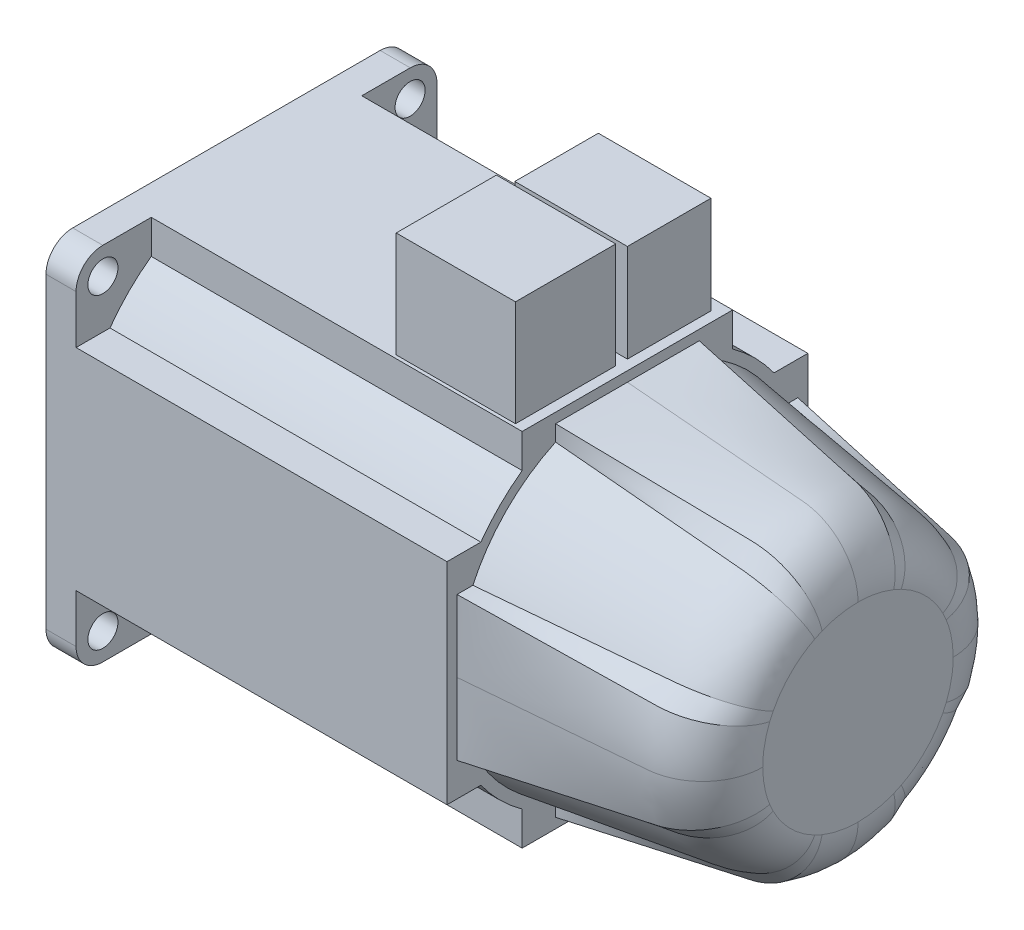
ISO-10303-21;
HEADER;
FILE_DESCRIPTION(('STEP AP214'),'2;1');
FILE_NAME('part.step','',(''),(''),'','','');
FILE_SCHEMA(('AUTOMOTIVE_DESIGN { 1 0 10303 214 1 1 1 1 }'));
ENDSEC;
DATA;
#1=APPLICATION_CONTEXT('core data for automotive mechanical design processes');
#2=APPLICATION_PROTOCOL_DEFINITION('international standard','automotive_design',2000,#1);
#3=PRODUCT_CONTEXT('',#1,'mechanical');
#4=PRODUCT('Part','Part','',(#3));
#5=PRODUCT_RELATED_PRODUCT_CATEGORY('part','',(#4));
#6=PRODUCT_DEFINITION_FORMATION('','',#4);
#7=PRODUCT_DEFINITION_CONTEXT('part definition',#1,'design');
#8=PRODUCT_DEFINITION('design','',#6,#7);
#9=PRODUCT_DEFINITION_SHAPE('','',#8);
#10=(LENGTH_UNIT() NAMED_UNIT(*) SI_UNIT(.MILLI.,.METRE.));
#11=(NAMED_UNIT(*) PLANE_ANGLE_UNIT() SI_UNIT($,.RADIAN.));
#12=(NAMED_UNIT(*) SI_UNIT($,.STERADIAN.) SOLID_ANGLE_UNIT());
#13=UNCERTAINTY_MEASURE_WITH_UNIT(LENGTH_MEASURE(1.E-05),#10,'distance_accuracy_value','');
#14=(GEOMETRIC_REPRESENTATION_CONTEXT(3) GLOBAL_UNCERTAINTY_ASSIGNED_CONTEXT((#13)) GLOBAL_UNIT_ASSIGNED_CONTEXT((#10,
#11,#12)) REPRESENTATION_CONTEXT('',''));
#15=CARTESIAN_POINT('',(0.,0.,0.));
#16=DIRECTION('',(0.,0.,1.));
#17=DIRECTION('',(1.,0.,0.));
#18=AXIS2_PLACEMENT_3D('',#15,#16,#17);
#19=CARTESIAN_POINT('',(9.,54.,46.));
#20=DIRECTION('',(0.,-1.,0.));
#21=DIRECTION('',(0.,0.,-1.));
#22=AXIS2_PLACEMENT_3D('',#19,#20,#21);
#23=PLANE('',#22);
#24=DIRECTION('',(0.,0.,-1.));
#25=VECTOR('',#24,1.);
#26=CARTESIAN_POINT('',(117.,54.,0.499999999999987));
#27=LINE('',#26,#25);
#28=CARTESIAN_POINT('',(117.,54.,30.5));
#29=VERTEX_POINT('',#28);
#30=CARTESIAN_POINT('',(117.,54.,0.499999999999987));
#31=VERTEX_POINT('',#30);
#32=EDGE_CURVE('E375',#29,#31,#27,.T.);
#33=ORIENTED_EDGE('',*,*,#32,.F.);
#34=DIRECTION('',(1.,0.,0.));
#35=VECTOR('',#34,1.);
#36=CARTESIAN_POINT('',(117.,54.,30.5));
#37=LINE('',#36,#35);
#38=CARTESIAN_POINT('',(81.3,54.,30.5));
#39=VERTEX_POINT('',#38);
#40=EDGE_CURVE('E384',#39,#29,#37,.T.);
#41=ORIENTED_EDGE('',*,*,#40,.F.);
#42=DIRECTION('',(0.,0.,1.));
#43=VECTOR('',#42,1.);
#44=CARTESIAN_POINT('',(81.3,54.,0.499999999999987));
#45=LINE('',#44,#43);
#46=CARTESIAN_POINT('',(81.3,54.,0.499999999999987));
#47=VERTEX_POINT('',#46);
#48=EDGE_CURVE('E381',#47,#39,#45,.T.);
#49=ORIENTED_EDGE('',*,*,#48,.F.);
#50=DIRECTION('',(-1.,0.,0.));
#51=VECTOR('',#50,1.);
#52=CARTESIAN_POINT('',(117.,54.,0.499999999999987));
#53=LINE('',#52,#51);
#54=EDGE_CURVE('E378',#31,#47,#53,.T.);
#55=ORIENTED_EDGE('',*,*,#54,.F.);
#56=EDGE_LOOP('',(#33,#41,#49,#55));
#57=FACE_BOUND('',#56,.T.);
#58=DIRECTION('',(0.,0.,1.));
#59=VECTOR('',#58,1.);
#60=CARTESIAN_POINT('',(0.,54.,46.));
#61=LINE('',#60,#59);
#62=CARTESIAN_POINT('',(0.,54.,-46.));
#63=VERTEX_POINT('',#62);
#64=CARTESIAN_POINT('',(0.,54.,46.));
#65=VERTEX_POINT('',#64);
#66=EDGE_CURVE('E822',#63,#65,#61,.T.);
#67=ORIENTED_EDGE('',*,*,#66,.T.);
#68=DIRECTION('',(-1.,0.,0.));
#69=VECTOR('',#68,1.);
#70=CARTESIAN_POINT('',(9.,54.,46.));
#71=LINE('',#70,#69);
#72=CARTESIAN_POINT('',(9.,54.,46.));
#73=VERTEX_POINT('',#72);
#74=EDGE_CURVE('E849',#73,#65,#71,.T.);
#75=ORIENTED_EDGE('',*,*,#74,.F.);
#76=DIRECTION('',(0.,0.,1.));
#77=VECTOR('',#76,1.);
#78=CARTESIAN_POINT('',(9.,54.,46.));
#79=LINE('',#78,#77);
#80=CARTESIAN_POINT('',(9.,54.,31.5));
#81=VERTEX_POINT('',#80);
#82=EDGE_CURVE('E845',#81,#73,#79,.T.);
#83=ORIENTED_EDGE('',*,*,#82,.F.);
#84=DIRECTION('',(-1.,0.,0.));
#85=VECTOR('',#84,1.);
#86=CARTESIAN_POINT('',(120.,54.,31.5));
#87=LINE('',#86,#85);
#88=CARTESIAN_POINT('',(120.,54.,31.5));
#89=VERTEX_POINT('',#88);
#90=EDGE_CURVE('E741',#89,#81,#87,.T.);
#91=ORIENTED_EDGE('',*,*,#90,.F.);
#92=DIRECTION('',(0.,0.,1.));
#93=VECTOR('',#92,1.);
#94=CARTESIAN_POINT('',(120.,54.,-31.5));
#95=LINE('',#94,#93);
#96=CARTESIAN_POINT('',(120.,54.,-31.5));
#97=VERTEX_POINT('',#96);
#98=EDGE_CURVE('E715',#97,#89,#95,.T.);
#99=ORIENTED_EDGE('',*,*,#98,.F.);
#100=DIRECTION('',(-1.,0.,0.));
#101=VECTOR('',#100,1.);
#102=CARTESIAN_POINT('',(120.,54.,-31.5));
#103=LINE('',#102,#101);
#104=CARTESIAN_POINT('',(9.,54.,-31.5));
#105=VERTEX_POINT('',#104);
#106=EDGE_CURVE('E743',#97,#105,#103,.T.);
#107=ORIENTED_EDGE('',*,*,#106,.T.);
#108=CARTESIAN_POINT('',(9.,54.,-46.));
#109=VERTEX_POINT('',#108);
#110=EDGE_CURVE('E846',#109,#105,#79,.T.);
#111=ORIENTED_EDGE('',*,*,#110,.F.);
#112=DIRECTION('',(-1.,0.,0.));
#113=VECTOR('',#112,1.);
#114=CARTESIAN_POINT('',(9.,54.,-46.));
#115=LINE('',#114,#113);
#116=EDGE_CURVE('E852',#109,#63,#115,.T.);
#117=ORIENTED_EDGE('',*,*,#116,.T.);
#118=EDGE_LOOP('',(#67,#75,#83,#91,#99,#107,#111,#117));
#119=FACE_BOUND('',#118,.T.);
#120=DIRECTION('',(-1.,0.,0.));
#121=VECTOR('',#120,1.);
#122=CARTESIAN_POINT('',(117.,54.,-28.));
#123=LINE('',#122,#121);
#124=CARTESIAN_POINT('',(117.,54.,-28.));
#125=VERTEX_POINT('',#124);
#126=CARTESIAN_POINT('',(83.3,54.,-28.));
#127=VERTEX_POINT('',#126);
#128=EDGE_CURVE('E343',#125,#127,#123,.T.);
#129=ORIENTED_EDGE('',*,*,#128,.F.);
#130=DIRECTION('',(0.,0.,-1.));
#131=VECTOR('',#130,1.);
#132=CARTESIAN_POINT('',(117.,54.,-28.));
#133=LINE('',#132,#131);
#134=CARTESIAN_POINT('',(117.,54.,-3.));
#135=VERTEX_POINT('',#134);
#136=EDGE_CURVE('E345',#135,#125,#133,.T.);
#137=ORIENTED_EDGE('',*,*,#136,.F.);
#138=DIRECTION('',(1.,0.,0.));
#139=VECTOR('',#138,1.);
#140=CARTESIAN_POINT('',(117.,54.,-3.));
#141=LINE('',#140,#139);
#142=CARTESIAN_POINT('',(83.3,54.,-3.));
#143=VERTEX_POINT('',#142);
#144=EDGE_CURVE('E38',#143,#135,#141,.T.);
#145=ORIENTED_EDGE('',*,*,#144,.F.);
#146=DIRECTION('',(0.,0.,1.));
#147=VECTOR('',#146,1.);
#148=CARTESIAN_POINT('',(83.3,54.,-28.));
#149=LINE('',#148,#147);
#150=EDGE_CURVE('E33',#127,#143,#149,.T.);
#151=ORIENTED_EDGE('',*,*,#150,.F.);
#152=EDGE_LOOP('',(#129,#137,#145,#151));
#153=FACE_BOUND('',#152,.T.);
#154=ADVANCED_FACE('F16',(#57,#119,#153),#23,.F.);
#155=CARTESIAN_POINT('',(0.,46.,46.));
#156=DIRECTION('',(1.,0.,0.));
#157=DIRECTION('',(0.,0.,-1.));
#158=AXIS2_PLACEMENT_3D('',#155,#156,#157);
#159=PLANE('',#158);
#160=CARTESIAN_POINT('',(0.,-45.9619407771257,45.9619407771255));
#161=DIRECTION('',(-1.,0.,0.));
#162=DIRECTION('',(0.,0.,1.));
#163=AXIS2_PLACEMENT_3D('',#160,#161,#162);
#164=CIRCLE('',#163,4.5);
#165=CARTESIAN_POINT('',(0.,-45.9619407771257,50.4619407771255));
#166=VERTEX_POINT('',#165);
#167=EDGE_CURVE('E408',#166,#166,#164,.T.);
#168=ORIENTED_EDGE('',*,*,#167,.F.);
#169=EDGE_LOOP('',(#168));
#170=FACE_BOUND('',#169,.T.);
#171=CARTESIAN_POINT('',(0.,45.9619407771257,45.9619407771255));
#172=DIRECTION('',(-1.,0.,0.));
#173=DIRECTION('',(0.,0.,1.));
#174=AXIS2_PLACEMENT_3D('',#171,#172,#173);
#175=CIRCLE('',#174,4.5);
#176=CARTESIAN_POINT('',(0.,45.9619407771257,50.4619407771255));
#177=VERTEX_POINT('',#176);
#178=EDGE_CURVE('E411',#177,#177,#175,.T.);
#179=ORIENTED_EDGE('',*,*,#178,.F.);
#180=EDGE_LOOP('',(#179));
#181=FACE_BOUND('',#180,.T.);
#182=CARTESIAN_POINT('',(0.,45.9619407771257,-45.9619407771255));
#183=DIRECTION('',(-1.,0.,0.));
#184=DIRECTION('',(0.,0.,1.));
#185=AXIS2_PLACEMENT_3D('',#182,#183,#184);
#186=CIRCLE('',#185,4.5);
#187=CARTESIAN_POINT('',(0.,45.9619407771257,-41.4619407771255));
#188=VERTEX_POINT('',#187);
#189=EDGE_CURVE('E415',#188,#188,#186,.T.);
#190=ORIENTED_EDGE('',*,*,#189,.F.);
#191=EDGE_LOOP('',(#190));
#192=FACE_BOUND('',#191,.T.);
#193=CARTESIAN_POINT('',(0.,-45.9619407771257,-45.9619407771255));
#194=DIRECTION('',(-1.,0.,0.));
#195=DIRECTION('',(0.,0.,1.));
#196=AXIS2_PLACEMENT_3D('',#193,#194,#195);
#197=CIRCLE('',#196,4.5);
#198=CARTESIAN_POINT('',(0.,-45.9619407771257,-41.4619407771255));
#199=VERTEX_POINT('',#198);
#200=EDGE_CURVE('E419',#199,#199,#197,.T.);
#201=ORIENTED_EDGE('',*,*,#200,.F.);
#202=EDGE_LOOP('',(#201));
#203=FACE_BOUND('',#202,.T.);
#204=CARTESIAN_POINT('',(0.,-46.,-46.));
#205=DIRECTION('',(1.,0.,0.));
#206=DIRECTION('',(0.,0.,-1.));
#207=AXIS2_PLACEMENT_3D('',#204,#205,#206);
#208=CIRCLE('',#207,8.);
#209=CARTESIAN_POINT('',(0.,-54.,-46.));
#210=VERTEX_POINT('',#209);
#211=CARTESIAN_POINT('',(0.,-46.,-54.));
#212=VERTEX_POINT('',#211);
#213=EDGE_CURVE('E816',#210,#212,#208,.T.);
#214=ORIENTED_EDGE('',*,*,#213,.F.);
#215=DIRECTION('',(0.,0.,-1.));
#216=VECTOR('',#215,1.);
#217=CARTESIAN_POINT('',(0.,-54.,46.));
#218=LINE('',#217,#216);
#219=CARTESIAN_POINT('',(0.,-54.,46.));
#220=VERTEX_POINT('',#219);
#221=EDGE_CURVE('E814',#220,#210,#218,.T.);
#222=ORIENTED_EDGE('',*,*,#221,.F.);
#223=CARTESIAN_POINT('',(0.,-46.,46.));
#224=DIRECTION('',(1.,0.,0.));
#225=DIRECTION('',(0.,0.,-1.));
#226=AXIS2_PLACEMENT_3D('',#223,#224,#225);
#227=CIRCLE('',#226,8.);
#228=CARTESIAN_POINT('',(0.,-46.,54.));
#229=VERTEX_POINT('',#228);
#230=EDGE_CURVE('E812',#229,#220,#227,.T.);
#231=ORIENTED_EDGE('',*,*,#230,.F.);
#232=DIRECTION('',(0.,-1.,0.));
#233=VECTOR('',#232,1.);
#234=CARTESIAN_POINT('',(0.,46.,54.));
#235=LINE('',#234,#233);
#236=CARTESIAN_POINT('',(0.,46.,54.));
#237=VERTEX_POINT('',#236);
#238=EDGE_CURVE('E810',#237,#229,#235,.T.);
#239=ORIENTED_EDGE('',*,*,#238,.F.);
#240=CARTESIAN_POINT('',(0.,46.,46.));
#241=DIRECTION('',(1.,0.,0.));
#242=DIRECTION('',(0.,0.,-1.));
#243=AXIS2_PLACEMENT_3D('',#240,#241,#242);
#244=CIRCLE('',#243,8.);
#245=EDGE_CURVE('E807',#65,#237,#244,.T.);
#246=ORIENTED_EDGE('',*,*,#245,.F.);
#247=ORIENTED_EDGE('',*,*,#66,.F.);
#248=CARTESIAN_POINT('',(0.,46.,-46.));
#249=DIRECTION('',(1.,0.,0.));
#250=DIRECTION('',(0.,0.,1.));
#251=AXIS2_PLACEMENT_3D('',#248,#249,#250);
#252=CIRCLE('',#251,8.);
#253=CARTESIAN_POINT('',(0.,46.,-54.));
#254=VERTEX_POINT('',#253);
#255=EDGE_CURVE('E820',#254,#63,#252,.T.);
#256=ORIENTED_EDGE('',*,*,#255,.F.);
#257=DIRECTION('',(0.,1.,0.));
#258=VECTOR('',#257,1.);
#259=CARTESIAN_POINT('',(0.,46.,-54.));
#260=LINE('',#259,#258);
#261=EDGE_CURVE('E818',#212,#254,#260,.T.);
#262=ORIENTED_EDGE('',*,*,#261,.F.);
#263=EDGE_LOOP('',(#214,#222,#231,#239,#246,#247,#256,#262));
#264=FACE_BOUND('',#263,.T.);
#265=CARTESIAN_POINT('',(0.,0.,0.));
#266=DIRECTION('',(1.,0.,0.));
#267=DIRECTION('',(0.,0.,-1.));
#268=AXIS2_PLACEMENT_3D('',#265,#266,#267);
#269=CIRCLE('',#268,40.);
#270=CARTESIAN_POINT('',(0.,0.,-40.));
#271=VERTEX_POINT('',#270);
#272=EDGE_CURVE('E11',#271,#271,#269,.F.);
#273=ORIENTED_EDGE('',*,*,#272,.F.);
#274=EDGE_LOOP('',(#273));
#275=FACE_BOUND('',#274,.T.);
#276=ADVANCED_FACE('F482',(#170,#181,#192,#203,#264,#275),#159,.F.);
#277=CARTESIAN_POINT('',(120.,0.,0.));
#278=DIRECTION('',(1.,0.,0.));
#279=DIRECTION('',(0.,0.,-1.));
#280=AXIS2_PLACEMENT_3D('',#277,#278,#279);
#281=PLANE('',#280);
#282=CARTESIAN_POINT('',(120.,0.,0.));
#283=DIRECTION('',(1.,0.,0.));
#284=DIRECTION('',(0.,0.,-1.));
#285=AXIS2_PLACEMENT_3D('',#282,#283,#284);
#286=CIRCLE('',#285,54.);
#287=CARTESIAN_POINT('',(120.,-31.5,43.8605745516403));
#288=VERTEX_POINT('',#287);
#289=CARTESIAN_POINT('',(120.,-43.8605745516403,31.5));
#290=VERTEX_POINT('',#289);
#291=EDGE_CURVE('E688',#288,#290,#286,.T.);
#292=ORIENTED_EDGE('',*,*,#291,.T.);
#293=DIRECTION('',(0.,-1.,0.));
#294=VECTOR('',#293,1.);
#295=CARTESIAN_POINT('',(120.,-43.8605745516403,31.5));
#296=LINE('',#295,#294);
#297=CARTESIAN_POINT('',(120.,-54.,31.5));
#298=VERTEX_POINT('',#297);
#299=EDGE_CURVE('E696',#290,#298,#296,.T.);
#300=ORIENTED_EDGE('',*,*,#299,.T.);
#301=DIRECTION('',(0.,0.,-1.));
#302=VECTOR('',#301,1.);
#303=CARTESIAN_POINT('',(120.,-54.,31.5));
#304=LINE('',#303,#302);
#305=CARTESIAN_POINT('',(120.,-54.,-31.5));
#306=VERTEX_POINT('',#305);
#307=EDGE_CURVE('E699',#298,#306,#304,.T.);
#308=ORIENTED_EDGE('',*,*,#307,.T.);
#309=DIRECTION('',(0.,1.,0.));
#310=VECTOR('',#309,1.);
#311=CARTESIAN_POINT('',(120.,-43.8605745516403,-31.5));
#312=LINE('',#311,#310);
#313=CARTESIAN_POINT('',(120.,-43.8605745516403,-31.5));
#314=VERTEX_POINT('',#313);
#315=EDGE_CURVE('E701',#306,#314,#312,.T.);
#316=ORIENTED_EDGE('',*,*,#315,.T.);
#317=CARTESIAN_POINT('',(120.,0.,0.));
#318=DIRECTION('',(1.,0.,0.));
#319=DIRECTION('',(0.,0.,-1.));
#320=AXIS2_PLACEMENT_3D('',#317,#318,#319);
#321=CIRCLE('',#320,54.);
#322=CARTESIAN_POINT('',(120.,-31.5,-43.8605745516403));
#323=VERTEX_POINT('',#322);
#324=EDGE_CURVE('E703',#314,#323,#321,.T.);
#325=ORIENTED_EDGE('',*,*,#324,.T.);
#326=DIRECTION('',(0.,0.,-1.));
#327=VECTOR('',#326,1.);
#328=CARTESIAN_POINT('',(120.,-31.5,-43.8605745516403));
#329=LINE('',#328,#327);
#330=CARTESIAN_POINT('',(120.,-31.5,-54.));
#331=VERTEX_POINT('',#330);
#332=EDGE_CURVE('E705',#323,#331,#329,.T.);
#333=ORIENTED_EDGE('',*,*,#332,.T.);
#334=DIRECTION('',(0.,1.,0.));
#335=VECTOR('',#334,1.);
#336=CARTESIAN_POINT('',(120.,-31.5,-54.));
#337=LINE('',#336,#335);
#338=CARTESIAN_POINT('',(120.,31.5,-54.));
#339=VERTEX_POINT('',#338);
#340=EDGE_CURVE('E707',#331,#339,#337,.T.);
#341=ORIENTED_EDGE('',*,*,#340,.T.);
#342=DIRECTION('',(0.,0.,1.));
#343=VECTOR('',#342,1.);
#344=CARTESIAN_POINT('',(120.,31.5,-43.8605745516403));
#345=LINE('',#344,#343);
#346=CARTESIAN_POINT('',(120.,31.5,-43.8605745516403));
#347=VERTEX_POINT('',#346);
#348=EDGE_CURVE('E709',#339,#347,#345,.T.);
#349=ORIENTED_EDGE('',*,*,#348,.T.);
#350=CARTESIAN_POINT('',(120.,0.,0.));
#351=DIRECTION('',(1.,0.,0.));
#352=DIRECTION('',(0.,0.,-1.));
#353=AXIS2_PLACEMENT_3D('',#350,#351,#352);
#354=CIRCLE('',#353,54.);
#355=CARTESIAN_POINT('',(120.,43.8605745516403,-31.5));
#356=VERTEX_POINT('',#355);
#357=EDGE_CURVE('E711',#347,#356,#354,.T.);
#358=ORIENTED_EDGE('',*,*,#357,.T.);
#359=DIRECTION('',(0.,1.,0.));
#360=VECTOR('',#359,1.);
#361=CARTESIAN_POINT('',(120.,43.8605745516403,-31.5));
#362=LINE('',#361,#360);
#363=EDGE_CURVE('E713',#356,#97,#362,.T.);
#364=ORIENTED_EDGE('',*,*,#363,.T.);
#365=ORIENTED_EDGE('',*,*,#98,.T.);
#366=DIRECTION('',(0.,-1.,0.));
#367=VECTOR('',#366,1.);
#368=CARTESIAN_POINT('',(120.,43.8605745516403,31.5));
#369=LINE('',#368,#367);
#370=CARTESIAN_POINT('',(120.,43.8605745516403,31.5));
#371=VERTEX_POINT('',#370);
#372=EDGE_CURVE('E717',#89,#371,#369,.T.);
#373=ORIENTED_EDGE('',*,*,#372,.T.);
#374=CARTESIAN_POINT('',(120.,0.,0.));
#375=DIRECTION('',(1.,0.,0.));
#376=DIRECTION('',(0.,0.,-1.));
#377=AXIS2_PLACEMENT_3D('',#374,#375,#376);
#378=CIRCLE('',#377,54.);
#379=CARTESIAN_POINT('',(120.,31.5,43.8605745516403));
#380=VERTEX_POINT('',#379);
#381=EDGE_CURVE('E719',#371,#380,#378,.T.);
#382=ORIENTED_EDGE('',*,*,#381,.T.);
#383=DIRECTION('',(0.,0.,1.));
#384=VECTOR('',#383,1.);
#385=CARTESIAN_POINT('',(120.,31.5,54.));
#386=LINE('',#385,#384);
#387=CARTESIAN_POINT('',(120.,31.5,54.));
#388=VERTEX_POINT('',#387);
#389=EDGE_CURVE('E721',#380,#388,#386,.T.);
#390=ORIENTED_EDGE('',*,*,#389,.T.);
#391=DIRECTION('',(0.,-1.,0.));
#392=VECTOR('',#391,1.);
#393=CARTESIAN_POINT('',(120.,31.5,54.));
#394=LINE('',#393,#392);
#395=CARTESIAN_POINT('',(120.,-31.5,54.));
#396=VERTEX_POINT('',#395);
#397=EDGE_CURVE('E723',#388,#396,#394,.T.);
#398=ORIENTED_EDGE('',*,*,#397,.T.);
#399=DIRECTION('',(0.,0.,-1.));
#400=VECTOR('',#399,1.);
#401=CARTESIAN_POINT('',(120.,-31.5,54.));
#402=LINE('',#401,#400);
#403=EDGE_CURVE('E725',#396,#288,#402,.T.);
#404=ORIENTED_EDGE('',*,*,#403,.T.);
#405=EDGE_LOOP('',(#292,#300,#308,#316,#325,#333,#341,#349,#358,#364,#365,#373,#382,#390,#398,#404));
#406=FACE_BOUND('',#405,.T.);
#407=DIRECTION('',(0.,1.,0.));
#408=VECTOR('',#407,1.);
#409=CARTESIAN_POINT('',(120.,0.,-21.5));
#410=LINE('',#409,#408);
#411=CARTESIAN_POINT('',(120.,46.2466214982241,-21.5));
#412=VERTEX_POINT('',#411);
#413=CARTESIAN_POINT('',(120.,51.,-21.5));
#414=VERTEX_POINT('',#413);
#415=EDGE_CURVE('E652',#412,#414,#410,.T.);
#416=ORIENTED_EDGE('',*,*,#415,.F.);
#417=CARTESIAN_POINT('',(120.,21.5,-46.2466214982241));
#418=CARTESIAN_POINT('',(120.,22.368162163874,-45.8430542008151));
#419=CARTESIAN_POINT('',(120.,23.2249365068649,-45.4149951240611));
#420=CARTESIAN_POINT('',(120.,24.9133072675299,-44.5112135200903));
#421=CARTESIAN_POINT('',(120.,25.744895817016,-44.0354762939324));
#422=CARTESIAN_POINT('',(120.,27.3800837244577,-43.0378298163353));
#423=CARTESIAN_POINT('',(120.,28.1836785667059,-42.515913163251));
#424=CARTESIAN_POINT('',(120.,29.7572005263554,-41.4297126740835));
#425=CARTESIAN_POINT('',(120.,30.5272439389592,-40.8655973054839));
#426=CARTESIAN_POINT('',(120.,32.0343154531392,-39.6951769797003));
#427=CARTESIAN_POINT('',(120.,32.7713501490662,-39.0888805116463));
#428=CARTESIAN_POINT('',(120.,34.2100000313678,-37.8361357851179));
#429=CARTESIAN_POINT('',(120.,34.9116287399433,-37.1897030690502));
#430=CARTESIAN_POINT('',(120.,36.1381492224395,-35.9943923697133));
#431=CARTESIAN_POINT('',(120.,36.6698922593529,-35.4525213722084));
#432=CARTESIAN_POINT('',(120.,37.7085970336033,-34.3456730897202));
#433=CARTESIAN_POINT('',(120.,38.2155627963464,-33.7806995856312));
#434=CARTESIAN_POINT('',(120.,39.2035976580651,-32.6289093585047));
#435=CARTESIAN_POINT('',(120.,39.6846761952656,-32.0421007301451));
#436=CARTESIAN_POINT('',(120.,40.620199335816,-30.8475794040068));
#437=CARTESIAN_POINT('',(120.,41.0746426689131,-30.2398657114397));
#438=CARTESIAN_POINT('',(120.,41.9707843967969,-28.9839896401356));
#439=CARTESIAN_POINT('',(120.,42.4115400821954,-28.3351542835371));
#440=CARTESIAN_POINT('',(120.,43.2626518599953,-27.0178472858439));
#441=CARTESIAN_POINT('',(120.,43.6730080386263,-26.3493757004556));
#442=CARTESIAN_POINT('',(120.,44.4627125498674,-24.9937558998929));
#443=CARTESIAN_POINT('',(120.,44.8420397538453,-24.306595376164));
#444=CARTESIAN_POINT('',(120.,45.5685986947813,-22.9155043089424));
#445=CARTESIAN_POINT('',(120.,45.9158301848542,-22.2115736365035));
#446=CARTESIAN_POINT('',(120.,46.2466214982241,-21.5));
#447=B_SPLINE_CURVE_WITH_KNOTS('',3,(#417,#418,#419,#420,#421,#422,#423,#424,#425,#426,#427,
#428,#429,#430,#431,#432,#433,#434,#435,#436,#437,#438,#439,#440,#441,#442,#443,#444,#445,#446),
.UNSPECIFIED.,.F.,.F.,(4,2,2,2,2,2,2,2,2,2,2,2,2,2,4),(0.,2.87175098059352,5.74439004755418,
8.61749037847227,11.479676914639,14.3412890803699,17.2017999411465,19.4786597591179,
21.7551484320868,24.0308014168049,26.3065628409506,28.6588650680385,31.0111606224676,
33.3650448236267,35.7189471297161),.UNSPECIFIED.);
#448=CARTESIAN_POINT('',(120.,21.5,-46.2466214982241));
#449=VERTEX_POINT('',#448);
#450=EDGE_CURVE('E488',#449,#412,#447,.T.);
#451=ORIENTED_EDGE('',*,*,#450,.F.);
#452=DIRECTION('',(0.,0.,-1.));
#453=VECTOR('',#452,1.);
#454=CARTESIAN_POINT('',(120.,21.5,0.));
#455=LINE('',#454,#453);
#456=CARTESIAN_POINT('',(120.,21.5,-51.));
#457=VERTEX_POINT('',#456);
#458=EDGE_CURVE('E1910',#457,#449,#455,.F.);
#459=ORIENTED_EDGE('',*,*,#458,.F.);
#460=DIRECTION('',(0.,1.,0.));
#461=VECTOR('',#460,1.);
#462=CARTESIAN_POINT('',(120.,0.,-51.));
#463=LINE('',#462,#461);
#464=CARTESIAN_POINT('',(120.,0.,-51.));
#465=VERTEX_POINT('',#464);
#466=EDGE_CURVE('E1906',#465,#457,#463,.T.);
#467=ORIENTED_EDGE('',*,*,#466,.F.);
#468=DIRECTION('',(0.,1.,0.));
#469=VECTOR('',#468,1.);
#470=CARTESIAN_POINT('',(120.,0.,-51.));
#471=LINE('',#470,#469);
#472=CARTESIAN_POINT('',(120.,-21.5,-51.));
#473=VERTEX_POINT('',#472);
#474=EDGE_CURVE('E1892',#473,#465,#471,.T.);
#475=ORIENTED_EDGE('',*,*,#474,.F.);
#476=DIRECTION('',(0.,0.,-1.));
#477=VECTOR('',#476,1.);
#478=CARTESIAN_POINT('',(120.,-21.5,0.));
#479=LINE('',#478,#477);
#480=CARTESIAN_POINT('',(120.,-21.5,-46.2466214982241));
#481=VERTEX_POINT('',#480);
#482=EDGE_CURVE('E1885',#481,#473,#479,.T.);
#483=ORIENTED_EDGE('',*,*,#482,.F.);
#484=CARTESIAN_POINT('',(120.,-46.2466214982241,-21.5));
#485=CARTESIAN_POINT('',(120.,-45.8430542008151,-22.368162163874));
#486=CARTESIAN_POINT('',(120.,-45.4149951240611,-23.2249365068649));
#487=CARTESIAN_POINT('',(120.,-44.5112135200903,-24.9133072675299));
#488=CARTESIAN_POINT('',(120.,-44.0354762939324,-25.744895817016));
#489=CARTESIAN_POINT('',(120.,-43.0378298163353,-27.3800837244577));
#490=CARTESIAN_POINT('',(120.,-42.515913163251,-28.1836785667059));
#491=CARTESIAN_POINT('',(120.,-41.4297126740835,-29.7572005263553));
#492=CARTESIAN_POINT('',(120.,-40.8655973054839,-30.5272439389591));
#493=CARTESIAN_POINT('',(120.,-39.6951769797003,-32.0343154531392));
#494=CARTESIAN_POINT('',(120.,-39.0888805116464,-32.7713501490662));
#495=CARTESIAN_POINT('',(120.,-37.836135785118,-34.2100000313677));
#496=CARTESIAN_POINT('',(120.,-37.1897030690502,-34.9116287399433));
#497=CARTESIAN_POINT('',(120.,-35.9943923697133,-36.1381492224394));
#498=CARTESIAN_POINT('',(120.,-35.4525213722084,-36.6698922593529));
#499=CARTESIAN_POINT('',(120.,-34.3456730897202,-37.7085970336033));
#500=CARTESIAN_POINT('',(120.,-33.7806995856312,-38.2155627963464));
#501=CARTESIAN_POINT('',(120.,-32.6289093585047,-39.203597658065));
#502=CARTESIAN_POINT('',(120.,-32.0421007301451,-39.6846761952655));
#503=CARTESIAN_POINT('',(120.,-30.8475794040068,-40.620199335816));
#504=CARTESIAN_POINT('',(120.,-30.2398657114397,-41.0746426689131));
#505=CARTESIAN_POINT('',(120.,-28.9839896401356,-41.9707843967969));
#506=CARTESIAN_POINT('',(120.,-28.3351542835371,-42.4115400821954));
#507=CARTESIAN_POINT('',(120.,-27.0178472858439,-43.2626518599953));
#508=CARTESIAN_POINT('',(120.,-26.3493757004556,-43.6730080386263));
#509=CARTESIAN_POINT('',(120.,-24.9937558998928,-44.4627125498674));
#510=CARTESIAN_POINT('',(120.,-24.306595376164,-44.8420397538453));
#511=CARTESIAN_POINT('',(120.,-22.9155043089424,-45.5685986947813));
#512=CARTESIAN_POINT('',(120.,-22.2115736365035,-45.9158301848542));
#513=CARTESIAN_POINT('',(120.,-21.5,-46.2466214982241));
#514=B_SPLINE_CURVE_WITH_KNOTS('',3,(#484,#485,#486,#487,#488,#489,#490,#491,#492,#493,#494,
#495,#496,#497,#498,#499,#500,#501,#502,#503,#504,#505,#506,#507,#508,#509,#510,#511,#512,#513),
.UNSPECIFIED.,.F.,.F.,(4,2,2,2,2,2,2,2,2,2,2,2,2,2,4),(0.,2.87175098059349,5.74439004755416,
8.61749037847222,11.479676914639,14.3412890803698,17.2017999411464,19.4786597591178,
21.7551484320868,24.0308014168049,26.3065628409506,28.6588650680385,31.0111606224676,
33.3650448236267,35.7189471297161),.UNSPECIFIED.);
#515=CARTESIAN_POINT('',(120.,-46.2466214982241,-21.5));
#516=VERTEX_POINT('',#515);
#517=EDGE_CURVE('E498',#516,#481,#514,.T.);
#518=ORIENTED_EDGE('',*,*,#517,.F.);
#519=DIRECTION('',(0.,1.,0.));
#520=VECTOR('',#519,1.);
#521=CARTESIAN_POINT('',(120.,0.,-21.5));
#522=LINE('',#521,#520);
#523=CARTESIAN_POINT('',(120.,-51.,-21.5));
#524=VERTEX_POINT('',#523);
#525=EDGE_CURVE('E1789',#524,#516,#522,.T.);
#526=ORIENTED_EDGE('',*,*,#525,.F.);
#527=DIRECTION('',(0.,0.,-1.));
#528=VECTOR('',#527,1.);
#529=CARTESIAN_POINT('',(120.,-51.,0.));
#530=LINE('',#529,#528);
#531=CARTESIAN_POINT('',(120.,-51.,0.));
#532=VERTEX_POINT('',#531);
#533=EDGE_CURVE('E1773',#532,#524,#530,.T.);
#534=ORIENTED_EDGE('',*,*,#533,.F.);
#535=DIRECTION('',(0.,0.,-1.));
#536=VECTOR('',#535,1.);
#537=CARTESIAN_POINT('',(120.,-51.,0.));
#538=LINE('',#537,#536);
#539=CARTESIAN_POINT('',(120.,-51.,21.5));
#540=VERTEX_POINT('',#539);
#541=EDGE_CURVE('E1757',#540,#532,#538,.T.);
#542=ORIENTED_EDGE('',*,*,#541,.F.);
#543=DIRECTION('',(0.,1.,0.));
#544=VECTOR('',#543,1.);
#545=CARTESIAN_POINT('',(120.,0.,21.5));
#546=LINE('',#545,#544);
#547=CARTESIAN_POINT('',(120.,-46.2466214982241,21.5));
#548=VERTEX_POINT('',#547);
#549=EDGE_CURVE('E516',#548,#540,#546,.F.);
#550=ORIENTED_EDGE('',*,*,#549,.F.);
#551=CARTESIAN_POINT('',(120.,-21.5,46.2466214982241));
#552=CARTESIAN_POINT('',(120.,-22.368162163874,45.8430542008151));
#553=CARTESIAN_POINT('',(120.,-23.2249365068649,45.4149951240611));
#554=CARTESIAN_POINT('',(120.,-24.9133072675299,44.5112135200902));
#555=CARTESIAN_POINT('',(120.,-25.744895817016,44.0354762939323));
#556=CARTESIAN_POINT('',(120.,-27.3800837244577,43.0378298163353));
#557=CARTESIAN_POINT('',(120.,-28.1836785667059,42.515913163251));
#558=CARTESIAN_POINT('',(120.,-29.7572005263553,41.4297126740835));
#559=CARTESIAN_POINT('',(120.,-30.5272439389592,40.8655973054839));
#560=CARTESIAN_POINT('',(120.,-32.0343154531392,39.6951769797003));
#561=CARTESIAN_POINT('',(120.,-32.7713501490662,39.0888805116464));
#562=CARTESIAN_POINT('',(120.,-34.2100000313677,37.836135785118));
#563=CARTESIAN_POINT('',(120.,-34.9116287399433,37.1897030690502));
#564=CARTESIAN_POINT('',(120.,-36.1381492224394,35.9943923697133));
#565=CARTESIAN_POINT('',(120.,-36.6698922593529,35.4525213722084));
#566=CARTESIAN_POINT('',(120.,-37.7085970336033,34.3456730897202));
#567=CARTESIAN_POINT('',(120.,-38.2155627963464,33.7806995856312));
#568=CARTESIAN_POINT('',(120.,-39.2035976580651,32.6289093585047));
#569=CARTESIAN_POINT('',(120.,-39.6846761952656,32.0421007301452));
#570=CARTESIAN_POINT('',(120.,-40.620199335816,30.8475794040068));
#571=CARTESIAN_POINT('',(120.,-41.0746426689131,30.2398657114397));
#572=CARTESIAN_POINT('',(120.,-41.9707843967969,28.9839896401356));
#573=CARTESIAN_POINT('',(120.,-42.4115400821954,28.3351542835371));
#574=CARTESIAN_POINT('',(120.,-43.2626518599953,27.0178472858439));
#575=CARTESIAN_POINT('',(120.,-43.6730080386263,26.3493757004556));
#576=CARTESIAN_POINT('',(120.,-44.4627125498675,24.9937558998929));
#577=CARTESIAN_POINT('',(120.,-44.8420397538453,24.306595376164));
#578=CARTESIAN_POINT('',(120.,-45.5685986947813,22.9155043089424));
#579=CARTESIAN_POINT('',(120.,-45.9158301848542,22.2115736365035));
#580=CARTESIAN_POINT('',(120.,-46.2466214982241,21.5));
#581=B_SPLINE_CURVE_WITH_KNOTS('',3,(#551,#552,#553,#554,#555,#556,#557,#558,#559,#560,#561,
#562,#563,#564,#565,#566,#567,#568,#569,#570,#571,#572,#573,#574,#575,#576,#577,#578,#579,#580),
.UNSPECIFIED.,.F.,.F.,(4,2,2,2,2,2,2,2,2,2,2,2,2,2,4),(0.,2.87175098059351,5.74439004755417,
8.61749037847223,11.479676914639,14.3412890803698,17.2017999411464,19.4786597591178,
21.7551484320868,24.0308014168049,26.3065628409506,28.6588650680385,31.0111606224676,
33.3650448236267,35.7189471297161),.UNSPECIFIED.);
#582=CARTESIAN_POINT('',(120.,-21.5,46.2466214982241));
#583=VERTEX_POINT('',#582);
#584=EDGE_CURVE('E506',#583,#548,#581,.T.);
#585=ORIENTED_EDGE('',*,*,#584,.F.);
#586=DIRECTION('',(0.,0.,-1.));
#587=VECTOR('',#586,1.);
#588=CARTESIAN_POINT('',(120.,-21.5,0.));
#589=LINE('',#588,#587);
#590=CARTESIAN_POINT('',(120.,-21.5,51.));
#591=VERTEX_POINT('',#590);
#592=EDGE_CURVE('E518',#591,#583,#589,.T.);
#593=ORIENTED_EDGE('',*,*,#592,.F.);
#594=DIRECTION('',(0.,1.,0.));
#595=VECTOR('',#594,1.);
#596=CARTESIAN_POINT('',(120.,0.,51.));
#597=LINE('',#596,#595);
#598=CARTESIAN_POINT('',(120.,0.,51.));
#599=VERTEX_POINT('',#598);
#600=EDGE_CURVE('E1679',#599,#591,#597,.F.);
#601=ORIENTED_EDGE('',*,*,#600,.F.);
#602=DIRECTION('',(0.,1.,0.));
#603=VECTOR('',#602,1.);
#604=CARTESIAN_POINT('',(120.,0.,51.));
#605=LINE('',#604,#603);
#606=CARTESIAN_POINT('',(120.,21.5,51.));
#607=VERTEX_POINT('',#606);
#608=EDGE_CURVE('E1690',#607,#599,#605,.F.);
#609=ORIENTED_EDGE('',*,*,#608,.F.);
#610=DIRECTION('',(0.,0.,-1.));
#611=VECTOR('',#610,1.);
#612=CARTESIAN_POINT('',(120.,21.5,0.));
#613=LINE('',#612,#611);
#614=CARTESIAN_POINT('',(120.,21.5,46.2466214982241));
#615=VERTEX_POINT('',#614);
#616=EDGE_CURVE('E1632',#615,#607,#613,.F.);
#617=ORIENTED_EDGE('',*,*,#616,.F.);
#618=CARTESIAN_POINT('',(120.,46.2466214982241,21.5));
#619=CARTESIAN_POINT('',(120.,45.8430542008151,22.368162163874));
#620=CARTESIAN_POINT('',(120.,45.4149951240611,23.2249365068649));
#621=CARTESIAN_POINT('',(120.,44.5112135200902,24.9133072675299));
#622=CARTESIAN_POINT('',(120.,44.0354762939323,25.744895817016));
#623=CARTESIAN_POINT('',(120.,43.0378298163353,27.3800837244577));
#624=CARTESIAN_POINT('',(120.,42.515913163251,28.1836785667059));
#625=CARTESIAN_POINT('',(120.,41.4297126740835,29.7572005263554));
#626=CARTESIAN_POINT('',(120.,40.8655973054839,30.5272439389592));
#627=CARTESIAN_POINT('',(120.,39.6951769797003,32.0343154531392));
#628=CARTESIAN_POINT('',(120.,39.0888805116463,32.7713501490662));
#629=CARTESIAN_POINT('',(120.,37.8361357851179,34.2100000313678));
#630=CARTESIAN_POINT('',(120.,37.1897030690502,34.9116287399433));
#631=CARTESIAN_POINT('',(120.,35.9943923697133,36.1381492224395));
#632=CARTESIAN_POINT('',(120.,35.4525213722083,36.6698922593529));
#633=CARTESIAN_POINT('',(120.,34.3456730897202,37.7085970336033));
#634=CARTESIAN_POINT('',(120.,33.7806995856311,38.2155627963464));
#635=CARTESIAN_POINT('',(120.,32.6289093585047,39.2035976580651));
#636=CARTESIAN_POINT('',(120.,32.0421007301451,39.6846761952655));
#637=CARTESIAN_POINT('',(120.,30.8475794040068,40.6201993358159));
#638=CARTESIAN_POINT('',(120.,30.2398657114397,41.0746426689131));
#639=CARTESIAN_POINT('',(120.,28.9839896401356,41.9707843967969));
#640=CARTESIAN_POINT('',(120.,28.3351542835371,42.4115400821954));
#641=CARTESIAN_POINT('',(120.,27.0178472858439,43.2626518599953));
#642=CARTESIAN_POINT('',(120.,26.3493757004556,43.6730080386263));
#643=CARTESIAN_POINT('',(120.,24.9937558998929,44.4627125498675));
#644=CARTESIAN_POINT('',(120.,24.306595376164,44.8420397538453));
#645=CARTESIAN_POINT('',(120.,22.9155043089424,45.5685986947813));
#646=CARTESIAN_POINT('',(120.,22.2115736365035,45.9158301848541));
#647=CARTESIAN_POINT('',(120.,21.5,46.2466214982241));
#648=B_SPLINE_CURVE_WITH_KNOTS('',3,(#618,#619,#620,#621,#622,#623,#624,#625,#626,#627,#628,
#629,#630,#631,#632,#633,#634,#635,#636,#637,#638,#639,#640,#641,#642,#643,#644,#645,#646,#647),
.UNSPECIFIED.,.F.,.F.,(4,2,2,2,2,2,2,2,2,2,2,2,2,2,4),(0.,2.87175098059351,5.74439004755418,
8.61749037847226,11.479676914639,14.3412890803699,17.2017999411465,19.4786597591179,
21.7551484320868,24.0308014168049,26.3065628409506,28.6588650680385,31.0111606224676,
33.3650448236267,35.7189471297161),.UNSPECIFIED.);
#649=CARTESIAN_POINT('',(120.,46.2466214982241,21.5));
#650=VERTEX_POINT('',#649);
#651=EDGE_CURVE('E677',#650,#615,#648,.T.);
#652=ORIENTED_EDGE('',*,*,#651,.F.);
#653=DIRECTION('',(0.,1.,0.));
#654=VECTOR('',#653,1.);
#655=CARTESIAN_POINT('',(120.,0.,21.5));
#656=LINE('',#655,#654);
#657=CARTESIAN_POINT('',(120.,51.,21.5));
#658=VERTEX_POINT('',#657);
#659=EDGE_CURVE('E877',#658,#650,#656,.F.);
#660=ORIENTED_EDGE('',*,*,#659,.F.);
#661=DIRECTION('',(0.,0.,-1.));
#662=VECTOR('',#661,1.);
#663=CARTESIAN_POINT('',(120.,51.,0.));
#664=LINE('',#663,#662);
#665=CARTESIAN_POINT('',(120.,51.,0.));
#666=VERTEX_POINT('',#665);
#667=EDGE_CURVE('E697',#666,#658,#664,.F.);
#668=ORIENTED_EDGE('',*,*,#667,.F.);
#669=DIRECTION('',(0.,0.,-1.));
#670=VECTOR('',#669,1.);
#671=CARTESIAN_POINT('',(120.,51.,0.));
#672=LINE('',#671,#670);
#673=EDGE_CURVE('E676',#414,#666,#672,.F.);
#674=ORIENTED_EDGE('',*,*,#673,.F.);
#675=EDGE_LOOP('',(#416,#451,#459,#467,#475,#483,#518,#526,#534,#542,#550,#585,#593,#601,#609,
#617,#652,#660,#668,#674));
#676=FACE_BOUND('',#675,.T.);
#677=ADVANCED_FACE('F472',(#406,#676),#281,.T.);
#678=CARTESIAN_POINT('',(9.,46.,46.));
#679=DIRECTION('',(1.,0.,0.));
#680=DIRECTION('',(0.,0.,-1.));
#681=AXIS2_PLACEMENT_3D('',#678,#679,#680);
#682=PLANE('',#681);
#683=CARTESIAN_POINT('',(9.,-45.9619407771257,-45.9619407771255));
#684=DIRECTION('',(1.,0.,0.));
#685=DIRECTION('',(0.,0.,-1.));
#686=AXIS2_PLACEMENT_3D('',#683,#684,#685);
#687=CIRCLE('',#686,4.5);
#688=CARTESIAN_POINT('',(9.,-45.9619407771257,-50.4619407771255));
#689=VERTEX_POINT('',#688);
#690=EDGE_CURVE('E422',#689,#689,#687,.T.);
#691=ORIENTED_EDGE('',*,*,#690,.F.);
#692=EDGE_LOOP('',(#691));
#693=FACE_BOUND('',#692,.T.);
#694=CARTESIAN_POINT('',(9.,0.,0.));
#695=DIRECTION('',(1.,0.,0.));
#696=DIRECTION('',(0.,0.,-1.));
#697=AXIS2_PLACEMENT_3D('',#694,#695,#696);
#698=CIRCLE('',#697,54.);
#699=CARTESIAN_POINT('',(9.,-31.5,-43.8605745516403));
#700=VERTEX_POINT('',#699);
#701=CARTESIAN_POINT('',(9.,-43.8605745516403,-31.5));
#702=VERTEX_POINT('',#701);
#703=EDGE_CURVE('E795',#700,#702,#698,.F.);
#704=ORIENTED_EDGE('',*,*,#703,.T.);
#705=DIRECTION('',(0.,-1.,0.));
#706=VECTOR('',#705,1.);
#707=CARTESIAN_POINT('',(9.,46.,-31.5));
#708=LINE('',#707,#706);
#709=CARTESIAN_POINT('',(9.,-54.,-31.5));
#710=VERTEX_POINT('',#709);
#711=EDGE_CURVE('E798',#702,#710,#708,.T.);
#712=ORIENTED_EDGE('',*,*,#711,.T.);
#713=DIRECTION('',(0.,0.,-1.));
#714=VECTOR('',#713,1.);
#715=CARTESIAN_POINT('',(9.,-54.,46.));
#716=LINE('',#715,#714);
#717=CARTESIAN_POINT('',(9.,-54.,-46.));
#718=VERTEX_POINT('',#717);
#719=EDGE_CURVE('E833',#710,#718,#716,.T.);
#720=ORIENTED_EDGE('',*,*,#719,.T.);
#721=CARTESIAN_POINT('',(9.,-46.,-46.));
#722=DIRECTION('',(1.,0.,0.));
#723=DIRECTION('',(0.,0.,-1.));
#724=AXIS2_PLACEMENT_3D('',#721,#722,#723);
#725=CIRCLE('',#724,8.);
#726=CARTESIAN_POINT('',(9.,-46.,-54.));
#727=VERTEX_POINT('',#726);
#728=EDGE_CURVE('E837',#718,#727,#725,.T.);
#729=ORIENTED_EDGE('',*,*,#728,.T.);
#730=DIRECTION('',(0.,1.,0.));
#731=VECTOR('',#730,1.);
#732=CARTESIAN_POINT('',(9.,46.,-54.));
#733=LINE('',#732,#731);
#734=CARTESIAN_POINT('',(9.,-31.5,-54.));
#735=VERTEX_POINT('',#734);
#736=EDGE_CURVE('E840',#727,#735,#733,.T.);
#737=ORIENTED_EDGE('',*,*,#736,.T.);
#738=DIRECTION('',(0.,0.,1.));
#739=VECTOR('',#738,1.);
#740=CARTESIAN_POINT('',(9.,-31.5,46.));
#741=LINE('',#740,#739);
#742=EDGE_CURVE('E792',#735,#700,#741,.T.);
#743=ORIENTED_EDGE('',*,*,#742,.T.);
#744=EDGE_LOOP('',(#704,#712,#720,#729,#737,#743));
#745=FACE_BOUND('',#744,.T.);
#746=ADVANCED_FACE('F481',(#693,#745),#682,.T.);
#747=CARTESIAN_POINT('',(9.,45.9619407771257,-45.9619407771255));
#748=DIRECTION('',(1.,0.,0.));
#749=DIRECTION('',(0.,0.,-1.));
#750=AXIS2_PLACEMENT_3D('',#747,#748,#749);
#751=CIRCLE('',#750,4.5);
#752=CARTESIAN_POINT('',(9.,45.9619407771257,-50.4619407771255));
#753=VERTEX_POINT('',#752);
#754=EDGE_CURVE('E418',#753,#753,#751,.T.);
#755=ORIENTED_EDGE('',*,*,#754,.F.);
#756=EDGE_LOOP('',(#755));
#757=FACE_BOUND('',#756,.T.);
#758=CARTESIAN_POINT('',(9.,0.,0.));
#759=DIRECTION('',(1.,0.,0.));
#760=DIRECTION('',(0.,0.,-1.));
#761=AXIS2_PLACEMENT_3D('',#758,#759,#760);
#762=CIRCLE('',#761,54.);
#763=CARTESIAN_POINT('',(9.,43.8605745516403,-31.5));
#764=VERTEX_POINT('',#763);
#765=CARTESIAN_POINT('',(9.,31.5,-43.8605745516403));
#766=VERTEX_POINT('',#765);
#767=EDGE_CURVE('E786',#764,#766,#762,.F.);
#768=ORIENTED_EDGE('',*,*,#767,.T.);
#769=DIRECTION('',(0.,0.,-1.));
#770=VECTOR('',#769,1.);
#771=CARTESIAN_POINT('',(9.,31.5,46.));
#772=LINE('',#771,#770);
#773=CARTESIAN_POINT('',(9.,31.5,-54.));
#774=VERTEX_POINT('',#773);
#775=EDGE_CURVE('E789',#766,#774,#772,.T.);
#776=ORIENTED_EDGE('',*,*,#775,.T.);
#777=CARTESIAN_POINT('',(9.,46.,-54.));
#778=VERTEX_POINT('',#777);
#779=EDGE_CURVE('E839',#774,#778,#733,.T.);
#780=ORIENTED_EDGE('',*,*,#779,.T.);
#781=CARTESIAN_POINT('',(9.,46.,-46.));
#782=DIRECTION('',(1.,0.,0.));
#783=DIRECTION('',(0.,0.,1.));
#784=AXIS2_PLACEMENT_3D('',#781,#782,#783);
#785=CIRCLE('',#784,8.);
#786=EDGE_CURVE('E843',#778,#109,#785,.T.);
#787=ORIENTED_EDGE('',*,*,#786,.T.);
#788=ORIENTED_EDGE('',*,*,#110,.T.);
#789=DIRECTION('',(0.,-1.,0.));
#790=VECTOR('',#789,1.);
#791=CARTESIAN_POINT('',(9.,46.,-31.5));
#792=LINE('',#791,#790);
#793=EDGE_CURVE('E783',#105,#764,#792,.T.);
#794=ORIENTED_EDGE('',*,*,#793,.T.);
#795=EDGE_LOOP('',(#768,#776,#780,#787,#788,#794));
#796=FACE_BOUND('',#795,.T.);
#797=ADVANCED_FACE('F915',(#757,#796),#682,.T.);
#798=CARTESIAN_POINT('',(9.,45.9619407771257,45.9619407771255));
#799=DIRECTION('',(1.,0.,0.));
#800=DIRECTION('',(0.,0.,-1.));
#801=AXIS2_PLACEMENT_3D('',#798,#799,#800);
#802=CIRCLE('',#801,4.5);
#803=CARTESIAN_POINT('',(9.,45.9619407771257,41.4619407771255));
#804=VERTEX_POINT('',#803);
#805=EDGE_CURVE('E414',#804,#804,#802,.T.);
#806=ORIENTED_EDGE('',*,*,#805,.F.);
#807=EDGE_LOOP('',(#806));
#808=FACE_BOUND('',#807,.T.);
#809=CARTESIAN_POINT('',(9.,0.,0.));
#810=DIRECTION('',(1.,0.,0.));
#811=DIRECTION('',(0.,0.,-1.));
#812=AXIS2_PLACEMENT_3D('',#809,#810,#811);
#813=CIRCLE('',#812,54.);
#814=CARTESIAN_POINT('',(9.,31.5,43.8605745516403));
#815=VERTEX_POINT('',#814);
#816=CARTESIAN_POINT('',(9.,43.8605745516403,31.5));
#817=VERTEX_POINT('',#816);
#818=EDGE_CURVE('E777',#815,#817,#813,.F.);
#819=ORIENTED_EDGE('',*,*,#818,.T.);
#820=DIRECTION('',(0.,1.,0.));
#821=VECTOR('',#820,1.);
#822=CARTESIAN_POINT('',(9.,46.,31.5));
#823=LINE('',#822,#821);
#824=EDGE_CURVE('E780',#817,#81,#823,.T.);
#825=ORIENTED_EDGE('',*,*,#824,.T.);
#826=ORIENTED_EDGE('',*,*,#82,.T.);
#827=CARTESIAN_POINT('',(9.,46.,46.));
#828=DIRECTION('',(1.,0.,0.));
#829=DIRECTION('',(0.,0.,-1.));
#830=AXIS2_PLACEMENT_3D('',#827,#828,#829);
#831=CIRCLE('',#830,8.);
#832=CARTESIAN_POINT('',(9.,46.,54.));
#833=VERTEX_POINT('',#832);
#834=EDGE_CURVE('E824',#73,#833,#831,.T.);
#835=ORIENTED_EDGE('',*,*,#834,.T.);
#836=DIRECTION('',(0.,-1.,0.));
#837=VECTOR('',#836,1.);
#838=CARTESIAN_POINT('',(9.,46.,54.));
#839=LINE('',#838,#837);
#840=CARTESIAN_POINT('',(9.,31.5,54.));
#841=VERTEX_POINT('',#840);
#842=EDGE_CURVE('E828',#833,#841,#839,.T.);
#843=ORIENTED_EDGE('',*,*,#842,.T.);
#844=DIRECTION('',(0.,0.,-1.));
#845=VECTOR('',#844,1.);
#846=CARTESIAN_POINT('',(9.,31.5,46.));
#847=LINE('',#846,#845);
#848=EDGE_CURVE('E774',#841,#815,#847,.T.);
#849=ORIENTED_EDGE('',*,*,#848,.T.);
#850=EDGE_LOOP('',(#819,#825,#826,#835,#843,#849));
#851=FACE_BOUND('',#850,.T.);
#852=ADVANCED_FACE('F911',(#808,#851),#682,.T.);
#853=CARTESIAN_POINT('',(9.,-45.9619407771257,45.9619407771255));
#854=DIRECTION('',(1.,0.,0.));
#855=DIRECTION('',(0.,0.,-1.));
#856=AXIS2_PLACEMENT_3D('',#853,#854,#855);
#857=CIRCLE('',#856,4.5);
#858=CARTESIAN_POINT('',(9.,-45.9619407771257,41.4619407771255));
#859=VERTEX_POINT('',#858);
#860=EDGE_CURVE('E20',#859,#859,#857,.T.);
#861=ORIENTED_EDGE('',*,*,#860,.F.);
#862=EDGE_LOOP('',(#861));
#863=FACE_BOUND('',#862,.T.);
#864=CARTESIAN_POINT('',(9.,-54.,46.));
#865=VERTEX_POINT('',#864);
#866=CARTESIAN_POINT('',(9.,-54.,31.5));
#867=VERTEX_POINT('',#866);
#868=EDGE_CURVE('E834',#865,#867,#716,.T.);
#869=ORIENTED_EDGE('',*,*,#868,.T.);
#870=DIRECTION('',(0.,1.,0.));
#871=VECTOR('',#870,1.);
#872=CARTESIAN_POINT('',(9.,46.,31.5));
#873=LINE('',#872,#871);
#874=CARTESIAN_POINT('',(9.,-43.8605745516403,31.5));
#875=VERTEX_POINT('',#874);
#876=EDGE_CURVE('E801',#867,#875,#873,.T.);
#877=ORIENTED_EDGE('',*,*,#876,.T.);
#878=CARTESIAN_POINT('',(9.,0.,0.));
#879=DIRECTION('',(1.,0.,0.));
#880=DIRECTION('',(0.,0.,-1.));
#881=AXIS2_PLACEMENT_3D('',#878,#879,#880);
#882=CIRCLE('',#881,54.);
#883=CARTESIAN_POINT('',(9.,-31.5,43.8605745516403));
#884=VERTEX_POINT('',#883);
#885=EDGE_CURVE('E804',#875,#884,#882,.F.);
#886=ORIENTED_EDGE('',*,*,#885,.T.);
#887=DIRECTION('',(0.,0.,1.));
#888=VECTOR('',#887,1.);
#889=CARTESIAN_POINT('',(9.,-31.5,46.));
#890=LINE('',#889,#888);
#891=CARTESIAN_POINT('',(9.,-31.5,54.));
#892=VERTEX_POINT('',#891);
#893=EDGE_CURVE('E771',#884,#892,#890,.T.);
#894=ORIENTED_EDGE('',*,*,#893,.T.);
#895=CARTESIAN_POINT('',(9.,-46.,54.));
#896=VERTEX_POINT('',#895);
#897=EDGE_CURVE('E827',#892,#896,#839,.T.);
#898=ORIENTED_EDGE('',*,*,#897,.T.);
#899=CARTESIAN_POINT('',(9.,-46.,46.));
#900=DIRECTION('',(1.,0.,0.));
#901=DIRECTION('',(0.,0.,-1.));
#902=AXIS2_PLACEMENT_3D('',#899,#900,#901);
#903=CIRCLE('',#902,8.);
#904=EDGE_CURVE('E831',#896,#865,#903,.T.);
#905=ORIENTED_EDGE('',*,*,#904,.T.);
#906=EDGE_LOOP('',(#869,#877,#886,#894,#898,#905));
#907=FACE_BOUND('',#906,.T.);
#908=ADVANCED_FACE('F914',(#863,#907),#682,.T.);
#909=CARTESIAN_POINT('',(9.,46.,46.));
#910=DIRECTION('',(-1.,0.,0.));
#911=DIRECTION('',(0.,0.,1.));
#912=AXIS2_PLACEMENT_3D('',#909,#910,#911);
#913=CYLINDRICAL_SURFACE('',#912,8.);
#914=ORIENTED_EDGE('',*,*,#245,.T.);
#915=DIRECTION('',(-1.,0.,0.));
#916=VECTOR('',#915,1.);
#917=CARTESIAN_POINT('',(9.,46.,54.));
#918=LINE('',#917,#916);
#919=EDGE_CURVE('E870',#833,#237,#918,.T.);
#920=ORIENTED_EDGE('',*,*,#919,.F.);
#921=ORIENTED_EDGE('',*,*,#834,.F.);
#922=ORIENTED_EDGE('',*,*,#74,.T.);
#923=EDGE_LOOP('',(#914,#920,#921,#922));
#924=FACE_BOUND('',#923,.T.);
#925=ADVANCED_FACE('F18',(#924),#913,.T.);
#926=CARTESIAN_POINT('',(9.,46.,54.));
#927=DIRECTION('',(0.,0.,-1.));
#928=DIRECTION('',(0.,1.,0.));
#929=AXIS2_PLACEMENT_3D('',#926,#927,#928);
#930=PLANE('',#929);
#931=ORIENTED_EDGE('',*,*,#238,.T.);
#932=DIRECTION('',(-1.,0.,0.));
#933=VECTOR('',#932,1.);
#934=CARTESIAN_POINT('',(9.,-46.,54.));
#935=LINE('',#934,#933);
#936=EDGE_CURVE('E867',#896,#229,#935,.T.);
#937=ORIENTED_EDGE('',*,*,#936,.F.);
#938=ORIENTED_EDGE('',*,*,#897,.F.);
#939=DIRECTION('',(-1.,0.,0.));
#940=VECTOR('',#939,1.);
#941=CARTESIAN_POINT('',(120.,-31.5,54.));
#942=LINE('',#941,#940);
#943=EDGE_CURVE('E730',#396,#892,#942,.T.);
#944=ORIENTED_EDGE('',*,*,#943,.F.);
#945=ORIENTED_EDGE('',*,*,#397,.F.);
#946=DIRECTION('',(-1.,0.,0.));
#947=VECTOR('',#946,1.);
#948=CARTESIAN_POINT('',(120.,31.5,54.));
#949=LINE('',#948,#947);
#950=EDGE_CURVE('E732',#388,#841,#949,.T.);
#951=ORIENTED_EDGE('',*,*,#950,.T.);
#952=ORIENTED_EDGE('',*,*,#842,.F.);
#953=ORIENTED_EDGE('',*,*,#919,.T.);
#954=EDGE_LOOP('',(#931,#937,#938,#944,#945,#951,#952,#953));
#955=FACE_BOUND('',#954,.T.);
#956=ADVANCED_FACE('F942',(#955),#930,.F.);
#957=CARTESIAN_POINT('',(9.,-46.,46.));
#958=DIRECTION('',(-1.,0.,0.));
#959=DIRECTION('',(0.,0.,1.));
#960=AXIS2_PLACEMENT_3D('',#957,#958,#959);
#961=CYLINDRICAL_SURFACE('',#960,8.);
#962=ORIENTED_EDGE('',*,*,#230,.T.);
#963=DIRECTION('',(-1.,0.,0.));
#964=VECTOR('',#963,1.);
#965=CARTESIAN_POINT('',(9.,-54.,46.));
#966=LINE('',#965,#964);
#967=EDGE_CURVE('E864',#865,#220,#966,.T.);
#968=ORIENTED_EDGE('',*,*,#967,.F.);
#969=ORIENTED_EDGE('',*,*,#904,.F.);
#970=ORIENTED_EDGE('',*,*,#936,.T.);
#971=EDGE_LOOP('',(#962,#968,#969,#970));
#972=FACE_BOUND('',#971,.T.);
#973=ADVANCED_FACE('F1009',(#972),#961,.T.);
#974=CARTESIAN_POINT('',(9.,-54.,46.));
#975=DIRECTION('',(0.,1.,0.));
#976=DIRECTION('',(0.,0.,1.));
#977=AXIS2_PLACEMENT_3D('',#974,#975,#976);
#978=PLANE('',#977);
#979=ORIENTED_EDGE('',*,*,#221,.T.);
#980=DIRECTION('',(-1.,0.,0.));
#981=VECTOR('',#980,1.);
#982=CARTESIAN_POINT('',(9.,-54.,-46.));
#983=LINE('',#982,#981);
#984=EDGE_CURVE('E861',#718,#210,#983,.T.);
#985=ORIENTED_EDGE('',*,*,#984,.F.);
#986=ORIENTED_EDGE('',*,*,#719,.F.);
#987=DIRECTION('',(-1.,0.,0.));
#988=VECTOR('',#987,1.);
#989=CARTESIAN_POINT('',(120.,-54.,-31.5));
#990=LINE('',#989,#988);
#991=EDGE_CURVE('E763',#306,#710,#990,.T.);
#992=ORIENTED_EDGE('',*,*,#991,.F.);
#993=ORIENTED_EDGE('',*,*,#307,.F.);
#994=DIRECTION('',(-1.,0.,0.));
#995=VECTOR('',#994,1.);
#996=CARTESIAN_POINT('',(120.,-54.,31.5));
#997=LINE('',#996,#995);
#998=EDGE_CURVE('E765',#298,#867,#997,.T.);
#999=ORIENTED_EDGE('',*,*,#998,.T.);
#1000=ORIENTED_EDGE('',*,*,#868,.F.);
#1001=ORIENTED_EDGE('',*,*,#967,.T.);
#1002=EDGE_LOOP('',(#979,#985,#986,#992,#993,#999,#1000,#1001));
#1003=FACE_BOUND('',#1002,.T.);
#1004=ADVANCED_FACE('F960',(#1003),#978,.F.);
#1005=CARTESIAN_POINT('',(9.,-46.,-46.));
#1006=DIRECTION('',(-1.,0.,0.));
#1007=DIRECTION('',(0.,0.,1.));
#1008=AXIS2_PLACEMENT_3D('',#1005,#1006,#1007);
#1009=CYLINDRICAL_SURFACE('',#1008,8.);
#1010=ORIENTED_EDGE('',*,*,#213,.T.);
#1011=DIRECTION('',(-1.,0.,0.));
#1012=VECTOR('',#1011,1.);
#1013=CARTESIAN_POINT('',(9.,-46.,-54.));
#1014=LINE('',#1013,#1012);
#1015=EDGE_CURVE('E858',#727,#212,#1014,.T.);
#1016=ORIENTED_EDGE('',*,*,#1015,.F.);
#1017=ORIENTED_EDGE('',*,*,#728,.F.);
#1018=ORIENTED_EDGE('',*,*,#984,.T.);
#1019=EDGE_LOOP('',(#1010,#1016,#1017,#1018));
#1020=FACE_BOUND('',#1019,.T.);
#1021=ADVANCED_FACE('F1018',(#1020),#1009,.T.);
#1022=CARTESIAN_POINT('',(9.,46.,-54.));
#1023=DIRECTION('',(0.,0.,1.));
#1024=DIRECTION('',(0.,-1.,0.));
#1025=AXIS2_PLACEMENT_3D('',#1022,#1023,#1024);
#1026=PLANE('',#1025);
#1027=ORIENTED_EDGE('',*,*,#261,.T.);
#1028=DIRECTION('',(-1.,0.,0.));
#1029=VECTOR('',#1028,1.);
#1030=CARTESIAN_POINT('',(9.,46.,-54.));
#1031=LINE('',#1030,#1029);
#1032=EDGE_CURVE('E855',#778,#254,#1031,.T.);
#1033=ORIENTED_EDGE('',*,*,#1032,.F.);
#1034=ORIENTED_EDGE('',*,*,#779,.F.);
#1035=DIRECTION('',(-1.,0.,0.));
#1036=VECTOR('',#1035,1.);
#1037=CARTESIAN_POINT('',(120.,31.5,-54.));
#1038=LINE('',#1037,#1036);
#1039=EDGE_CURVE('E752',#339,#774,#1038,.T.);
#1040=ORIENTED_EDGE('',*,*,#1039,.F.);
#1041=ORIENTED_EDGE('',*,*,#340,.F.);
#1042=DIRECTION('',(-1.,0.,0.));
#1043=VECTOR('',#1042,1.);
#1044=CARTESIAN_POINT('',(120.,-31.5,-54.));
#1045=LINE('',#1044,#1043);
#1046=EDGE_CURVE('E754',#331,#735,#1045,.T.);
#1047=ORIENTED_EDGE('',*,*,#1046,.T.);
#1048=ORIENTED_EDGE('',*,*,#736,.F.);
#1049=ORIENTED_EDGE('',*,*,#1015,.T.);
#1050=EDGE_LOOP('',(#1027,#1033,#1034,#1040,#1041,#1047,#1048,#1049));
#1051=FACE_BOUND('',#1050,.T.);
#1052=ADVANCED_FACE('F983',(#1051),#1026,.F.);
#1053=CARTESIAN_POINT('',(9.,46.,-46.));
#1054=DIRECTION('',(-1.,0.,0.));
#1055=DIRECTION('',(0.,0.,1.));
#1056=AXIS2_PLACEMENT_3D('',#1053,#1054,#1055);
#1057=CYLINDRICAL_SURFACE('',#1056,8.);
#1058=ORIENTED_EDGE('',*,*,#255,.T.);
#1059=ORIENTED_EDGE('',*,*,#116,.F.);
#1060=ORIENTED_EDGE('',*,*,#786,.F.);
#1061=ORIENTED_EDGE('',*,*,#1032,.T.);
#1062=EDGE_LOOP('',(#1058,#1059,#1060,#1061));
#1063=FACE_BOUND('',#1062,.T.);
#1064=ADVANCED_FACE('F1000',(#1063),#1057,.T.);
#1065=CARTESIAN_POINT('',(120.,0.,0.));
#1066=DIRECTION('',(-1.,0.,0.));
#1067=DIRECTION('',(0.,0.,1.));
#1068=AXIS2_PLACEMENT_3D('',#1065,#1066,#1067);
#1069=CYLINDRICAL_SURFACE('',#1068,54.);
#1070=ORIENTED_EDGE('',*,*,#885,.F.);
#1071=DIRECTION('',(-1.,0.,0.));
#1072=VECTOR('',#1071,1.);
#1073=CARTESIAN_POINT('',(120.,-43.8605745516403,31.5));
#1074=LINE('',#1073,#1072);
#1075=EDGE_CURVE('E768',#290,#875,#1074,.T.);
#1076=ORIENTED_EDGE('',*,*,#1075,.F.);
#1077=ORIENTED_EDGE('',*,*,#291,.F.);
#1078=DIRECTION('',(-1.,0.,0.));
#1079=VECTOR('',#1078,1.);
#1080=CARTESIAN_POINT('',(120.,-31.5,43.8605745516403));
#1081=LINE('',#1080,#1079);
#1082=EDGE_CURVE('E727',#288,#884,#1081,.T.);
#1083=ORIENTED_EDGE('',*,*,#1082,.T.);
#1084=EDGE_LOOP('',(#1070,#1076,#1077,#1083));
#1085=FACE_BOUND('',#1084,.T.);
#1086=ADVANCED_FACE('F952',(#1085),#1069,.T.);
#1087=CARTESIAN_POINT('',(120.,-43.8605745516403,31.5));
#1088=DIRECTION('',(0.,0.,-1.));
#1089=DIRECTION('',(-1.,0.,0.));
#1090=AXIS2_PLACEMENT_3D('',#1087,#1088,#1089);
#1091=PLANE('',#1090);
#1092=ORIENTED_EDGE('',*,*,#876,.F.);
#1093=ORIENTED_EDGE('',*,*,#998,.F.);
#1094=ORIENTED_EDGE('',*,*,#299,.F.);
#1095=ORIENTED_EDGE('',*,*,#1075,.T.);
#1096=EDGE_LOOP('',(#1092,#1093,#1094,#1095));
#1097=FACE_BOUND('',#1096,.T.);
#1098=ADVANCED_FACE('F954',(#1097),#1091,.F.);
#1099=CARTESIAN_POINT('',(120.,-43.8605745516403,-31.5));
#1100=DIRECTION('',(0.,0.,1.));
#1101=DIRECTION('',(1.,0.,0.));
#1102=AXIS2_PLACEMENT_3D('',#1099,#1100,#1101);
#1103=PLANE('',#1102);
#1104=ORIENTED_EDGE('',*,*,#711,.F.);
#1105=DIRECTION('',(-1.,0.,0.));
#1106=VECTOR('',#1105,1.);
#1107=CARTESIAN_POINT('',(120.,-43.8605745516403,-31.5));
#1108=LINE('',#1107,#1106);
#1109=EDGE_CURVE('E760',#314,#702,#1108,.T.);
#1110=ORIENTED_EDGE('',*,*,#1109,.F.);
#1111=ORIENTED_EDGE('',*,*,#315,.F.);
#1112=ORIENTED_EDGE('',*,*,#991,.T.);
#1113=EDGE_LOOP('',(#1104,#1110,#1111,#1112));
#1114=FACE_BOUND('',#1113,.T.);
#1115=ADVANCED_FACE('F970',(#1114),#1103,.F.);
#1116=CARTESIAN_POINT('',(120.,0.,0.));
#1117=DIRECTION('',(-1.,0.,0.));
#1118=DIRECTION('',(0.,0.,1.));
#1119=AXIS2_PLACEMENT_3D('',#1116,#1117,#1118);
#1120=CYLINDRICAL_SURFACE('',#1119,54.);
#1121=ORIENTED_EDGE('',*,*,#703,.F.);
#1122=DIRECTION('',(-1.,0.,0.));
#1123=VECTOR('',#1122,1.);
#1124=CARTESIAN_POINT('',(120.,-31.5,-43.8605745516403));
#1125=LINE('',#1124,#1123);
#1126=EDGE_CURVE('E757',#323,#700,#1125,.T.);
#1127=ORIENTED_EDGE('',*,*,#1126,.F.);
#1128=ORIENTED_EDGE('',*,*,#324,.F.);
#1129=ORIENTED_EDGE('',*,*,#1109,.T.);
#1130=EDGE_LOOP('',(#1121,#1127,#1128,#1129));
#1131=FACE_BOUND('',#1130,.T.);
#1132=ADVANCED_FACE('F972',(#1131),#1120,.T.);
#1133=CARTESIAN_POINT('',(120.,-31.5,-43.8605745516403));
#1134=DIRECTION('',(0.,1.,0.));
#1135=DIRECTION('',(0.,0.,1.));
#1136=AXIS2_PLACEMENT_3D('',#1133,#1134,#1135);
#1137=PLANE('',#1136);
#1138=ORIENTED_EDGE('',*,*,#742,.F.);
#1139=ORIENTED_EDGE('',*,*,#1046,.F.);
#1140=ORIENTED_EDGE('',*,*,#332,.F.);
#1141=ORIENTED_EDGE('',*,*,#1126,.T.);
#1142=EDGE_LOOP('',(#1138,#1139,#1140,#1141));
#1143=FACE_BOUND('',#1142,.T.);
#1144=ADVANCED_FACE('F976',(#1143),#1137,.F.);
#1145=CARTESIAN_POINT('',(120.,31.5,-43.8605745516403));
#1146=DIRECTION('',(0.,-1.,0.));
#1147=DIRECTION('',(0.,0.,-1.));
#1148=AXIS2_PLACEMENT_3D('',#1145,#1146,#1147);
#1149=PLANE('',#1148);
#1150=ORIENTED_EDGE('',*,*,#775,.F.);
#1151=DIRECTION('',(-1.,0.,0.));
#1152=VECTOR('',#1151,1.);
#1153=CARTESIAN_POINT('',(120.,31.5,-43.8605745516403));
#1154=LINE('',#1153,#1152);
#1155=EDGE_CURVE('E749',#347,#766,#1154,.T.);
#1156=ORIENTED_EDGE('',*,*,#1155,.F.);
#1157=ORIENTED_EDGE('',*,*,#348,.F.);
#1158=ORIENTED_EDGE('',*,*,#1039,.T.);
#1159=EDGE_LOOP('',(#1150,#1156,#1157,#1158));
#1160=FACE_BOUND('',#1159,.T.);
#1161=ADVANCED_FACE('F986',(#1160),#1149,.F.);
#1162=CARTESIAN_POINT('',(120.,0.,0.));
#1163=DIRECTION('',(-1.,0.,0.));
#1164=DIRECTION('',(0.,0.,1.));
#1165=AXIS2_PLACEMENT_3D('',#1162,#1163,#1164);
#1166=CYLINDRICAL_SURFACE('',#1165,54.);
#1167=ORIENTED_EDGE('',*,*,#767,.F.);
#1168=DIRECTION('',(-1.,0.,0.));
#1169=VECTOR('',#1168,1.);
#1170=CARTESIAN_POINT('',(120.,43.8605745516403,-31.5));
#1171=LINE('',#1170,#1169);
#1172=EDGE_CURVE('E746',#356,#764,#1171,.T.);
#1173=ORIENTED_EDGE('',*,*,#1172,.F.);
#1174=ORIENTED_EDGE('',*,*,#357,.F.);
#1175=ORIENTED_EDGE('',*,*,#1155,.T.);
#1176=EDGE_LOOP('',(#1167,#1173,#1174,#1175));
#1177=FACE_BOUND('',#1176,.T.);
#1178=ADVANCED_FACE('F990',(#1177),#1166,.T.);
#1179=CARTESIAN_POINT('',(120.,43.8605745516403,-31.5));
#1180=DIRECTION('',(0.,0.,1.));
#1181=DIRECTION('',(0.,-1.,0.));
#1182=AXIS2_PLACEMENT_3D('',#1179,#1180,#1181);
#1183=PLANE('',#1182);
#1184=ORIENTED_EDGE('',*,*,#793,.F.);
#1185=ORIENTED_EDGE('',*,*,#106,.F.);
#1186=ORIENTED_EDGE('',*,*,#363,.F.);
#1187=ORIENTED_EDGE('',*,*,#1172,.T.);
#1188=EDGE_LOOP('',(#1184,#1185,#1186,#1187));
#1189=FACE_BOUND('',#1188,.T.);
#1190=ADVANCED_FACE('F994',(#1189),#1183,.F.);
#1191=CARTESIAN_POINT('',(120.,43.8605745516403,31.5));
#1192=DIRECTION('',(0.,0.,-1.));
#1193=DIRECTION('',(0.,1.,0.));
#1194=AXIS2_PLACEMENT_3D('',#1191,#1192,#1193);
#1195=PLANE('',#1194);
#1196=ORIENTED_EDGE('',*,*,#824,.F.);
#1197=DIRECTION('',(-1.,0.,0.));
#1198=VECTOR('',#1197,1.);
#1199=CARTESIAN_POINT('',(120.,43.8605745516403,31.5));
#1200=LINE('',#1199,#1198);
#1201=EDGE_CURVE('E738',#371,#817,#1200,.T.);
#1202=ORIENTED_EDGE('',*,*,#1201,.F.);
#1203=ORIENTED_EDGE('',*,*,#372,.F.);
#1204=ORIENTED_EDGE('',*,*,#90,.T.);
#1205=EDGE_LOOP('',(#1196,#1202,#1203,#1204));
#1206=FACE_BOUND('',#1205,.T.);
#1207=ADVANCED_FACE('F934',(#1206),#1195,.F.);
#1208=CARTESIAN_POINT('',(120.,0.,0.));
#1209=DIRECTION('',(-1.,0.,0.));
#1210=DIRECTION('',(0.,0.,1.));
#1211=AXIS2_PLACEMENT_3D('',#1208,#1209,#1210);
#1212=CYLINDRICAL_SURFACE('',#1211,54.);
#1213=ORIENTED_EDGE('',*,*,#818,.F.);
#1214=DIRECTION('',(-1.,0.,0.));
#1215=VECTOR('',#1214,1.);
#1216=CARTESIAN_POINT('',(120.,31.5,43.8605745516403));
#1217=LINE('',#1216,#1215);
#1218=EDGE_CURVE('E735',#380,#815,#1217,.T.);
#1219=ORIENTED_EDGE('',*,*,#1218,.F.);
#1220=ORIENTED_EDGE('',*,*,#381,.F.);
#1221=ORIENTED_EDGE('',*,*,#1201,.T.);
#1222=EDGE_LOOP('',(#1213,#1219,#1220,#1221));
#1223=FACE_BOUND('',#1222,.T.);
#1224=ADVANCED_FACE('F920',(#1223),#1212,.T.);
#1225=CARTESIAN_POINT('',(120.,31.5,54.));
#1226=DIRECTION('',(0.,-1.,0.));
#1227=DIRECTION('',(0.,0.,-1.));
#1228=AXIS2_PLACEMENT_3D('',#1225,#1226,#1227);
#1229=PLANE('',#1228);
#1230=ORIENTED_EDGE('',*,*,#848,.F.);
#1231=ORIENTED_EDGE('',*,*,#950,.F.);
#1232=ORIENTED_EDGE('',*,*,#389,.F.);
#1233=ORIENTED_EDGE('',*,*,#1218,.T.);
#1234=EDGE_LOOP('',(#1230,#1231,#1232,#1233));
#1235=FACE_BOUND('',#1234,.T.);
#1236=ADVANCED_FACE('F925',(#1235),#1229,.F.);
#1237=CARTESIAN_POINT('',(120.,-31.5,54.));
#1238=DIRECTION('',(0.,1.,0.));
#1239=DIRECTION('',(0.,0.,1.));
#1240=AXIS2_PLACEMENT_3D('',#1237,#1238,#1239);
#1241=PLANE('',#1240);
#1242=ORIENTED_EDGE('',*,*,#893,.F.);
#1243=ORIENTED_EDGE('',*,*,#1082,.F.);
#1244=ORIENTED_EDGE('',*,*,#403,.F.);
#1245=ORIENTED_EDGE('',*,*,#943,.T.);
#1246=EDGE_LOOP('',(#1242,#1243,#1244,#1245));
#1247=FACE_BOUND('',#1246,.T.);
#1248=ADVANCED_FACE('F471',(#1247),#1241,.F.);
#1249=CARTESIAN_POINT('',(189.,0.,0.));
#1250=DIRECTION('',(1.,0.,0.));
#1251=DIRECTION('',(0.,0.,-1.));
#1252=AXIS2_PLACEMENT_3D('',#1249,#1250,#1251);
#1253=PLANE('',#1252);
#1254=CARTESIAN_POINT('',(189.,25.3931635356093,12.9397544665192));
#1255=CARTESIAN_POINT('',(189.,25.7617456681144,12.2164434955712));
#1256=CARTESIAN_POINT('',(189.,26.0979731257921,11.4806284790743));
#1257=CARTESIAN_POINT('',(189.,26.4035698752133,10.7285366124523));
#1258=B_SPLINE_CURVE_WITH_KNOTS('',3,(#1254,#1255,#1256,#1257),.UNSPECIFIED.,.F.,.F.,(4,4),(0.2,
0.4),.UNSPECIFIED.);
#1259=CARTESIAN_POINT('',(189.,25.3931635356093,12.9397544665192));
#1260=VERTEX_POINT('',#1259);
#1261=CARTESIAN_POINT('',(189.,26.4035698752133,10.7285366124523));
#1262=VERTEX_POINT('',#1261);
#1263=EDGE_CURVE('E435',#1260,#1262,#1258,.T.);
#1264=ORIENTED_EDGE('',*,*,#1263,.F.);
#1265=CARTESIAN_POINT('',(189.,12.9397544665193,25.3931635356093));
#1266=CARTESIAN_POINT('',(189.,18.3014585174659,22.6609661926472));
#1267=CARTESIAN_POINT('',(189.,22.6609661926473,18.3014585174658));
#1268=CARTESIAN_POINT('',(189.,25.3931635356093,12.9397544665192));
#1269=B_SPLINE_CURVE_WITH_KNOTS('',3,(#1265,#1266,#1267,#1268),.UNSPECIFIED.,.F.,.F.,(4,4),(0.4,
0.6),.UNSPECIFIED.);
#1270=CARTESIAN_POINT('',(189.,12.9397544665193,25.3931635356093));
#1271=VERTEX_POINT('',#1270);
#1272=EDGE_CURVE('E1625',#1271,#1260,#1269,.T.);
#1273=ORIENTED_EDGE('',*,*,#1272,.F.);
#1274=CARTESIAN_POINT('',(189.,10.7285366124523,26.4035698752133));
#1275=CARTESIAN_POINT('',(189.,11.4806284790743,26.0979731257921));
#1276=CARTESIAN_POINT('',(189.,12.2164434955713,25.7617456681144));
#1277=CARTESIAN_POINT('',(189.,12.9397544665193,25.3931635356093));
#1278=B_SPLINE_CURVE_WITH_KNOTS('',3,(#1274,#1275,#1276,#1277),.UNSPECIFIED.,.F.,.F.,(4,4),(0.6,
0.8),.UNSPECIFIED.);
#1279=CARTESIAN_POINT('',(189.,10.7285366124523,26.4035698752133));
#1280=VERTEX_POINT('',#1279);
#1281=EDGE_CURVE('E1686',#1280,#1271,#1278,.T.);
#1282=ORIENTED_EDGE('',*,*,#1281,.F.);
#1283=CARTESIAN_POINT('',(189.,10.7285366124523,26.4035698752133));
#1284=CARTESIAN_POINT('',(189.,7.3211417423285,27.7880932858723));
#1285=CARTESIAN_POINT('',(189.,3.67794030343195,28.5));
#1286=CARTESIAN_POINT('',(189.,0.,28.5));
#1287=B_SPLINE_CURVE_WITH_KNOTS('',3,(#1283,#1284,#1285,#1286),.UNSPECIFIED.,.F.,.F.,(4,4),(0.8,
1.),.UNSPECIFIED.);
#1288=CARTESIAN_POINT('',(189.,0.,28.5));
#1289=VERTEX_POINT('',#1288);
#1290=EDGE_CURVE('E1670',#1289,#1280,#1287,.F.);
#1291=ORIENTED_EDGE('',*,*,#1290,.F.);
#1292=CARTESIAN_POINT('',(189.,0.,28.5));
#1293=CARTESIAN_POINT('',(189.,-3.67794030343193,28.5));
#1294=CARTESIAN_POINT('',(189.,-7.32114174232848,27.7880932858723));
#1295=CARTESIAN_POINT('',(189.,-10.7285366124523,26.4035698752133));
#1296=B_SPLINE_CURVE_WITH_KNOTS('',3,(#1292,#1293,#1294,#1295),.UNSPECIFIED.,.F.,.F.,(4,4),(0.,
0.2),.UNSPECIFIED.);
#1297=CARTESIAN_POINT('',(189.,-10.7285366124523,26.4035698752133));
#1298=VERTEX_POINT('',#1297);
#1299=EDGE_CURVE('E1707',#1298,#1289,#1296,.F.);
#1300=ORIENTED_EDGE('',*,*,#1299,.F.);
#1301=CARTESIAN_POINT('',(189.,-12.9397544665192,25.3931635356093));
#1302=CARTESIAN_POINT('',(189.,-12.2164434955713,25.7617456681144));
#1303=CARTESIAN_POINT('',(189.,-11.4806284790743,26.0979731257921));
#1304=CARTESIAN_POINT('',(189.,-10.7285366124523,26.4035698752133));
#1305=B_SPLINE_CURVE_WITH_KNOTS('',3,(#1301,#1302,#1303,#1304),.UNSPECIFIED.,.F.,.F.,(4,4),(0.2,
0.4),.UNSPECIFIED.);
#1306=CARTESIAN_POINT('',(189.,-12.9397544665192,25.3931635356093));
#1307=VERTEX_POINT('',#1306);
#1308=EDGE_CURVE('E514',#1307,#1298,#1305,.T.);
#1309=ORIENTED_EDGE('',*,*,#1308,.F.);
#1310=CARTESIAN_POINT('',(189.,-25.3931635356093,12.9397544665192));
#1311=CARTESIAN_POINT('',(189.,-22.6609661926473,18.3014585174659));
#1312=CARTESIAN_POINT('',(189.,-18.3014585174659,22.6609661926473));
#1313=CARTESIAN_POINT('',(189.,-12.9397544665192,25.3931635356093));
#1314=B_SPLINE_CURVE_WITH_KNOTS('',3,(#1310,#1311,#1312,#1313),.UNSPECIFIED.,.F.,.F.,(4,4),(0.4,
0.6),.UNSPECIFIED.);
#1315=CARTESIAN_POINT('',(189.,-25.3931635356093,12.9397544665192));
#1316=VERTEX_POINT('',#1315);
#1317=EDGE_CURVE('E558',#1316,#1307,#1314,.T.);
#1318=ORIENTED_EDGE('',*,*,#1317,.F.);
#1319=CARTESIAN_POINT('',(189.,-26.4035698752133,10.7285366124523));
#1320=CARTESIAN_POINT('',(189.,-26.0979731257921,11.4806284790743));
#1321=CARTESIAN_POINT('',(189.,-25.7617456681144,12.2164434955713));
#1322=CARTESIAN_POINT('',(189.,-25.3931635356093,12.9397544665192));
#1323=B_SPLINE_CURVE_WITH_KNOTS('',3,(#1319,#1320,#1321,#1322),.UNSPECIFIED.,.F.,.F.,(4,4),(0.6,
0.8),.UNSPECIFIED.);
#1324=CARTESIAN_POINT('',(189.,-26.4035698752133,10.7285366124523));
#1325=VERTEX_POINT('',#1324);
#1326=EDGE_CURVE('E1748',#1325,#1316,#1323,.T.);
#1327=ORIENTED_EDGE('',*,*,#1326,.F.);
#1328=CARTESIAN_POINT('',(189.,-26.4035698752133,10.7285366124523));
#1329=CARTESIAN_POINT('',(189.,-27.7880932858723,7.32114174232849));
#1330=CARTESIAN_POINT('',(189.,-28.5,3.67794030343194));
#1331=CARTESIAN_POINT('',(189.,-28.5,0.));
#1332=B_SPLINE_CURVE_WITH_KNOTS('',3,(#1328,#1329,#1330,#1331),.UNSPECIFIED.,.F.,.F.,(4,4),(0.8,
1.),.UNSPECIFIED.);
#1333=CARTESIAN_POINT('',(189.,-28.5,0.));
#1334=VERTEX_POINT('',#1333);
#1335=EDGE_CURVE('E1765',#1334,#1325,#1332,.F.);
#1336=ORIENTED_EDGE('',*,*,#1335,.F.);
#1337=CARTESIAN_POINT('',(189.,-28.5,0.));
#1338=CARTESIAN_POINT('',(189.,-28.5,-3.67794030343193));
#1339=CARTESIAN_POINT('',(189.,-27.7880932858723,-7.32114174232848));
#1340=CARTESIAN_POINT('',(189.,-26.4035698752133,-10.7285366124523));
#1341=B_SPLINE_CURVE_WITH_KNOTS('',3,(#1337,#1338,#1339,#1340),.UNSPECIFIED.,.F.,.F.,(4,4),(0.,
0.2),.UNSPECIFIED.);
#1342=CARTESIAN_POINT('',(189.,-26.4035698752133,-10.7285366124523));
#1343=VERTEX_POINT('',#1342);
#1344=EDGE_CURVE('E1787',#1343,#1334,#1341,.F.);
#1345=ORIENTED_EDGE('',*,*,#1344,.F.);
#1346=CARTESIAN_POINT('',(189.,-25.3931635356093,-12.9397544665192));
#1347=CARTESIAN_POINT('',(189.,-25.7617456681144,-12.2164434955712));
#1348=CARTESIAN_POINT('',(189.,-26.0979731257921,-11.4806284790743));
#1349=CARTESIAN_POINT('',(189.,-26.4035698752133,-10.7285366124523));
#1350=B_SPLINE_CURVE_WITH_KNOTS('',3,(#1346,#1347,#1348,#1349),.UNSPECIFIED.,.F.,.F.,(4,4),(0.2,
0.4),.UNSPECIFIED.);
#1351=CARTESIAN_POINT('',(189.,-25.3931635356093,-12.9397544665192));
#1352=VERTEX_POINT('',#1351);
#1353=EDGE_CURVE('E1817',#1352,#1343,#1350,.T.);
#1354=ORIENTED_EDGE('',*,*,#1353,.F.);
#1355=CARTESIAN_POINT('',(189.,-12.9397544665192,-25.3931635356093));
#1356=CARTESIAN_POINT('',(189.,-18.3014585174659,-22.6609661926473));
#1357=CARTESIAN_POINT('',(189.,-22.6609661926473,-18.3014585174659));
#1358=CARTESIAN_POINT('',(189.,-25.3931635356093,-12.9397544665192));
#1359=B_SPLINE_CURVE_WITH_KNOTS('',3,(#1355,#1356,#1357,#1358),.UNSPECIFIED.,.F.,.F.,(4,4),(0.4,
0.6),.UNSPECIFIED.);
#1360=CARTESIAN_POINT('',(189.,-12.9397544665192,-25.3931635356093));
#1361=VERTEX_POINT('',#1360);
#1362=EDGE_CURVE('E1878',#1361,#1352,#1359,.T.);
#1363=ORIENTED_EDGE('',*,*,#1362,.F.);
#1364=CARTESIAN_POINT('',(189.,-10.7285366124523,-26.4035698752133));
#1365=CARTESIAN_POINT('',(189.,-11.4806284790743,-26.0979731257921));
#1366=CARTESIAN_POINT('',(189.,-12.2164434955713,-25.7617456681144));
#1367=CARTESIAN_POINT('',(189.,-12.9397544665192,-25.3931635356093));
#1368=B_SPLINE_CURVE_WITH_KNOTS('',3,(#1364,#1365,#1366,#1367),.UNSPECIFIED.,.F.,.F.,(4,4),(0.6,
0.8),.UNSPECIFIED.);
#1369=CARTESIAN_POINT('',(189.,-10.7285366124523,-26.4035698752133));
#1370=VERTEX_POINT('',#1369);
#1371=EDGE_CURVE('E1880',#1370,#1361,#1368,.T.);
#1372=ORIENTED_EDGE('',*,*,#1371,.F.);
#1373=CARTESIAN_POINT('',(189.,-10.7285366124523,-26.4035698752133));
#1374=CARTESIAN_POINT('',(189.,-7.32114174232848,-27.7880932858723));
#1375=CARTESIAN_POINT('',(189.,-3.67794030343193,-28.5));
#1376=CARTESIAN_POINT('',(189.,0.,-28.5));
#1377=B_SPLINE_CURVE_WITH_KNOTS('',3,(#1373,#1374,#1375,#1376),.UNSPECIFIED.,.F.,.F.,(4,4),(0.8,
1.),.UNSPECIFIED.);
#1378=CARTESIAN_POINT('',(189.,0.,-28.5));
#1379=VERTEX_POINT('',#1378);
#1380=EDGE_CURVE('E1908',#1379,#1370,#1377,.F.);
#1381=ORIENTED_EDGE('',*,*,#1380,.F.);
#1382=CARTESIAN_POINT('',(189.,0.,-28.5));
#1383=CARTESIAN_POINT('',(189.,3.67794030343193,-28.5));
#1384=CARTESIAN_POINT('',(189.,7.32114174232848,-27.7880932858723));
#1385=CARTESIAN_POINT('',(189.,10.7285366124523,-26.4035698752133));
#1386=B_SPLINE_CURVE_WITH_KNOTS('',3,(#1382,#1383,#1384,#1385),.UNSPECIFIED.,.F.,.F.,(4,4),(0.,
0.2),.UNSPECIFIED.);
#1387=CARTESIAN_POINT('',(189.,10.7285366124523,-26.4035698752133));
#1388=VERTEX_POINT('',#1387);
#1389=EDGE_CURVE('E1912',#1388,#1379,#1386,.F.);
#1390=ORIENTED_EDGE('',*,*,#1389,.F.);
#1391=CARTESIAN_POINT('',(189.,12.9397544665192,-25.3931635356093));
#1392=CARTESIAN_POINT('',(189.,12.2164434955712,-25.7617456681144));
#1393=CARTESIAN_POINT('',(189.,11.4806284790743,-26.0979731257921));
#1394=CARTESIAN_POINT('',(189.,10.7285366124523,-26.4035698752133));
#1395=B_SPLINE_CURVE_WITH_KNOTS('',3,(#1391,#1392,#1393,#1394),.UNSPECIFIED.,.F.,.F.,(4,4),(0.2,
0.4),.UNSPECIFIED.);
#1396=CARTESIAN_POINT('',(189.,12.9397544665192,-25.3931635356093));
#1397=VERTEX_POINT('',#1396);
#1398=EDGE_CURVE('E1919',#1397,#1388,#1395,.T.);
#1399=ORIENTED_EDGE('',*,*,#1398,.F.);
#1400=CARTESIAN_POINT('',(189.,25.3931635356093,-12.9397544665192));
#1401=CARTESIAN_POINT('',(189.,22.6609661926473,-18.3014585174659));
#1402=CARTESIAN_POINT('',(189.,18.3014585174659,-22.6609661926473));
#1403=CARTESIAN_POINT('',(189.,12.9397544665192,-25.3931635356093));
#1404=B_SPLINE_CURVE_WITH_KNOTS('',3,(#1400,#1401,#1402,#1403),.UNSPECIFIED.,.F.,.F.,(4,4),(0.4,
0.6),.UNSPECIFIED.);
#1405=CARTESIAN_POINT('',(189.,25.3931635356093,-12.9397544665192));
#1406=VERTEX_POINT('',#1405);
#1407=EDGE_CURVE('E899',#1406,#1397,#1404,.T.);
#1408=ORIENTED_EDGE('',*,*,#1407,.F.);
#1409=CARTESIAN_POINT('',(189.,26.4035698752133,-10.7285366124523));
#1410=CARTESIAN_POINT('',(189.,26.0979731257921,-11.4806284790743));
#1411=CARTESIAN_POINT('',(189.,25.7617456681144,-12.2164434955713));
#1412=CARTESIAN_POINT('',(189.,25.3931635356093,-12.9397544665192));
#1413=B_SPLINE_CURVE_WITH_KNOTS('',3,(#1409,#1410,#1411,#1412),.UNSPECIFIED.,.F.,.F.,(4,4),(0.6,
0.8),.UNSPECIFIED.);
#1414=CARTESIAN_POINT('',(189.,26.4035698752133,-10.7285366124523));
#1415=VERTEX_POINT('',#1414);
#1416=EDGE_CURVE('E429',#1415,#1406,#1413,.T.);
#1417=ORIENTED_EDGE('',*,*,#1416,.F.);
#1418=CARTESIAN_POINT('',(189.,26.4035698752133,-10.7285366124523));
#1419=CARTESIAN_POINT('',(189.,27.7880932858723,-7.32114174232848));
#1420=CARTESIAN_POINT('',(189.,28.5,-3.67794030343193));
#1421=CARTESIAN_POINT('',(189.,28.5,0.));
#1422=B_SPLINE_CURVE_WITH_KNOTS('',3,(#1418,#1419,#1420,#1421),.UNSPECIFIED.,.F.,.F.,(4,4),(0.8,
1.),.UNSPECIFIED.);
#1423=CARTESIAN_POINT('',(189.,28.5,0.));
#1424=VERTEX_POINT('',#1423);
#1425=EDGE_CURVE('E668',#1424,#1415,#1422,.F.);
#1426=ORIENTED_EDGE('',*,*,#1425,.F.);
#1427=CARTESIAN_POINT('',(189.,28.5,0.));
#1428=CARTESIAN_POINT('',(189.,28.5,3.67794030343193));
#1429=CARTESIAN_POINT('',(189.,27.7880932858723,7.32114174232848));
#1430=CARTESIAN_POINT('',(189.,26.4035698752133,10.7285366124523));
#1431=B_SPLINE_CURVE_WITH_KNOTS('',3,(#1427,#1428,#1429,#1430),.UNSPECIFIED.,.F.,.F.,(4,4),(0.,
0.2),.UNSPECIFIED.);
#1432=EDGE_CURVE('E876',#1262,#1424,#1431,.F.);
#1433=ORIENTED_EDGE('',*,*,#1432,.F.);
#1434=EDGE_LOOP('',(#1264,#1273,#1282,#1291,#1300,#1309,#1318,#1327,#1336,#1345,#1354,#1363,
#1372,#1381,#1390,#1399,#1408,#1417,#1426,#1433));
#1435=FACE_BOUND('',#1434,.T.);
#1436=ADVANCED_FACE('F566',(#1435),#1253,.T.);
#1437=CARTESIAN_POINT('',(120.,46.2466214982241,-21.5));
#1438=CARTESIAN_POINT('',(137.533121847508,43.884978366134,-20.8204732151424));
#1439=CARTESIAN_POINT('',(155.066243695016,41.5233352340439,-20.1409464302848));
#1440=CARTESIAN_POINT('',(181.874708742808,37.9123395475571,-19.1019375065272));
#1441=CARTESIAN_POINT('',(189.,32.1500534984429,-16.2909853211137));
#1442=CARTESIAN_POINT('',(189.,25.3931635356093,-12.9397544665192));
#1443=CARTESIAN_POINT('',(120.,47.8310809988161,-21.5));
#1444=CARTESIAN_POINT('',(137.533121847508,45.5280019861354,-20.3391567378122));
#1445=CARTESIAN_POINT('',(155.066243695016,43.2249229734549,-19.1783134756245));
#1446=CARTESIAN_POINT('',(181.874708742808,39.7034729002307,-17.4033628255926));
#1447=CARTESIAN_POINT('',(189.,33.3035856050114,-15.0063681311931));
#1448=CARTESIAN_POINT('',(189.,25.7617456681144,-12.2164434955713));
#1449=CARTESIAN_POINT('',(120.,49.415540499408,-21.5));
#1450=CARTESIAN_POINT('',(137.533121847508,47.1370028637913,-19.882083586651));
#1451=CARTESIAN_POINT('',(155.066243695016,44.8584652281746,-18.2641671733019));
#1452=CARTESIAN_POINT('',(181.874708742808,41.3745393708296,-15.7903432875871));
#1453=CARTESIAN_POINT('',(189.,34.3747674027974,-13.7644160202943));
#1454=CARTESIAN_POINT('',(189.,26.0979731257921,-11.4806284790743));
#1455=CARTESIAN_POINT('',(120.,51.,-21.5));
#1456=CARTESIAN_POINT('',(137.533121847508,48.6584182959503,-19.5023698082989));
#1457=CARTESIAN_POINT('',(155.066243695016,46.3168365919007,-17.5047396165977));
#1458=CARTESIAN_POINT('',(181.874708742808,42.7365151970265,-14.4503263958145));
#1459=CARTESIAN_POINT('',(189.,35.2576699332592,-12.6692453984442));
#1460=CARTESIAN_POINT('',(189.,26.4035698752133,-10.7285366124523));
#1461=B_SPLINE_SURFACE_WITH_KNOTS('',3,3,((#1437,#1438,#1439,#1440,#1441,#1442),(#1443,#1444,
#1445,#1446,#1447,#1448),(#1449,#1450,#1451,#1452,#1453,#1454),(#1455,#1456,#1457,#1458,#1459,
#1460)),.UNSPECIFIED.,.F.,.F.,.F.,(4,4),(4,2,4),(0.6,0.8),(0.,0.654014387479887,1.),.UNSPECIFIED.);
#1462=CARTESIAN_POINT('',(120.,51.,-21.5));
#1463=CARTESIAN_POINT('',(137.533121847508,48.6584182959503,-19.5023698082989));
#1464=CARTESIAN_POINT('',(155.066243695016,46.3168365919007,-17.5047396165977));
#1465=CARTESIAN_POINT('',(181.874708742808,42.7365151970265,-14.4503263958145));
#1466=CARTESIAN_POINT('',(189.,35.2576699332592,-12.6692453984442));
#1467=CARTESIAN_POINT('',(189.,26.4035698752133,-10.7285366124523));
#1468=B_SPLINE_CURVE_WITH_KNOTS('',3,(#1462,#1463,#1464,#1465,#1466,#1467),.UNSPECIFIED.,.F.,
.F.,(4,2,4),(0.,0.654014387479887,1.),.UNSPECIFIED.);
#1469=EDGE_CURVE('E644',#414,#1415,#1468,.T.);
#1470=CARTESIAN_POINT('',(120.,46.2466214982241,-21.5));
#1471=CARTESIAN_POINT('',(137.533121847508,43.884978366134,-20.8204732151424));
#1472=CARTESIAN_POINT('',(155.066243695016,41.5233352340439,-20.1409464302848));
#1473=CARTESIAN_POINT('',(181.874708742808,37.9123395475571,-19.1019375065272));
#1474=CARTESIAN_POINT('',(189.,32.1500534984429,-16.2909853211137));
#1475=CARTESIAN_POINT('',(189.,25.3931635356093,-12.9397544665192));
#1476=B_SPLINE_CURVE_WITH_KNOTS('',3,(#1470,#1471,#1472,#1473,#1474,#1475),.UNSPECIFIED.,.F.,
.F.,(4,2,4),(0.,0.654014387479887,1.),.UNSPECIFIED.);
#1477=EDGE_CURVE('E1610',#412,#1406,#1476,.T.);
#1478=ORIENTED_EDGE('',*,*,#415,.T.);
#1479=ORIENTED_EDGE('',*,*,#1469,.T.);
#1480=ORIENTED_EDGE('',*,*,#1416,.T.);
#1481=ORIENTED_EDGE('',*,*,#1477,.F.);
#1482=EDGE_LOOP('',(#1478,#1479,#1480,#1481));
#1483=FACE_BOUND('',#1482,.T.);
#1484=ADVANCED_FACE('F576',(#1483),#1461,.T.);
#1485=CARTESIAN_POINT('',(120.,21.5,-46.2466214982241));
#1486=CARTESIAN_POINT('',(137.533121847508,20.8204732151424,-43.884978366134));
#1487=CARTESIAN_POINT('',(155.066243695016,20.1409464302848,-41.5233352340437));
#1488=CARTESIAN_POINT('',(181.874708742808,19.101937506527,-37.9123395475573));
#1489=CARTESIAN_POINT('',(189.,16.2909853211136,-32.1500534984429));
#1490=CARTESIAN_POINT('',(189.,12.9397544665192,-25.3931635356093));
#1491=CARTESIAN_POINT('',(120.,32.4090320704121,-41.1750253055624));
#1492=CARTESIAN_POINT('',(137.533121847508,30.8437923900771,-38.9997511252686));
#1493=CARTESIAN_POINT('',(155.066243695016,29.2785527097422,-36.8244769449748));
#1494=CARTESIAN_POINT('',(181.874708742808,26.8852725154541,-33.4984428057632));
#1495=CARTESIAN_POINT('',(189.,22.9371792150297,-28.5033320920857));
#1496=CARTESIAN_POINT('',(189.,18.3014585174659,-22.6609661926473));
#1497=CARTESIAN_POINT('',(120.,41.1750253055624,-32.4090320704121));
#1498=CARTESIAN_POINT('',(137.533121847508,38.9997511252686,-30.8437923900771));
#1499=CARTESIAN_POINT('',(155.066243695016,36.8244769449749,-29.278552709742));
#1500=CARTESIAN_POINT('',(181.874708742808,33.4984428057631,-26.8852725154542));
#1501=CARTESIAN_POINT('',(189.,28.5033320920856,-22.9371792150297));
#1502=CARTESIAN_POINT('',(189.,22.6609661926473,-18.3014585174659));
#1503=CARTESIAN_POINT('',(120.,46.2466214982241,-21.5));
#1504=CARTESIAN_POINT('',(137.533121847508,43.884978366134,-20.8204732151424));
#1505=CARTESIAN_POINT('',(155.066243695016,41.5233352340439,-20.1409464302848));
#1506=CARTESIAN_POINT('',(181.874708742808,37.9123395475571,-19.1019375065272));
#1507=CARTESIAN_POINT('',(189.,32.1500534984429,-16.2909853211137));
#1508=CARTESIAN_POINT('',(189.,25.3931635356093,-12.9397544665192));
#1509=B_SPLINE_SURFACE_WITH_KNOTS('',3,3,((#1485,#1486,#1487,#1488,#1489,#1490),(#1491,#1492,
#1493,#1494,#1495,#1496),(#1497,#1498,#1499,#1500,#1501,#1502),(#1503,#1504,#1505,#1506,#1507,
#1508)),.UNSPECIFIED.,.F.,.F.,.F.,(4,4),(4,2,4),(0.4,0.6),(0.,0.654014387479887,1.),.UNSPECIFIED.);
#1510=CARTESIAN_POINT('',(120.,21.5,-46.2466214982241));
#1511=CARTESIAN_POINT('',(137.533121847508,20.8204732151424,-43.884978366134));
#1512=CARTESIAN_POINT('',(155.066243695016,20.1409464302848,-41.5233352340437));
#1513=CARTESIAN_POINT('',(181.874708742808,19.101937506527,-37.9123395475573));
#1514=CARTESIAN_POINT('',(189.,16.2909853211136,-32.1500534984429));
#1515=CARTESIAN_POINT('',(189.,12.9397544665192,-25.3931635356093));
#1516=B_SPLINE_CURVE_WITH_KNOTS('',3,(#1510,#1511,#1512,#1513,#1514,#1515),.UNSPECIFIED.,.F.,
.F.,(4,2,4),(0.,0.654014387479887,1.),.UNSPECIFIED.);
#1517=EDGE_CURVE('E1913',#449,#1397,#1516,.T.);
#1518=ORIENTED_EDGE('',*,*,#450,.T.);
#1519=ORIENTED_EDGE('',*,*,#1477,.T.);
#1520=ORIENTED_EDGE('',*,*,#1407,.T.);
#1521=ORIENTED_EDGE('',*,*,#1517,.F.);
#1522=EDGE_LOOP('',(#1518,#1519,#1520,#1521));
#1523=FACE_BOUND('',#1522,.T.);
#1524=ADVANCED_FACE('F1252',(#1523),#1509,.T.);
#1525=CARTESIAN_POINT('',(120.,21.5,-51.));
#1526=CARTESIAN_POINT('',(137.533121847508,19.5023698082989,-48.6584182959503));
#1527=CARTESIAN_POINT('',(155.066243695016,17.5047396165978,-46.3168365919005));
#1528=CARTESIAN_POINT('',(181.874708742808,14.4503263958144,-42.7365151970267));
#1529=CARTESIAN_POINT('',(189.,12.6692453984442,-35.2576699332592));
#1530=CARTESIAN_POINT('',(189.,10.7285366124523,-26.4035698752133));
#1531=CARTESIAN_POINT('',(120.,21.5,-49.415540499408));
#1532=CARTESIAN_POINT('',(137.533121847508,19.882083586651,-47.1370028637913));
#1533=CARTESIAN_POINT('',(155.066243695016,18.264167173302,-44.8584652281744));
#1534=CARTESIAN_POINT('',(181.874708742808,15.790343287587,-41.3745393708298));
#1535=CARTESIAN_POINT('',(189.,13.7644160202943,-34.3747674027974));
#1536=CARTESIAN_POINT('',(189.,11.4806284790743,-26.0979731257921));
#1537=CARTESIAN_POINT('',(120.,21.5,-47.8310809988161));
#1538=CARTESIAN_POINT('',(137.533121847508,20.3391567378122,-45.5280019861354));
#1539=CARTESIAN_POINT('',(155.066243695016,19.1783134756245,-43.2249229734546));
#1540=CARTESIAN_POINT('',(181.874708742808,17.4033628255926,-39.7034729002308));
#1541=CARTESIAN_POINT('',(189.,15.0063681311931,-33.3035856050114));
#1542=CARTESIAN_POINT('',(189.,12.2164434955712,-25.7617456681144));
#1543=CARTESIAN_POINT('',(120.,21.5,-46.2466214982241));
#1544=CARTESIAN_POINT('',(137.533121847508,20.8204732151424,-43.884978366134));
#1545=CARTESIAN_POINT('',(155.066243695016,20.1409464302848,-41.5233352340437));
#1546=CARTESIAN_POINT('',(181.874708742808,19.101937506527,-37.9123395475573));
#1547=CARTESIAN_POINT('',(189.,16.2909853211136,-32.1500534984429));
#1548=CARTESIAN_POINT('',(189.,12.9397544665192,-25.3931635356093));
#1549=B_SPLINE_SURFACE_WITH_KNOTS('',3,3,((#1525,#1526,#1527,#1528,#1529,#1530),(#1531,#1532,
#1533,#1534,#1535,#1536),(#1537,#1538,#1539,#1540,#1541,#1542),(#1543,#1544,#1545,#1546,#1547,
#1548)),.UNSPECIFIED.,.F.,.F.,.F.,(4,4),(4,2,4),(0.2,0.4),(0.,0.654014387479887,1.),.UNSPECIFIED.);
#1550=CARTESIAN_POINT('',(120.,21.5,-51.));
#1551=CARTESIAN_POINT('',(137.533121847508,19.5023698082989,-48.6584182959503));
#1552=CARTESIAN_POINT('',(155.066243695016,17.5047396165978,-46.3168365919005));
#1553=CARTESIAN_POINT('',(181.874708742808,14.4503263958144,-42.7365151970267));
#1554=CARTESIAN_POINT('',(189.,12.6692453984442,-35.2576699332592));
#1555=CARTESIAN_POINT('',(189.,10.7285366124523,-26.4035698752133));
#1556=B_SPLINE_CURVE_WITH_KNOTS('',3,(#1550,#1551,#1552,#1553,#1554,#1555),.UNSPECIFIED.,.F.,
.F.,(4,2,4),(0.,0.654014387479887,1.),.UNSPECIFIED.);
#1557=EDGE_CURVE('E1909',#457,#1388,#1556,.T.);
#1558=ORIENTED_EDGE('',*,*,#458,.T.);
#1559=ORIENTED_EDGE('',*,*,#1517,.T.);
#1560=ORIENTED_EDGE('',*,*,#1398,.T.);
#1561=ORIENTED_EDGE('',*,*,#1557,.F.);
#1562=EDGE_LOOP('',(#1558,#1559,#1560,#1561));
#1563=FACE_BOUND('',#1562,.T.);
#1564=ADVANCED_FACE('F1243',(#1563),#1549,.T.);
#1565=CARTESIAN_POINT('',(120.,0.,-51.));
#1566=CARTESIAN_POINT('',(137.533121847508,0.,-49.4660506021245));
#1567=CARTESIAN_POINT('',(155.066243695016,0.,-47.9321012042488));
#1568=CARTESIAN_POINT('',(181.874708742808,0.,-45.5866644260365));
#1569=CARTESIAN_POINT('',(189.,0.,-37.8107735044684));
#1570=CARTESIAN_POINT('',(189.,0.,-28.5));
#1571=CARTESIAN_POINT('',(120.,7.16666666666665,-51.));
#1572=CARTESIAN_POINT('',(137.533121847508,6.40610758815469,-49.4660506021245));
#1573=CARTESIAN_POINT('',(155.066243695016,5.64554850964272,-47.9321012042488));
#1574=CARTESIAN_POINT('',(181.874708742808,4.48263972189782,-45.5866644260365));
#1575=CARTESIAN_POINT('',(189.,4.08029001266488,-37.8107735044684));
#1576=CARTESIAN_POINT('',(189.,3.67794030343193,-28.5));
#1577=CARTESIAN_POINT('',(120.,14.3333333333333,-51.));
#1578=CARTESIAN_POINT('',(137.533121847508,12.939488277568,-49.1760051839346));
#1579=CARTESIAN_POINT('',(155.066243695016,11.5456432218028,-47.3520103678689));
#1580=CARTESIAN_POINT('',(181.874708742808,9.41442855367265,-44.5630888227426));
#1581=CARTESIAN_POINT('',(189.,8.39848279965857,-36.9123346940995));
#1582=CARTESIAN_POINT('',(189.,7.32114174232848,-27.7880932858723));
#1583=CARTESIAN_POINT('',(120.,21.5,-51.));
#1584=CARTESIAN_POINT('',(137.533121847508,19.5023698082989,-48.6584182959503));
#1585=CARTESIAN_POINT('',(155.066243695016,17.5047396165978,-46.3168365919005));
#1586=CARTESIAN_POINT('',(181.874708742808,14.4503263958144,-42.7365151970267));
#1587=CARTESIAN_POINT('',(189.,12.6692453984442,-35.2576699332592));
#1588=CARTESIAN_POINT('',(189.,10.7285366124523,-26.4035698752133));
#1589=B_SPLINE_SURFACE_WITH_KNOTS('',3,3,((#1565,#1566,#1567,#1568,#1569,#1570),(#1571,#1572,
#1573,#1574,#1575,#1576),(#1577,#1578,#1579,#1580,#1581,#1582),(#1583,#1584,#1585,#1586,#1587,
#1588)),.UNSPECIFIED.,.F.,.F.,.F.,(4,4),(4,2,4),(0.,0.2),(0.,0.654014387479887,1.),.UNSPECIFIED.);
#1590=CARTESIAN_POINT('',(120.,0.,-51.));
#1591=CARTESIAN_POINT('',(137.533121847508,0.,-49.4660506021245));
#1592=CARTESIAN_POINT('',(155.066243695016,0.,-47.9321012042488));
#1593=CARTESIAN_POINT('',(181.874708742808,0.,-45.5866644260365));
#1594=CARTESIAN_POINT('',(189.,0.,-37.8107735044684));
#1595=CARTESIAN_POINT('',(189.,0.,-28.5));
#1596=B_SPLINE_CURVE_WITH_KNOTS('',3,(#1590,#1591,#1592,#1593,#1594,#1595),.UNSPECIFIED.,.F.,
.F.,(4,2,4),(0.,0.654014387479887,1.),.UNSPECIFIED.);
#1597=EDGE_CURVE('E1905',#465,#1379,#1596,.T.);
#1598=ORIENTED_EDGE('',*,*,#466,.T.);
#1599=ORIENTED_EDGE('',*,*,#1557,.T.);
#1600=ORIENTED_EDGE('',*,*,#1389,.T.);
#1601=ORIENTED_EDGE('',*,*,#1597,.F.);
#1602=EDGE_LOOP('',(#1598,#1599,#1600,#1601));
#1603=FACE_BOUND('',#1602,.T.);
#1604=ADVANCED_FACE('F1234',(#1603),#1589,.T.);
#1605=CARTESIAN_POINT('',(120.,-21.5,-51.));
#1606=CARTESIAN_POINT('',(137.533121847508,-19.5023698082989,-48.6584182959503));
#1607=CARTESIAN_POINT('',(155.066243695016,-17.5047396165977,-46.3168365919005));
#1608=CARTESIAN_POINT('',(181.874708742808,-14.4503263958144,-42.7365151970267));
#1609=CARTESIAN_POINT('',(189.,-12.6692453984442,-35.2576699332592));
#1610=CARTESIAN_POINT('',(189.,-10.7285366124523,-26.4035698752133));
#1611=CARTESIAN_POINT('',(120.,-14.3333333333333,-51.));
#1612=CARTESIAN_POINT('',(137.533121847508,-12.939488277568,-49.1760051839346));
#1613=CARTESIAN_POINT('',(155.066243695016,-11.5456432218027,-47.3520103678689));
#1614=CARTESIAN_POINT('',(181.874708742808,-9.41442855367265,-44.5630888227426));
#1615=CARTESIAN_POINT('',(189.,-8.39848279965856,-36.9123346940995));
#1616=CARTESIAN_POINT('',(189.,-7.32114174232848,-27.7880932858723));
#1617=CARTESIAN_POINT('',(120.,-7.16666666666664,-51.));
#1618=CARTESIAN_POINT('',(137.533121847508,-6.40610758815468,-49.4660506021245));
#1619=CARTESIAN_POINT('',(155.066243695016,-5.64554850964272,-47.9321012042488));
#1620=CARTESIAN_POINT('',(181.874708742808,-4.48263972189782,-45.5866644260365));
#1621=CARTESIAN_POINT('',(189.,-4.08029001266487,-37.8107735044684));
#1622=CARTESIAN_POINT('',(189.,-3.67794030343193,-28.5));
#1623=CARTESIAN_POINT('',(120.,0.,-51.));
#1624=CARTESIAN_POINT('',(137.533121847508,0.,-49.4660506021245));
#1625=CARTESIAN_POINT('',(155.066243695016,0.,-47.9321012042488));
#1626=CARTESIAN_POINT('',(181.874708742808,0.,-45.5866644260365));
#1627=CARTESIAN_POINT('',(189.,0.,-37.8107735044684));
#1628=CARTESIAN_POINT('',(189.,0.,-28.5));
#1629=B_SPLINE_SURFACE_WITH_KNOTS('',3,3,((#1605,#1606,#1607,#1608,#1609,#1610),(#1611,#1612,
#1613,#1614,#1615,#1616),(#1617,#1618,#1619,#1620,#1621,#1622),(#1623,#1624,#1625,#1626,#1627,
#1628)),.UNSPECIFIED.,.F.,.F.,.F.,(4,4),(4,2,4),(0.8,1.),(0.,0.654014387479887,1.),.UNSPECIFIED.);
#1630=CARTESIAN_POINT('',(120.,-21.5,-51.));
#1631=CARTESIAN_POINT('',(137.533121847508,-19.5023698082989,-48.6584182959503));
#1632=CARTESIAN_POINT('',(155.066243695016,-17.5047396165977,-46.3168365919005));
#1633=CARTESIAN_POINT('',(181.874708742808,-14.4503263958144,-42.7365151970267));
#1634=CARTESIAN_POINT('',(189.,-12.6692453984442,-35.2576699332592));
#1635=CARTESIAN_POINT('',(189.,-10.7285366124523,-26.4035698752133));
#1636=B_SPLINE_CURVE_WITH_KNOTS('',3,(#1630,#1631,#1632,#1633,#1634,#1635),.UNSPECIFIED.,.F.,
.F.,(4,2,4),(0.,0.654014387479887,1.),.UNSPECIFIED.);
#1637=EDGE_CURVE('E1891',#473,#1370,#1636,.T.);
#1638=ORIENTED_EDGE('',*,*,#474,.T.);
#1639=ORIENTED_EDGE('',*,*,#1597,.T.);
#1640=ORIENTED_EDGE('',*,*,#1380,.T.);
#1641=ORIENTED_EDGE('',*,*,#1637,.F.);
#1642=EDGE_LOOP('',(#1638,#1639,#1640,#1641));
#1643=FACE_BOUND('',#1642,.T.);
#1644=ADVANCED_FACE('F1225',(#1643),#1629,.T.);
#1645=CARTESIAN_POINT('',(120.,-21.5,-46.2466214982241));
#1646=CARTESIAN_POINT('',(137.533121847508,-20.8204732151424,-43.884978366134));
#1647=CARTESIAN_POINT('',(155.066243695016,-20.1409464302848,-41.5233352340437));
#1648=CARTESIAN_POINT('',(181.874708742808,-19.1019375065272,-37.9123395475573));
#1649=CARTESIAN_POINT('',(189.,-16.2909853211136,-32.1500534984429));
#1650=CARTESIAN_POINT('',(189.,-12.9397544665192,-25.3931635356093));
#1651=CARTESIAN_POINT('',(120.,-21.5,-47.8310809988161));
#1652=CARTESIAN_POINT('',(137.533121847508,-20.3391567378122,-45.5280019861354));
#1653=CARTESIAN_POINT('',(155.066243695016,-19.1783134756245,-43.2249229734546));
#1654=CARTESIAN_POINT('',(181.874708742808,-17.4033628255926,-39.7034729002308));
#1655=CARTESIAN_POINT('',(189.,-15.0063681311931,-33.3035856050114));
#1656=CARTESIAN_POINT('',(189.,-12.2164434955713,-25.7617456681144));
#1657=CARTESIAN_POINT('',(120.,-21.5,-49.415540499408));
#1658=CARTESIAN_POINT('',(137.533121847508,-19.882083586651,-47.1370028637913));
#1659=CARTESIAN_POINT('',(155.066243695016,-18.2641671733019,-44.8584652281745));
#1660=CARTESIAN_POINT('',(181.874708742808,-15.790343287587,-41.3745393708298));
#1661=CARTESIAN_POINT('',(189.,-13.7644160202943,-34.3747674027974));
#1662=CARTESIAN_POINT('',(189.,-11.4806284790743,-26.0979731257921));
#1663=CARTESIAN_POINT('',(120.,-21.5,-51.));
#1664=CARTESIAN_POINT('',(137.533121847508,-19.5023698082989,-48.6584182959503));
#1665=CARTESIAN_POINT('',(155.066243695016,-17.5047396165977,-46.3168365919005));
#1666=CARTESIAN_POINT('',(181.874708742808,-14.4503263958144,-42.7365151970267));
#1667=CARTESIAN_POINT('',(189.,-12.6692453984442,-35.2576699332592));
#1668=CARTESIAN_POINT('',(189.,-10.7285366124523,-26.4035698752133));
#1669=B_SPLINE_SURFACE_WITH_KNOTS('',3,3,((#1645,#1646,#1647,#1648,#1649,#1650),(#1651,#1652,
#1653,#1654,#1655,#1656),(#1657,#1658,#1659,#1660,#1661,#1662),(#1663,#1664,#1665,#1666,#1667,
#1668)),.UNSPECIFIED.,.F.,.F.,.F.,(4,4),(4,2,4),(0.6,0.8),(0.,0.654014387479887,1.),.UNSPECIFIED.);
#1670=CARTESIAN_POINT('',(120.,-21.5,-46.2466214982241));
#1671=CARTESIAN_POINT('',(137.533121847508,-20.8204732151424,-43.884978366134));
#1672=CARTESIAN_POINT('',(155.066243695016,-20.1409464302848,-41.5233352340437));
#1673=CARTESIAN_POINT('',(181.874708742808,-19.1019375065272,-37.9123395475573));
#1674=CARTESIAN_POINT('',(189.,-16.2909853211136,-32.1500534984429));
#1675=CARTESIAN_POINT('',(189.,-12.9397544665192,-25.3931635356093));
#1676=B_SPLINE_CURVE_WITH_KNOTS('',3,(#1670,#1671,#1672,#1673,#1674,#1675),.UNSPECIFIED.,.F.,
.F.,(4,2,4),(0.,0.654014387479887,1.),.UNSPECIFIED.);
#1677=EDGE_CURVE('E1884',#481,#1361,#1676,.T.);
#1678=ORIENTED_EDGE('',*,*,#482,.T.);
#1679=ORIENTED_EDGE('',*,*,#1637,.T.);
#1680=ORIENTED_EDGE('',*,*,#1371,.T.);
#1681=ORIENTED_EDGE('',*,*,#1677,.F.);
#1682=EDGE_LOOP('',(#1678,#1679,#1680,#1681));
#1683=FACE_BOUND('',#1682,.T.);
#1684=ADVANCED_FACE('F1217',(#1683),#1669,.T.);
#1685=CARTESIAN_POINT('',(120.,-46.2466214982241,-21.5));
#1686=CARTESIAN_POINT('',(137.533121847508,-43.884978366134,-20.8204732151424));
#1687=CARTESIAN_POINT('',(155.066243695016,-41.5233352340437,-20.1409464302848));
#1688=CARTESIAN_POINT('',(181.874708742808,-37.9123395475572,-19.1019375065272));
#1689=CARTESIAN_POINT('',(189.,-32.1500534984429,-16.2909853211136));
#1690=CARTESIAN_POINT('',(189.,-25.3931635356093,-12.9397544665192));
#1691=CARTESIAN_POINT('',(120.,-41.1750253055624,-32.4090320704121));
#1692=CARTESIAN_POINT('',(137.533121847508,-38.9997511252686,-30.8437923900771));
#1693=CARTESIAN_POINT('',(155.066243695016,-36.8244769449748,-29.278552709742));
#1694=CARTESIAN_POINT('',(181.874708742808,-33.4984428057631,-26.8852725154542));
#1695=CARTESIAN_POINT('',(189.,-28.5033320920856,-22.9371792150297));
#1696=CARTESIAN_POINT('',(189.,-22.6609661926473,-18.3014585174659));
#1697=CARTESIAN_POINT('',(120.,-32.4090320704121,-41.1750253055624));
#1698=CARTESIAN_POINT('',(137.533121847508,-30.8437923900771,-38.9997511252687));
#1699=CARTESIAN_POINT('',(155.066243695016,-29.278552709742,-36.8244769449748));
#1700=CARTESIAN_POINT('',(181.874708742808,-26.8852725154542,-33.4984428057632));
#1701=CARTESIAN_POINT('',(189.,-22.9371792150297,-28.5033320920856));
#1702=CARTESIAN_POINT('',(189.,-18.3014585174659,-22.6609661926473));
#1703=CARTESIAN_POINT('',(120.,-21.5,-46.2466214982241));
#1704=CARTESIAN_POINT('',(137.533121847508,-20.8204732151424,-43.884978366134));
#1705=CARTESIAN_POINT('',(155.066243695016,-20.1409464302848,-41.5233352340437));
#1706=CARTESIAN_POINT('',(181.874708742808,-19.1019375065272,-37.9123395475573));
#1707=CARTESIAN_POINT('',(189.,-16.2909853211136,-32.1500534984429));
#1708=CARTESIAN_POINT('',(189.,-12.9397544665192,-25.3931635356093));
#1709=B_SPLINE_SURFACE_WITH_KNOTS('',3,3,((#1685,#1686,#1687,#1688,#1689,#1690),(#1691,#1692,
#1693,#1694,#1695,#1696),(#1697,#1698,#1699,#1700,#1701,#1702),(#1703,#1704,#1705,#1706,#1707,
#1708)),.UNSPECIFIED.,.F.,.F.,.F.,(4,4),(4,2,4),(0.4,0.6),(0.,0.654014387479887,1.),.UNSPECIFIED.);
#1710=CARTESIAN_POINT('',(120.,-46.2466214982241,-21.5));
#1711=CARTESIAN_POINT('',(137.533121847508,-43.884978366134,-20.8204732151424));
#1712=CARTESIAN_POINT('',(155.066243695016,-41.5233352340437,-20.1409464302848));
#1713=CARTESIAN_POINT('',(181.874708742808,-37.9123395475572,-19.1019375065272));
#1714=CARTESIAN_POINT('',(189.,-32.1500534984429,-16.2909853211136));
#1715=CARTESIAN_POINT('',(189.,-25.3931635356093,-12.9397544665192));
#1716=B_SPLINE_CURVE_WITH_KNOTS('',3,(#1710,#1711,#1712,#1713,#1714,#1715),.UNSPECIFIED.,.F.,
.F.,(4,2,4),(0.,0.654014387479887,1.),.UNSPECIFIED.);
#1717=EDGE_CURVE('E1795',#516,#1352,#1716,.T.);
#1718=ORIENTED_EDGE('',*,*,#517,.T.);
#1719=ORIENTED_EDGE('',*,*,#1677,.T.);
#1720=ORIENTED_EDGE('',*,*,#1362,.T.);
#1721=ORIENTED_EDGE('',*,*,#1717,.F.);
#1722=EDGE_LOOP('',(#1718,#1719,#1720,#1721));
#1723=FACE_BOUND('',#1722,.T.);
#1724=ADVANCED_FACE('F1208',(#1723),#1709,.T.);
#1725=CARTESIAN_POINT('',(120.,-51.,-21.5));
#1726=CARTESIAN_POINT('',(137.533121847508,-48.6584182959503,-19.5023698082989));
#1727=CARTESIAN_POINT('',(155.066243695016,-46.3168365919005,-17.5047396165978));
#1728=CARTESIAN_POINT('',(181.874708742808,-42.7365151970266,-14.4503263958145));
#1729=CARTESIAN_POINT('',(189.,-35.2576699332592,-12.6692453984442));
#1730=CARTESIAN_POINT('',(189.,-26.4035698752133,-10.7285366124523));
#1731=CARTESIAN_POINT('',(120.,-49.415540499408,-21.5));
#1732=CARTESIAN_POINT('',(137.533121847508,-47.1370028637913,-19.882083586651));
#1733=CARTESIAN_POINT('',(155.066243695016,-44.8584652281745,-18.264167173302));
#1734=CARTESIAN_POINT('',(181.874708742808,-41.3745393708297,-15.7903432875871));
#1735=CARTESIAN_POINT('',(189.,-34.3747674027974,-13.7644160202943));
#1736=CARTESIAN_POINT('',(189.,-26.0979731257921,-11.4806284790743));
#1737=CARTESIAN_POINT('',(120.,-47.8310809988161,-21.5));
#1738=CARTESIAN_POINT('',(137.533121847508,-45.5280019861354,-20.3391567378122));
#1739=CARTESIAN_POINT('',(155.066243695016,-43.2249229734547,-19.1783134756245));
#1740=CARTESIAN_POINT('',(181.874708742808,-39.7034729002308,-17.4033628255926));
#1741=CARTESIAN_POINT('',(189.,-33.3035856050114,-15.0063681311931));
#1742=CARTESIAN_POINT('',(189.,-25.7617456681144,-12.2164434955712));
#1743=CARTESIAN_POINT('',(120.,-46.2466214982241,-21.5));
#1744=CARTESIAN_POINT('',(137.533121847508,-43.884978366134,-20.8204732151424));
#1745=CARTESIAN_POINT('',(155.066243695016,-41.5233352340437,-20.1409464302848));
#1746=CARTESIAN_POINT('',(181.874708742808,-37.9123395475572,-19.1019375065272));
#1747=CARTESIAN_POINT('',(189.,-32.1500534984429,-16.2909853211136));
#1748=CARTESIAN_POINT('',(189.,-25.3931635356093,-12.9397544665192));
#1749=B_SPLINE_SURFACE_WITH_KNOTS('',3,3,((#1725,#1726,#1727,#1728,#1729,#1730),(#1731,#1732,
#1733,#1734,#1735,#1736),(#1737,#1738,#1739,#1740,#1741,#1742),(#1743,#1744,#1745,#1746,#1747,
#1748)),.UNSPECIFIED.,.F.,.F.,.F.,(4,4),(4,2,4),(0.2,0.4),(0.,0.654014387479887,1.),.UNSPECIFIED.);
#1750=CARTESIAN_POINT('',(120.,-51.,-21.5));
#1751=CARTESIAN_POINT('',(137.533121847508,-48.6584182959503,-19.5023698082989));
#1752=CARTESIAN_POINT('',(155.066243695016,-46.3168365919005,-17.5047396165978));
#1753=CARTESIAN_POINT('',(181.874708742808,-42.7365151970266,-14.4503263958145));
#1754=CARTESIAN_POINT('',(189.,-35.2576699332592,-12.6692453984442));
#1755=CARTESIAN_POINT('',(189.,-26.4035698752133,-10.7285366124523));
#1756=B_SPLINE_CURVE_WITH_KNOTS('',3,(#1750,#1751,#1752,#1753,#1754,#1755),.UNSPECIFIED.,.F.,
.F.,(4,2,4),(0.,0.654014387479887,1.),.UNSPECIFIED.);
#1757=EDGE_CURVE('E1782',#524,#1343,#1756,.T.);
#1758=ORIENTED_EDGE('',*,*,#525,.T.);
#1759=ORIENTED_EDGE('',*,*,#1717,.T.);
#1760=ORIENTED_EDGE('',*,*,#1353,.T.);
#1761=ORIENTED_EDGE('',*,*,#1757,.F.);
#1762=EDGE_LOOP('',(#1758,#1759,#1760,#1761));
#1763=FACE_BOUND('',#1762,.T.);
#1764=ADVANCED_FACE('F1199',(#1763),#1749,.T.);
#1765=CARTESIAN_POINT('',(120.,-51.,0.));
#1766=CARTESIAN_POINT('',(137.533121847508,-49.4660506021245,0.));
#1767=CARTESIAN_POINT('',(155.066243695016,-47.9321012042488,0.));
#1768=CARTESIAN_POINT('',(181.874708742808,-45.5866644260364,0.));
#1769=CARTESIAN_POINT('',(189.,-37.8107735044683,0.));
#1770=CARTESIAN_POINT('',(189.,-28.5,0.));
#1771=CARTESIAN_POINT('',(120.,-51.,-7.16666666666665));
#1772=CARTESIAN_POINT('',(137.533121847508,-49.4660506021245,-6.40610758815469));
#1773=CARTESIAN_POINT('',(155.066243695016,-47.9321012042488,-5.64554850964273));
#1774=CARTESIAN_POINT('',(181.874708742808,-45.5866644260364,-4.48263972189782));
#1775=CARTESIAN_POINT('',(189.,-37.8107735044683,-4.08029001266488));
#1776=CARTESIAN_POINT('',(189.,-28.5,-3.67794030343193));
#1777=CARTESIAN_POINT('',(120.,-51.,-14.3333333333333));
#1778=CARTESIAN_POINT('',(137.533121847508,-49.1760051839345,-12.939488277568));
#1779=CARTESIAN_POINT('',(155.066243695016,-47.3520103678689,-11.5456432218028));
#1780=CARTESIAN_POINT('',(181.874708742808,-44.5630888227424,-9.41442855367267));
#1781=CARTESIAN_POINT('',(189.,-36.9123346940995,-8.39848279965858));
#1782=CARTESIAN_POINT('',(189.,-27.7880932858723,-7.32114174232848));
#1783=CARTESIAN_POINT('',(120.,-51.,-21.5));
#1784=CARTESIAN_POINT('',(137.533121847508,-48.6584182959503,-19.5023698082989));
#1785=CARTESIAN_POINT('',(155.066243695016,-46.3168365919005,-17.5047396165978));
#1786=CARTESIAN_POINT('',(181.874708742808,-42.7365151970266,-14.4503263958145));
#1787=CARTESIAN_POINT('',(189.,-35.2576699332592,-12.6692453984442));
#1788=CARTESIAN_POINT('',(189.,-26.4035698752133,-10.7285366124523));
#1789=B_SPLINE_SURFACE_WITH_KNOTS('',3,3,((#1765,#1766,#1767,#1768,#1769,#1770),(#1771,#1772,
#1773,#1774,#1775,#1776),(#1777,#1778,#1779,#1780,#1781,#1782),(#1783,#1784,#1785,#1786,#1787,
#1788)),.UNSPECIFIED.,.F.,.F.,.F.,(4,4),(4,2,4),(0.,0.2),(0.,0.654014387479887,1.),.UNSPECIFIED.);
#1790=CARTESIAN_POINT('',(120.,-51.,0.));
#1791=CARTESIAN_POINT('',(137.533121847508,-49.4660506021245,0.));
#1792=CARTESIAN_POINT('',(155.066243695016,-47.9321012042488,0.));
#1793=CARTESIAN_POINT('',(181.874708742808,-45.5866644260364,0.));
#1794=CARTESIAN_POINT('',(189.,-37.8107735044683,0.));
#1795=CARTESIAN_POINT('',(189.,-28.5,0.));
#1796=B_SPLINE_CURVE_WITH_KNOTS('',3,(#1790,#1791,#1792,#1793,#1794,#1795),.UNSPECIFIED.,.F.,
.F.,(4,2,4),(0.,0.654014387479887,1.),.UNSPECIFIED.);
#1797=EDGE_CURVE('E1772',#532,#1334,#1796,.T.);
#1798=ORIENTED_EDGE('',*,*,#533,.T.);
#1799=ORIENTED_EDGE('',*,*,#1757,.T.);
#1800=ORIENTED_EDGE('',*,*,#1344,.T.);
#1801=ORIENTED_EDGE('',*,*,#1797,.F.);
#1802=EDGE_LOOP('',(#1798,#1799,#1800,#1801));
#1803=FACE_BOUND('',#1802,.T.);
#1804=ADVANCED_FACE('F1191',(#1803),#1789,.T.);
#1805=CARTESIAN_POINT('',(120.,-51.,21.5));
#1806=CARTESIAN_POINT('',(137.533121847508,-48.6584182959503,19.5023698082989));
#1807=CARTESIAN_POINT('',(155.066243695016,-46.3168365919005,17.5047396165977));
#1808=CARTESIAN_POINT('',(181.874708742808,-42.7365151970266,14.4503263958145));
#1809=CARTESIAN_POINT('',(189.,-35.2576699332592,12.6692453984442));
#1810=CARTESIAN_POINT('',(189.,-26.4035698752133,10.7285366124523));
#1811=CARTESIAN_POINT('',(120.,-51.,14.3333333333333));
#1812=CARTESIAN_POINT('',(137.533121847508,-49.1760051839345,12.939488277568));
#1813=CARTESIAN_POINT('',(155.066243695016,-47.352010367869,11.5456432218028));
#1814=CARTESIAN_POINT('',(181.874708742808,-44.5630888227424,9.41442855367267));
#1815=CARTESIAN_POINT('',(189.,-36.9123346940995,8.39848279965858));
#1816=CARTESIAN_POINT('',(189.,-27.7880932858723,7.32114174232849));
#1817=CARTESIAN_POINT('',(120.,-51.,7.16666666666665));
#1818=CARTESIAN_POINT('',(137.533121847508,-49.4660506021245,6.40610758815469));
#1819=CARTESIAN_POINT('',(155.066243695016,-47.9321012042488,5.64554850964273));
#1820=CARTESIAN_POINT('',(181.874708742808,-45.5866644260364,4.48263972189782));
#1821=CARTESIAN_POINT('',(189.,-37.8107735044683,4.08029001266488));
#1822=CARTESIAN_POINT('',(189.,-28.5,3.67794030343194));
#1823=CARTESIAN_POINT('',(120.,-51.,0.));
#1824=CARTESIAN_POINT('',(137.533121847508,-49.4660506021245,0.));
#1825=CARTESIAN_POINT('',(155.066243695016,-47.9321012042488,0.));
#1826=CARTESIAN_POINT('',(181.874708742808,-45.5866644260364,0.));
#1827=CARTESIAN_POINT('',(189.,-37.8107735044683,0.));
#1828=CARTESIAN_POINT('',(189.,-28.5,0.));
#1829=B_SPLINE_SURFACE_WITH_KNOTS('',3,3,((#1805,#1806,#1807,#1808,#1809,#1810),(#1811,#1812,
#1813,#1814,#1815,#1816),(#1817,#1818,#1819,#1820,#1821,#1822),(#1823,#1824,#1825,#1826,#1827,
#1828)),.UNSPECIFIED.,.F.,.F.,.F.,(4,4),(4,2,4),(0.8,1.),(0.,0.654014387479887,1.),.UNSPECIFIED.);
#1830=CARTESIAN_POINT('',(120.,-51.,21.5));
#1831=CARTESIAN_POINT('',(137.533121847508,-48.6584182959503,19.5023698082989));
#1832=CARTESIAN_POINT('',(155.066243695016,-46.3168365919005,17.5047396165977));
#1833=CARTESIAN_POINT('',(181.874708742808,-42.7365151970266,14.4503263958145));
#1834=CARTESIAN_POINT('',(189.,-35.2576699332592,12.6692453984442));
#1835=CARTESIAN_POINT('',(189.,-26.4035698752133,10.7285366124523));
#1836=B_SPLINE_CURVE_WITH_KNOTS('',3,(#1830,#1831,#1832,#1833,#1834,#1835),.UNSPECIFIED.,.F.,
.F.,(4,2,4),(0.,0.654014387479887,1.),.UNSPECIFIED.);
#1837=EDGE_CURVE('E564',#540,#1325,#1836,.T.);
#1838=ORIENTED_EDGE('',*,*,#541,.T.);
#1839=ORIENTED_EDGE('',*,*,#1797,.T.);
#1840=ORIENTED_EDGE('',*,*,#1335,.T.);
#1841=ORIENTED_EDGE('',*,*,#1837,.F.);
#1842=EDGE_LOOP('',(#1838,#1839,#1840,#1841));
#1843=FACE_BOUND('',#1842,.T.);
#1844=ADVANCED_FACE('F1183',(#1843),#1829,.T.);
#1845=CARTESIAN_POINT('',(120.,-46.2466214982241,21.5));
#1846=CARTESIAN_POINT('',(137.533121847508,-43.884978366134,20.8204732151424));
#1847=CARTESIAN_POINT('',(155.066243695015,-41.5233352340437,20.1409464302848));
#1848=CARTESIAN_POINT('',(181.874708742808,-37.9123395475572,19.1019375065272));
#1849=CARTESIAN_POINT('',(189.,-32.1500534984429,16.2909853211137));
#1850=CARTESIAN_POINT('',(189.,-25.3931635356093,12.9397544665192));
#1851=CARTESIAN_POINT('',(120.,-47.8310809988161,21.5));
#1852=CARTESIAN_POINT('',(137.533121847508,-45.5280019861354,20.3391567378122));
#1853=CARTESIAN_POINT('',(155.066243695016,-43.2249229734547,19.1783134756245));
#1854=CARTESIAN_POINT('',(181.874708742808,-39.7034729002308,17.4033628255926));
#1855=CARTESIAN_POINT('',(189.,-33.3035856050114,15.0063681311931));
#1856=CARTESIAN_POINT('',(189.,-25.7617456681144,12.2164434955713));
#1857=CARTESIAN_POINT('',(120.,-49.415540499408,21.5));
#1858=CARTESIAN_POINT('',(137.533121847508,-47.1370028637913,19.882083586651));
#1859=CARTESIAN_POINT('',(155.066243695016,-44.8584652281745,18.264167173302));
#1860=CARTESIAN_POINT('',(181.874708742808,-41.3745393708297,15.7903432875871));
#1861=CARTESIAN_POINT('',(189.,-34.3747674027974,13.7644160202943));
#1862=CARTESIAN_POINT('',(189.,-26.0979731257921,11.4806284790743));
#1863=CARTESIAN_POINT('',(120.,-51.,21.5));
#1864=CARTESIAN_POINT('',(137.533121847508,-48.6584182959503,19.5023698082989));
#1865=CARTESIAN_POINT('',(155.066243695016,-46.3168365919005,17.5047396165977));
#1866=CARTESIAN_POINT('',(181.874708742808,-42.7365151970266,14.4503263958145));
#1867=CARTESIAN_POINT('',(189.,-35.2576699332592,12.6692453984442));
#1868=CARTESIAN_POINT('',(189.,-26.4035698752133,10.7285366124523));
#1869=B_SPLINE_SURFACE_WITH_KNOTS('',3,3,((#1845,#1846,#1847,#1848,#1849,#1850),(#1851,#1852,
#1853,#1854,#1855,#1856),(#1857,#1858,#1859,#1860,#1861,#1862),(#1863,#1864,#1865,#1866,#1867,
#1868)),.UNSPECIFIED.,.F.,.F.,.F.,(4,4),(4,2,4),(0.6,0.8),(0.,0.654014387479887,1.),.UNSPECIFIED.);
#1870=CARTESIAN_POINT('',(120.,-46.2466214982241,21.5));
#1871=CARTESIAN_POINT('',(137.533121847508,-43.884978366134,20.8204732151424));
#1872=CARTESIAN_POINT('',(155.066243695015,-41.5233352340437,20.1409464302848));
#1873=CARTESIAN_POINT('',(181.874708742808,-37.9123395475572,19.1019375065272));
#1874=CARTESIAN_POINT('',(189.,-32.1500534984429,16.2909853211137));
#1875=CARTESIAN_POINT('',(189.,-25.3931635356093,12.9397544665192));
#1876=B_SPLINE_CURVE_WITH_KNOTS('',3,(#1870,#1871,#1872,#1873,#1874,#1875),.UNSPECIFIED.,.F.,
.F.,(4,2,4),(0.,0.654014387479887,1.),.UNSPECIFIED.);
#1877=EDGE_CURVE('E515',#548,#1316,#1876,.T.);
#1878=ORIENTED_EDGE('',*,*,#549,.T.);
#1879=ORIENTED_EDGE('',*,*,#1837,.T.);
#1880=ORIENTED_EDGE('',*,*,#1326,.T.);
#1881=ORIENTED_EDGE('',*,*,#1877,.F.);
#1882=EDGE_LOOP('',(#1878,#1879,#1880,#1881));
#1883=FACE_BOUND('',#1882,.T.);
#1884=ADVANCED_FACE('F528',(#1883),#1869,.T.);
#1885=CARTESIAN_POINT('',(120.,-21.5,46.2466214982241));
#1886=CARTESIAN_POINT('',(137.533121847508,-20.8204732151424,43.884978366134));
#1887=CARTESIAN_POINT('',(155.066243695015,-20.1409464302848,41.5233352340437));
#1888=CARTESIAN_POINT('',(181.874708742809,-19.1019375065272,37.9123395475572));
#1889=CARTESIAN_POINT('',(189.,-16.2909853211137,32.1500534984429));
#1890=CARTESIAN_POINT('',(189.,-12.9397544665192,25.3931635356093));
#1891=CARTESIAN_POINT('',(120.,-32.4090320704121,41.1750253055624));
#1892=CARTESIAN_POINT('',(137.533121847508,-30.8437923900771,38.9997511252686));
#1893=CARTESIAN_POINT('',(155.066243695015,-29.278552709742,36.8244769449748));
#1894=CARTESIAN_POINT('',(181.874708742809,-26.8852725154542,33.4984428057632));
#1895=CARTESIAN_POINT('',(189.,-22.9371792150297,28.5033320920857));
#1896=CARTESIAN_POINT('',(189.,-18.3014585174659,22.6609661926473));
#1897=CARTESIAN_POINT('',(120.,-41.1750253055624,32.4090320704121));
#1898=CARTESIAN_POINT('',(137.533121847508,-38.9997511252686,30.8437923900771));
#1899=CARTESIAN_POINT('',(155.066243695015,-36.8244769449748,29.278552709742));
#1900=CARTESIAN_POINT('',(181.874708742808,-33.4984428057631,26.8852725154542));
#1901=CARTESIAN_POINT('',(189.,-28.5033320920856,22.9371792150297));
#1902=CARTESIAN_POINT('',(189.,-22.6609661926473,18.3014585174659));
#1903=CARTESIAN_POINT('',(120.,-46.2466214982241,21.5));
#1904=CARTESIAN_POINT('',(137.533121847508,-43.884978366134,20.8204732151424));
#1905=CARTESIAN_POINT('',(155.066243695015,-41.5233352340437,20.1409464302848));
#1906=CARTESIAN_POINT('',(181.874708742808,-37.9123395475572,19.1019375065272));
#1907=CARTESIAN_POINT('',(189.,-32.1500534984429,16.2909853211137));
#1908=CARTESIAN_POINT('',(189.,-25.3931635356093,12.9397544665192));
#1909=B_SPLINE_SURFACE_WITH_KNOTS('',3,3,((#1885,#1886,#1887,#1888,#1889,#1890),(#1891,#1892,
#1893,#1894,#1895,#1896),(#1897,#1898,#1899,#1900,#1901,#1902),(#1903,#1904,#1905,#1906,#1907,
#1908)),.UNSPECIFIED.,.F.,.F.,.F.,(4,4),(4,2,4),(0.4,0.6),(0.,0.654014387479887,1.),.UNSPECIFIED.);
#1910=CARTESIAN_POINT('',(120.,-21.5,46.2466214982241));
#1911=CARTESIAN_POINT('',(137.533121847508,-20.8204732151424,43.884978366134));
#1912=CARTESIAN_POINT('',(155.066243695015,-20.1409464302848,41.5233352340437));
#1913=CARTESIAN_POINT('',(181.874708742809,-19.1019375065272,37.9123395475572));
#1914=CARTESIAN_POINT('',(189.,-16.2909853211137,32.1500534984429));
#1915=CARTESIAN_POINT('',(189.,-12.9397544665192,25.3931635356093));
#1916=B_SPLINE_CURVE_WITH_KNOTS('',3,(#1910,#1911,#1912,#1913,#1914,#1915),.UNSPECIFIED.,.F.,
.F.,(4,2,4),(0.,0.654014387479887,1.),.UNSPECIFIED.);
#1917=EDGE_CURVE('E1719',#583,#1307,#1916,.T.);
#1918=ORIENTED_EDGE('',*,*,#584,.T.);
#1919=ORIENTED_EDGE('',*,*,#1877,.T.);
#1920=ORIENTED_EDGE('',*,*,#1317,.T.);
#1921=ORIENTED_EDGE('',*,*,#1917,.F.);
#1922=EDGE_LOOP('',(#1918,#1919,#1920,#1921));
#1923=FACE_BOUND('',#1922,.T.);
#1924=ADVANCED_FACE('F520',(#1923),#1909,.T.);
#1925=CARTESIAN_POINT('',(120.,-21.5,51.));
#1926=CARTESIAN_POINT('',(137.533121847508,-19.5023698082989,48.6584182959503));
#1927=CARTESIAN_POINT('',(155.066243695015,-17.5047396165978,46.3168365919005));
#1928=CARTESIAN_POINT('',(181.874708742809,-14.4503263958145,42.7365151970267));
#1929=CARTESIAN_POINT('',(189.,-12.6692453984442,35.2576699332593));
#1930=CARTESIAN_POINT('',(189.,-10.7285366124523,26.4035698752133));
#1931=CARTESIAN_POINT('',(120.,-21.5,49.415540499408));
#1932=CARTESIAN_POINT('',(137.533121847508,-19.882083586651,47.1370028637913));
#1933=CARTESIAN_POINT('',(155.066243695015,-18.264167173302,44.8584652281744));
#1934=CARTESIAN_POINT('',(181.874708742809,-15.7903432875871,41.3745393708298));
#1935=CARTESIAN_POINT('',(189.,-13.7644160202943,34.3747674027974));
#1936=CARTESIAN_POINT('',(189.,-11.4806284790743,26.0979731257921));
#1937=CARTESIAN_POINT('',(120.,-21.5,47.831080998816));
#1938=CARTESIAN_POINT('',(137.533121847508,-20.3391567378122,45.5280019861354));
#1939=CARTESIAN_POINT('',(155.066243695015,-19.1783134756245,43.2249229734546));
#1940=CARTESIAN_POINT('',(181.874708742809,-17.4033628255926,39.7034729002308));
#1941=CARTESIAN_POINT('',(189.,-15.0063681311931,33.3035856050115));
#1942=CARTESIAN_POINT('',(189.,-12.2164434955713,25.7617456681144));
#1943=CARTESIAN_POINT('',(120.,-21.5,46.2466214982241));
#1944=CARTESIAN_POINT('',(137.533121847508,-20.8204732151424,43.884978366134));
#1945=CARTESIAN_POINT('',(155.066243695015,-20.1409464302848,41.5233352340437));
#1946=CARTESIAN_POINT('',(181.874708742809,-19.1019375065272,37.9123395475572));
#1947=CARTESIAN_POINT('',(189.,-16.2909853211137,32.1500534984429));
#1948=CARTESIAN_POINT('',(189.,-12.9397544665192,25.3931635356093));
#1949=B_SPLINE_SURFACE_WITH_KNOTS('',3,3,((#1925,#1926,#1927,#1928,#1929,#1930),(#1931,#1932,
#1933,#1934,#1935,#1936),(#1937,#1938,#1939,#1940,#1941,#1942),(#1943,#1944,#1945,#1946,#1947,
#1948)),.UNSPECIFIED.,.F.,.F.,.F.,(4,4),(4,2,4),(0.2,0.4),(0.,0.654014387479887,1.),.UNSPECIFIED.);
#1950=CARTESIAN_POINT('',(120.,-21.5,51.));
#1951=CARTESIAN_POINT('',(137.533121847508,-19.5023698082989,48.6584182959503));
#1952=CARTESIAN_POINT('',(155.066243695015,-17.5047396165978,46.3168365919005));
#1953=CARTESIAN_POINT('',(181.874708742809,-14.4503263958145,42.7365151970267));
#1954=CARTESIAN_POINT('',(189.,-12.6692453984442,35.2576699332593));
#1955=CARTESIAN_POINT('',(189.,-10.7285366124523,26.4035698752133));
#1956=B_SPLINE_CURVE_WITH_KNOTS('',3,(#1950,#1951,#1952,#1953,#1954,#1955),.UNSPECIFIED.,.F.,
.F.,(4,2,4),(0.,0.654014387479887,1.),.UNSPECIFIED.);
#1957=EDGE_CURVE('E1704',#591,#1298,#1956,.T.);
#1958=ORIENTED_EDGE('',*,*,#592,.T.);
#1959=ORIENTED_EDGE('',*,*,#1917,.T.);
#1960=ORIENTED_EDGE('',*,*,#1308,.T.);
#1961=ORIENTED_EDGE('',*,*,#1957,.F.);
#1962=EDGE_LOOP('',(#1958,#1959,#1960,#1961));
#1963=FACE_BOUND('',#1962,.T.);
#1964=ADVANCED_FACE('F527',(#1963),#1949,.T.);
#1965=CARTESIAN_POINT('',(120.,0.,51.));
#1966=CARTESIAN_POINT('',(137.533121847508,0.,49.4660506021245));
#1967=CARTESIAN_POINT('',(155.066243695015,0.,47.9321012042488));
#1968=CARTESIAN_POINT('',(181.874708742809,0.,45.5866644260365));
#1969=CARTESIAN_POINT('',(189.,0.,37.8107735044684));
#1970=CARTESIAN_POINT('',(189.,0.,28.5));
#1971=CARTESIAN_POINT('',(120.,-7.16666666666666,51.));
#1972=CARTESIAN_POINT('',(137.533121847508,-6.4061075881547,49.4660506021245));
#1973=CARTESIAN_POINT('',(155.066243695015,-5.64554850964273,47.9321012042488));
#1974=CARTESIAN_POINT('',(181.874708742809,-4.48263972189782,45.5866644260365));
#1975=CARTESIAN_POINT('',(189.,-4.08029001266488,37.8107735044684));
#1976=CARTESIAN_POINT('',(189.,-3.67794030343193,28.5));
#1977=CARTESIAN_POINT('',(120.,-14.3333333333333,51.));
#1978=CARTESIAN_POINT('',(137.533121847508,-12.939488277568,49.1760051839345));
#1979=CARTESIAN_POINT('',(155.066243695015,-11.5456432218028,47.3520103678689));
#1980=CARTESIAN_POINT('',(181.874708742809,-9.41442855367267,44.5630888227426));
#1981=CARTESIAN_POINT('',(189.,-8.39848279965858,36.9123346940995));
#1982=CARTESIAN_POINT('',(189.,-7.32114174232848,27.7880932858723));
#1983=CARTESIAN_POINT('',(120.,-21.5,51.));
#1984=CARTESIAN_POINT('',(137.533121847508,-19.5023698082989,48.6584182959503));
#1985=CARTESIAN_POINT('',(155.066243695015,-17.5047396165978,46.3168365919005));
#1986=CARTESIAN_POINT('',(181.874708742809,-14.4503263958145,42.7365151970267));
#1987=CARTESIAN_POINT('',(189.,-12.6692453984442,35.2576699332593));
#1988=CARTESIAN_POINT('',(189.,-10.7285366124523,26.4035698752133));
#1989=B_SPLINE_SURFACE_WITH_KNOTS('',3,3,((#1965,#1966,#1967,#1968,#1969,#1970),(#1971,#1972,
#1973,#1974,#1975,#1976),(#1977,#1978,#1979,#1980,#1981,#1982),(#1983,#1984,#1985,#1986,#1987,
#1988)),.UNSPECIFIED.,.F.,.F.,.F.,(4,4),(4,2,4),(0.,0.2),(0.,0.654014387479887,1.),.UNSPECIFIED.);
#1990=CARTESIAN_POINT('',(120.,0.,51.));
#1991=CARTESIAN_POINT('',(137.533121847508,0.,49.4660506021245));
#1992=CARTESIAN_POINT('',(155.066243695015,0.,47.9321012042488));
#1993=CARTESIAN_POINT('',(181.874708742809,0.,45.5866644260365));
#1994=CARTESIAN_POINT('',(189.,0.,37.8107735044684));
#1995=CARTESIAN_POINT('',(189.,0.,28.5));
#1996=B_SPLINE_CURVE_WITH_KNOTS('',3,(#1990,#1991,#1992,#1993,#1994,#1995),.UNSPECIFIED.,.F.,
.F.,(4,2,4),(0.,0.654014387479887,1.),.UNSPECIFIED.);
#1997=EDGE_CURVE('E1678',#599,#1289,#1996,.T.);
#1998=ORIENTED_EDGE('',*,*,#600,.T.);
#1999=ORIENTED_EDGE('',*,*,#1957,.T.);
#2000=ORIENTED_EDGE('',*,*,#1299,.T.);
#2001=ORIENTED_EDGE('',*,*,#1997,.F.);
#2002=EDGE_LOOP('',(#1998,#1999,#2000,#2001));
#2003=FACE_BOUND('',#2002,.T.);
#2004=ADVANCED_FACE('F1155',(#2003),#1989,.T.);
#2005=CARTESIAN_POINT('',(120.,21.5,51.));
#2006=CARTESIAN_POINT('',(137.533121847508,19.5023698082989,48.6584182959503));
#2007=CARTESIAN_POINT('',(155.066243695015,17.5047396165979,46.3168365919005));
#2008=CARTESIAN_POINT('',(181.874708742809,14.4503263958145,42.7365151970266));
#2009=CARTESIAN_POINT('',(189.,12.6692453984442,35.2576699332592));
#2010=CARTESIAN_POINT('',(189.,10.7285366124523,26.4035698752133));
#2011=CARTESIAN_POINT('',(120.,14.3333333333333,51.));
#2012=CARTESIAN_POINT('',(137.533121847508,12.9394882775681,49.1760051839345));
#2013=CARTESIAN_POINT('',(155.066243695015,11.5456432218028,47.3520103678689));
#2014=CARTESIAN_POINT('',(181.874708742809,9.41442855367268,44.5630888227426));
#2015=CARTESIAN_POINT('',(189.,8.3984827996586,36.9123346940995));
#2016=CARTESIAN_POINT('',(189.,7.3211417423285,27.7880932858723));
#2017=CARTESIAN_POINT('',(120.,7.16666666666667,51.));
#2018=CARTESIAN_POINT('',(137.533121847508,6.40610758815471,49.4660506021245));
#2019=CARTESIAN_POINT('',(155.066243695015,5.64554850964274,47.9321012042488));
#2020=CARTESIAN_POINT('',(181.874708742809,4.48263972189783,45.5866644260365));
#2021=CARTESIAN_POINT('',(189.,4.08029001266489,37.8107735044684));
#2022=CARTESIAN_POINT('',(189.,3.67794030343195,28.5));
#2023=CARTESIAN_POINT('',(120.,0.,51.));
#2024=CARTESIAN_POINT('',(137.533121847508,0.,49.4660506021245));
#2025=CARTESIAN_POINT('',(155.066243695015,0.,47.9321012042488));
#2026=CARTESIAN_POINT('',(181.874708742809,0.,45.5866644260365));
#2027=CARTESIAN_POINT('',(189.,0.,37.8107735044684));
#2028=CARTESIAN_POINT('',(189.,0.,28.5));
#2029=B_SPLINE_SURFACE_WITH_KNOTS('',3,3,((#2005,#2006,#2007,#2008,#2009,#2010),(#2011,#2012,
#2013,#2014,#2015,#2016),(#2017,#2018,#2019,#2020,#2021,#2022),(#2023,#2024,#2025,#2026,#2027,
#2028)),.UNSPECIFIED.,.F.,.F.,.F.,(4,4),(4,2,4),(0.8,1.),(0.,0.654014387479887,1.),.UNSPECIFIED.);
#2030=CARTESIAN_POINT('',(120.,21.5,51.));
#2031=CARTESIAN_POINT('',(137.533121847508,19.5023698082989,48.6584182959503));
#2032=CARTESIAN_POINT('',(155.066243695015,17.5047396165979,46.3168365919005));
#2033=CARTESIAN_POINT('',(181.874708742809,14.4503263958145,42.7365151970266));
#2034=CARTESIAN_POINT('',(189.,12.6692453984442,35.2576699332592));
#2035=CARTESIAN_POINT('',(189.,10.7285366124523,26.4035698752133));
#2036=B_SPLINE_CURVE_WITH_KNOTS('',3,(#2030,#2031,#2032,#2033,#2034,#2035),.UNSPECIFIED.,.F.,
.F.,(4,2,4),(0.,0.654014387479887,1.),.UNSPECIFIED.);
#2037=EDGE_CURVE('E1689',#607,#1280,#2036,.T.);
#2038=ORIENTED_EDGE('',*,*,#608,.T.);
#2039=ORIENTED_EDGE('',*,*,#1997,.T.);
#2040=ORIENTED_EDGE('',*,*,#1290,.T.);
#2041=ORIENTED_EDGE('',*,*,#2037,.F.);
#2042=EDGE_LOOP('',(#2038,#2039,#2040,#2041));
#2043=FACE_BOUND('',#2042,.T.);
#2044=ADVANCED_FACE('F1146',(#2043),#2029,.T.);
#2045=CARTESIAN_POINT('',(120.,21.5,46.2466214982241));
#2046=CARTESIAN_POINT('',(137.533121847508,20.8204732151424,43.884978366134));
#2047=CARTESIAN_POINT('',(155.066243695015,20.1409464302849,41.5233352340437));
#2048=CARTESIAN_POINT('',(181.874708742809,19.1019375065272,37.9123395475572));
#2049=CARTESIAN_POINT('',(189.,16.2909853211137,32.1500534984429));
#2050=CARTESIAN_POINT('',(189.,12.9397544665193,25.3931635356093));
#2051=CARTESIAN_POINT('',(120.,21.5,47.831080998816));
#2052=CARTESIAN_POINT('',(137.533121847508,20.3391567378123,45.5280019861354));
#2053=CARTESIAN_POINT('',(155.066243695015,19.1783134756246,43.2249229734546));
#2054=CARTESIAN_POINT('',(181.874708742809,17.4033628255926,39.7034729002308));
#2055=CARTESIAN_POINT('',(189.,15.0063681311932,33.3035856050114));
#2056=CARTESIAN_POINT('',(189.,12.2164434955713,25.7617456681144));
#2057=CARTESIAN_POINT('',(120.,21.5,49.415540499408));
#2058=CARTESIAN_POINT('',(137.533121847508,19.8820835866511,47.1370028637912));
#2059=CARTESIAN_POINT('',(155.066243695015,18.2641671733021,44.8584652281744));
#2060=CARTESIAN_POINT('',(181.874708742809,15.7903432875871,41.3745393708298));
#2061=CARTESIAN_POINT('',(189.,13.7644160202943,34.3747674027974));
#2062=CARTESIAN_POINT('',(189.,11.4806284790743,26.0979731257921));
#2063=CARTESIAN_POINT('',(120.,21.5,51.));
#2064=CARTESIAN_POINT('',(137.533121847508,19.5023698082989,48.6584182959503));
#2065=CARTESIAN_POINT('',(155.066243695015,17.5047396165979,46.3168365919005));
#2066=CARTESIAN_POINT('',(181.874708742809,14.4503263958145,42.7365151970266));
#2067=CARTESIAN_POINT('',(189.,12.6692453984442,35.2576699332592));
#2068=CARTESIAN_POINT('',(189.,10.7285366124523,26.4035698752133));
#2069=B_SPLINE_SURFACE_WITH_KNOTS('',3,3,((#2045,#2046,#2047,#2048,#2049,#2050),(#2051,#2052,
#2053,#2054,#2055,#2056),(#2057,#2058,#2059,#2060,#2061,#2062),(#2063,#2064,#2065,#2066,#2067,
#2068)),.UNSPECIFIED.,.F.,.F.,.F.,(4,4),(4,2,4),(0.6,0.8),(0.,0.654014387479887,1.),.UNSPECIFIED.);
#2070=CARTESIAN_POINT('',(120.,21.5,46.2466214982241));
#2071=CARTESIAN_POINT('',(137.533121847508,20.8204732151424,43.884978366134));
#2072=CARTESIAN_POINT('',(155.066243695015,20.1409464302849,41.5233352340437));
#2073=CARTESIAN_POINT('',(181.874708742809,19.1019375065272,37.9123395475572));
#2074=CARTESIAN_POINT('',(189.,16.2909853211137,32.1500534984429));
#2075=CARTESIAN_POINT('',(189.,12.9397544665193,25.3931635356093));
#2076=B_SPLINE_CURVE_WITH_KNOTS('',3,(#2070,#2071,#2072,#2073,#2074,#2075),.UNSPECIFIED.,.F.,
.F.,(4,2,4),(0.,0.654014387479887,1.),.UNSPECIFIED.);
#2077=EDGE_CURVE('E1631',#615,#1271,#2076,.T.);
#2078=ORIENTED_EDGE('',*,*,#616,.T.);
#2079=ORIENTED_EDGE('',*,*,#2037,.T.);
#2080=ORIENTED_EDGE('',*,*,#1281,.T.);
#2081=ORIENTED_EDGE('',*,*,#2077,.F.);
#2082=EDGE_LOOP('',(#2078,#2079,#2080,#2081));
#2083=FACE_BOUND('',#2082,.T.);
#2084=ADVANCED_FACE('F1138',(#2083),#2069,.T.);
#2085=CARTESIAN_POINT('',(120.,46.2466214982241,21.5));
#2086=CARTESIAN_POINT('',(137.533121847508,43.884978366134,20.8204732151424));
#2087=CARTESIAN_POINT('',(155.066243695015,41.5233352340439,20.1409464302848));
#2088=CARTESIAN_POINT('',(181.874708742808,37.9123395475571,19.1019375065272));
#2089=CARTESIAN_POINT('',(189.,32.1500534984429,16.2909853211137));
#2090=CARTESIAN_POINT('',(189.,25.3931635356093,12.9397544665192));
#2091=CARTESIAN_POINT('',(120.,41.1750253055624,32.4090320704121));
#2092=CARTESIAN_POINT('',(137.533121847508,38.9997511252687,30.8437923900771));
#2093=CARTESIAN_POINT('',(155.066243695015,36.8244769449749,29.278552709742));
#2094=CARTESIAN_POINT('',(181.874708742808,33.4984428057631,26.8852725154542));
#2095=CARTESIAN_POINT('',(189.,28.5033320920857,22.9371792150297));
#2096=CARTESIAN_POINT('',(189.,22.6609661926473,18.3014585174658));
#2097=CARTESIAN_POINT('',(120.,32.4090320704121,41.1750253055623));
#2098=CARTESIAN_POINT('',(137.533121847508,30.8437923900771,38.9997511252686));
#2099=CARTESIAN_POINT('',(155.066243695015,29.2785527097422,36.8244769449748));
#2100=CARTESIAN_POINT('',(181.874708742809,26.8852725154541,33.4984428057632));
#2101=CARTESIAN_POINT('',(189.,22.9371792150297,28.5033320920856));
#2102=CARTESIAN_POINT('',(189.,18.3014585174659,22.6609661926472));
#2103=CARTESIAN_POINT('',(120.,21.5,46.2466214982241));
#2104=CARTESIAN_POINT('',(137.533121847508,20.8204732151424,43.884978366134));
#2105=CARTESIAN_POINT('',(155.066243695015,20.1409464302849,41.5233352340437));
#2106=CARTESIAN_POINT('',(181.874708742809,19.1019375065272,37.9123395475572));
#2107=CARTESIAN_POINT('',(189.,16.2909853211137,32.1500534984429));
#2108=CARTESIAN_POINT('',(189.,12.9397544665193,25.3931635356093));
#2109=B_SPLINE_SURFACE_WITH_KNOTS('',3,3,((#2085,#2086,#2087,#2088,#2089,#2090),(#2091,#2092,
#2093,#2094,#2095,#2096),(#2097,#2098,#2099,#2100,#2101,#2102),(#2103,#2104,#2105,#2106,#2107,
#2108)),.UNSPECIFIED.,.F.,.F.,.F.,(4,4),(4,2,4),(0.4,0.6),(0.,0.654014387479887,1.),.UNSPECIFIED.);
#2110=CARTESIAN_POINT('',(120.,46.2466214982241,21.5));
#2111=CARTESIAN_POINT('',(137.533121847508,43.884978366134,20.8204732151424));
#2112=CARTESIAN_POINT('',(155.066243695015,41.5233352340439,20.1409464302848));
#2113=CARTESIAN_POINT('',(181.874708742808,37.9123395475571,19.1019375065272));
#2114=CARTESIAN_POINT('',(189.,32.1500534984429,16.2909853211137));
#2115=CARTESIAN_POINT('',(189.,25.3931635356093,12.9397544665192));
#2116=B_SPLINE_CURVE_WITH_KNOTS('',3,(#2110,#2111,#2112,#2113,#2114,#2115),.UNSPECIFIED.,.F.,
.F.,(4,2,4),(0.,0.654014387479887,1.),.UNSPECIFIED.);
#2117=EDGE_CURVE('E441',#650,#1260,#2116,.T.);
#2118=ORIENTED_EDGE('',*,*,#651,.T.);
#2119=ORIENTED_EDGE('',*,*,#2077,.T.);
#2120=ORIENTED_EDGE('',*,*,#1272,.T.);
#2121=ORIENTED_EDGE('',*,*,#2117,.F.);
#2122=EDGE_LOOP('',(#2118,#2119,#2120,#2121));
#2123=FACE_BOUND('',#2122,.T.);
#2124=ADVANCED_FACE('F1130',(#2123),#2109,.T.);
#2125=CARTESIAN_POINT('',(120.,51.,-21.5));
#2126=CARTESIAN_POINT('',(137.533121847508,48.6584182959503,-19.5023698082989));
#2127=CARTESIAN_POINT('',(155.066243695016,46.3168365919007,-17.5047396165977));
#2128=CARTESIAN_POINT('',(181.874708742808,42.7365151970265,-14.4503263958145));
#2129=CARTESIAN_POINT('',(189.,35.2576699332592,-12.6692453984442));
#2130=CARTESIAN_POINT('',(189.,26.4035698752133,-10.7285366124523));
#2131=CARTESIAN_POINT('',(120.,51.,-14.3333333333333));
#2132=CARTESIAN_POINT('',(137.533121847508,49.1760051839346,-12.939488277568));
#2133=CARTESIAN_POINT('',(155.066243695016,47.3520103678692,-11.5456432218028));
#2134=CARTESIAN_POINT('',(181.874708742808,44.5630888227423,-9.41442855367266));
#2135=CARTESIAN_POINT('',(189.,36.9123346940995,-8.39848279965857));
#2136=CARTESIAN_POINT('',(189.,27.7880932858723,-7.32114174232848));
#2137=CARTESIAN_POINT('',(120.,51.,-7.16666666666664));
#2138=CARTESIAN_POINT('',(137.533121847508,49.4660506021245,-6.40610758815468));
#2139=CARTESIAN_POINT('',(155.066243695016,47.9321012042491,-5.64554850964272));
#2140=CARTESIAN_POINT('',(181.874708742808,45.5866644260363,-4.48263972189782));
#2141=CARTESIAN_POINT('',(189.,37.8107735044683,-4.08029001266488));
#2142=CARTESIAN_POINT('',(189.,28.5,-3.67794030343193));
#2143=CARTESIAN_POINT('',(120.,51.,0.));
#2144=CARTESIAN_POINT('',(137.533121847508,49.4660506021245,0.));
#2145=CARTESIAN_POINT('',(155.066243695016,47.9321012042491,0.));
#2146=CARTESIAN_POINT('',(181.874708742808,45.5866644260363,0.));
#2147=CARTESIAN_POINT('',(189.,37.8107735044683,0.));
#2148=CARTESIAN_POINT('',(189.,28.5,0.));
#2149=B_SPLINE_SURFACE_WITH_KNOTS('',3,3,((#2125,#2126,#2127,#2128,#2129,#2130),(#2131,#2132,
#2133,#2134,#2135,#2136),(#2137,#2138,#2139,#2140,#2141,#2142),(#2143,#2144,#2145,#2146,#2147,
#2148)),.UNSPECIFIED.,.F.,.F.,.F.,(4,4),(4,2,4),(0.8,1.),(0.,0.654014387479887,1.),.UNSPECIFIED.);
#2150=CARTESIAN_POINT('',(120.,51.,0.));
#2151=CARTESIAN_POINT('',(137.533121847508,49.4660506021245,0.));
#2152=CARTESIAN_POINT('',(155.066243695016,47.9321012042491,0.));
#2153=CARTESIAN_POINT('',(181.874708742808,45.5866644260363,0.));
#2154=CARTESIAN_POINT('',(189.,37.8107735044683,0.));
#2155=CARTESIAN_POINT('',(189.,28.5,0.));
#2156=B_SPLINE_CURVE_WITH_KNOTS('',3,(#2150,#2151,#2152,#2153,#2154,#2155),.UNSPECIFIED.,.F.,
.F.,(4,2,4),(0.,0.654014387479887,1.),.UNSPECIFIED.);
#2157=EDGE_CURVE('E872',#1424,#666,#2156,.F.);
#2158=ORIENTED_EDGE('',*,*,#673,.T.);
#2159=ORIENTED_EDGE('',*,*,#2157,.F.);
#2160=ORIENTED_EDGE('',*,*,#1425,.T.);
#2161=ORIENTED_EDGE('',*,*,#1469,.F.);
#2162=EDGE_LOOP('',(#2158,#2159,#2160,#2161));
#2163=FACE_BOUND('',#2162,.T.);
#2164=ADVANCED_FACE('F456',(#2163),#2149,.T.);
#2165=CARTESIAN_POINT('',(120.,51.,21.5));
#2166=CARTESIAN_POINT('',(137.533121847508,48.6584182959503,19.5023698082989));
#2167=CARTESIAN_POINT('',(155.066243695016,46.3168365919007,17.5047396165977));
#2168=CARTESIAN_POINT('',(181.874708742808,42.7365151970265,14.4503263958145));
#2169=CARTESIAN_POINT('',(189.,35.2576699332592,12.6692453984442));
#2170=CARTESIAN_POINT('',(189.,26.4035698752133,10.7285366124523));
#2171=CARTESIAN_POINT('',(120.,49.415540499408,21.5));
#2172=CARTESIAN_POINT('',(137.533121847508,47.1370028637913,19.882083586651));
#2173=CARTESIAN_POINT('',(155.066243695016,44.8584652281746,18.264167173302));
#2174=CARTESIAN_POINT('',(181.874708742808,41.3745393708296,15.7903432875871));
#2175=CARTESIAN_POINT('',(189.,34.3747674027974,13.7644160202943));
#2176=CARTESIAN_POINT('',(189.,26.0979731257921,11.4806284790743));
#2177=CARTESIAN_POINT('',(120.,47.8310809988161,21.5));
#2178=CARTESIAN_POINT('',(137.533121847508,45.5280019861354,20.3391567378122));
#2179=CARTESIAN_POINT('',(155.066243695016,43.2249229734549,19.1783134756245));
#2180=CARTESIAN_POINT('',(181.874708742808,39.7034729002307,17.4033628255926));
#2181=CARTESIAN_POINT('',(189.,33.3035856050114,15.0063681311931));
#2182=CARTESIAN_POINT('',(189.,25.7617456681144,12.2164434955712));
#2183=CARTESIAN_POINT('',(120.,46.2466214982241,21.5));
#2184=CARTESIAN_POINT('',(137.533121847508,43.884978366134,20.8204732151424));
#2185=CARTESIAN_POINT('',(155.066243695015,41.5233352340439,20.1409464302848));
#2186=CARTESIAN_POINT('',(181.874708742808,37.9123395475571,19.1019375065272));
#2187=CARTESIAN_POINT('',(189.,32.1500534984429,16.2909853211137));
#2188=CARTESIAN_POINT('',(189.,25.3931635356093,12.9397544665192));
#2189=B_SPLINE_SURFACE_WITH_KNOTS('',3,3,((#2165,#2166,#2167,#2168,#2169,#2170),(#2171,#2172,
#2173,#2174,#2175,#2176),(#2177,#2178,#2179,#2180,#2181,#2182),(#2183,#2184,#2185,#2186,#2187,
#2188)),.UNSPECIFIED.,.F.,.F.,.F.,(4,4),(4,2,4),(0.2,0.4),(0.,0.654014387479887,1.),.UNSPECIFIED.);
#2190=CARTESIAN_POINT('',(120.,51.,21.5));
#2191=CARTESIAN_POINT('',(137.533121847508,48.6584182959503,19.5023698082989));
#2192=CARTESIAN_POINT('',(155.066243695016,46.3168365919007,17.5047396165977));
#2193=CARTESIAN_POINT('',(181.874708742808,42.7365151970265,14.4503263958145));
#2194=CARTESIAN_POINT('',(189.,35.2576699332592,12.6692453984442));
#2195=CARTESIAN_POINT('',(189.,26.4035698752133,10.7285366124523));
#2196=B_SPLINE_CURVE_WITH_KNOTS('',3,(#2190,#2191,#2192,#2193,#2194,#2195),.UNSPECIFIED.,.F.,
.F.,(4,2,4),(0.,0.654014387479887,1.),.UNSPECIFIED.);
#2197=EDGE_CURVE('E884',#658,#1262,#2196,.T.);
#2198=ORIENTED_EDGE('',*,*,#659,.T.);
#2199=ORIENTED_EDGE('',*,*,#2117,.T.);
#2200=ORIENTED_EDGE('',*,*,#1263,.T.);
#2201=ORIENTED_EDGE('',*,*,#2197,.F.);
#2202=EDGE_LOOP('',(#2198,#2199,#2200,#2201));
#2203=FACE_BOUND('',#2202,.T.);
#2204=ADVANCED_FACE('F443',(#2203),#2189,.T.);
#2205=CARTESIAN_POINT('',(120.,51.,0.));
#2206=CARTESIAN_POINT('',(137.533121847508,49.4660506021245,0.));
#2207=CARTESIAN_POINT('',(155.066243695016,47.9321012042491,0.));
#2208=CARTESIAN_POINT('',(181.874708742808,45.5866644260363,0.));
#2209=CARTESIAN_POINT('',(189.,37.8107735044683,0.));
#2210=CARTESIAN_POINT('',(189.,28.5,0.));
#2211=CARTESIAN_POINT('',(120.,51.,7.16666666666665));
#2212=CARTESIAN_POINT('',(137.533121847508,49.4660506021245,6.40610758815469));
#2213=CARTESIAN_POINT('',(155.066243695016,47.9321012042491,5.64554850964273));
#2214=CARTESIAN_POINT('',(181.874708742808,45.5866644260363,4.48263972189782));
#2215=CARTESIAN_POINT('',(189.,37.8107735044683,4.08029001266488));
#2216=CARTESIAN_POINT('',(189.,28.5,3.67794030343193));
#2217=CARTESIAN_POINT('',(120.,51.,14.3333333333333));
#2218=CARTESIAN_POINT('',(137.533121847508,49.1760051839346,12.939488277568));
#2219=CARTESIAN_POINT('',(155.066243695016,47.3520103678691,11.5456432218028));
#2220=CARTESIAN_POINT('',(181.874708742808,44.5630888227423,9.41442855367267));
#2221=CARTESIAN_POINT('',(189.,36.9123346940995,8.39848279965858));
#2222=CARTESIAN_POINT('',(189.,27.7880932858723,7.32114174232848));
#2223=CARTESIAN_POINT('',(120.,51.,21.5));
#2224=CARTESIAN_POINT('',(137.533121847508,48.6584182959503,19.5023698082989));
#2225=CARTESIAN_POINT('',(155.066243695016,46.3168365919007,17.5047396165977));
#2226=CARTESIAN_POINT('',(181.874708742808,42.7365151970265,14.4503263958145));
#2227=CARTESIAN_POINT('',(189.,35.2576699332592,12.6692453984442));
#2228=CARTESIAN_POINT('',(189.,26.4035698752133,10.7285366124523));
#2229=B_SPLINE_SURFACE_WITH_KNOTS('',3,3,((#2205,#2206,#2207,#2208,#2209,#2210),(#2211,#2212,
#2213,#2214,#2215,#2216),(#2217,#2218,#2219,#2220,#2221,#2222),(#2223,#2224,#2225,#2226,#2227,
#2228)),.UNSPECIFIED.,.F.,.F.,.F.,(4,4),(4,2,4),(0.,0.2),(0.,0.654014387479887,1.),.UNSPECIFIED.);
#2230=ORIENTED_EDGE('',*,*,#667,.T.);
#2231=ORIENTED_EDGE('',*,*,#2197,.T.);
#2232=ORIENTED_EDGE('',*,*,#1432,.T.);
#2233=ORIENTED_EDGE('',*,*,#2157,.T.);
#2234=EDGE_LOOP('',(#2230,#2231,#2232,#2233));
#2235=FACE_BOUND('',#2234,.T.);
#2236=ADVANCED_FACE('F455',(#2235),#2229,.T.);
#2237=CARTESIAN_POINT('',(0.,0.,0.));
#2238=DIRECTION('',(-1.,0.,0.));
#2239=DIRECTION('',(0.,0.,1.));
#2240=AXIS2_PLACEMENT_3D('',#2237,#2238,#2239);
#2241=CYLINDRICAL_SURFACE('',#2240,40.);
#2242=CARTESIAN_POINT('',(-3.,0.,0.));
#2243=DIRECTION('',(-1.,0.,0.));
#2244=DIRECTION('',(0.,0.,1.));
#2245=AXIS2_PLACEMENT_3D('',#2242,#2243,#2244);
#2246=CIRCLE('',#2245,40.);
#2247=CARTESIAN_POINT('',(-3.,0.,40.));
#2248=VERTEX_POINT('',#2247);
#2249=EDGE_CURVE('E426',#2248,#2248,#2246,.T.);
#2250=ORIENTED_EDGE('',*,*,#2249,.F.);
#2251=EDGE_LOOP('',(#2250));
#2252=FACE_BOUND('',#2251,.T.);
#2253=ORIENTED_EDGE('',*,*,#272,.T.);
#2254=EDGE_LOOP('',(#2253));
#2255=FACE_BOUND('',#2254,.T.);
#2256=ADVANCED_FACE('F469',(#2252,#2255),#2241,.T.);
#2257=CARTESIAN_POINT('',(-3.,26.,0.));
#2258=DIRECTION('',(1.,0.,0.));
#2259=DIRECTION('',(0.,0.,-1.));
#2260=AXIS2_PLACEMENT_3D('',#2257,#2258,#2259);
#2261=PLANE('',#2260);
#2262=CARTESIAN_POINT('',(-3.,0.,0.));
#2263=DIRECTION('',(-1.,0.,0.));
#2264=DIRECTION('',(0.,0.,1.));
#2265=AXIS2_PLACEMENT_3D('',#2262,#2263,#2264);
#2266=CIRCLE('',#2265,26.);
#2267=CARTESIAN_POINT('',(-3.,0.,26.));
#2268=VERTEX_POINT('',#2267);
#2269=EDGE_CURVE('E423',#2268,#2268,#2266,.T.);
#2270=ORIENTED_EDGE('',*,*,#2269,.F.);
#2271=EDGE_LOOP('',(#2270));
#2272=FACE_BOUND('',#2271,.T.);
#2273=ORIENTED_EDGE('',*,*,#2249,.T.);
#2274=EDGE_LOOP('',(#2273));
#2275=FACE_BOUND('',#2274,.T.);
#2276=ADVANCED_FACE('F1092',(#2272,#2275),#2261,.F.);
#2277=CARTESIAN_POINT('',(0.,0.,0.));
#2278=DIRECTION('',(-1.,0.,0.));
#2279=DIRECTION('',(0.,0.,1.));
#2280=AXIS2_PLACEMENT_3D('',#2277,#2278,#2279);
#2281=CYLINDRICAL_SURFACE('',#2280,26.);
#2282=CARTESIAN_POINT('',(0.,0.,0.));
#2283=DIRECTION('',(1.,0.,0.));
#2284=DIRECTION('',(0.,0.,-1.));
#2285=AXIS2_PLACEMENT_3D('',#2282,#2283,#2284);
#2286=CIRCLE('',#2285,26.);
#2287=CARTESIAN_POINT('',(0.,0.,-26.));
#2288=VERTEX_POINT('',#2287);
#2289=EDGE_CURVE('E25',#2288,#2288,#2286,.T.);
#2290=ORIENTED_EDGE('',*,*,#2289,.T.);
#2291=EDGE_LOOP('',(#2290));
#2292=FACE_BOUND('',#2291,.T.);
#2293=ORIENTED_EDGE('',*,*,#2269,.T.);
#2294=EDGE_LOOP('',(#2293));
#2295=FACE_BOUND('',#2294,.T.);
#2296=ADVANCED_FACE('F1087',(#2292,#2295),#2281,.F.);
#2297=ORIENTED_EDGE('',*,*,#2289,.F.);
#2298=EDGE_LOOP('',(#2297));
#2299=FACE_BOUND('',#2298,.T.);
#2300=ADVANCED_FACE('F1029',(#2299),#159,.F.);
#2301=CARTESIAN_POINT('',(0.,-45.9619407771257,-45.9619407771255));
#2302=DIRECTION('',(-1.,0.,0.));
#2303=DIRECTION('',(0.,0.,1.));
#2304=AXIS2_PLACEMENT_3D('',#2301,#2302,#2303);
#2305=CYLINDRICAL_SURFACE('',#2304,4.5);
#2306=ORIENTED_EDGE('',*,*,#690,.T.);
#2307=EDGE_LOOP('',(#2306));
#2308=FACE_BOUND('',#2307,.T.);
#2309=ORIENTED_EDGE('',*,*,#200,.T.);
#2310=EDGE_LOOP('',(#2309));
#2311=FACE_BOUND('',#2310,.T.);
#2312=ADVANCED_FACE('F1075',(#2308,#2311),#2305,.F.);
#2313=CARTESIAN_POINT('',(0.,45.9619407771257,-45.9619407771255));
#2314=DIRECTION('',(-1.,0.,0.));
#2315=DIRECTION('',(0.,0.,1.));
#2316=AXIS2_PLACEMENT_3D('',#2313,#2314,#2315);
#2317=CYLINDRICAL_SURFACE('',#2316,4.5);
#2318=ORIENTED_EDGE('',*,*,#754,.T.);
#2319=EDGE_LOOP('',(#2318));
#2320=FACE_BOUND('',#2319,.T.);
#2321=ORIENTED_EDGE('',*,*,#189,.T.);
#2322=EDGE_LOOP('',(#2321));
#2323=FACE_BOUND('',#2322,.T.);
#2324=ADVANCED_FACE('F1077',(#2320,#2323),#2317,.F.);
#2325=CARTESIAN_POINT('',(0.,45.9619407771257,45.9619407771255));
#2326=DIRECTION('',(-1.,0.,0.));
#2327=DIRECTION('',(0.,0.,1.));
#2328=AXIS2_PLACEMENT_3D('',#2325,#2326,#2327);
#2329=CYLINDRICAL_SURFACE('',#2328,4.5);
#2330=ORIENTED_EDGE('',*,*,#805,.T.);
#2331=EDGE_LOOP('',(#2330));
#2332=FACE_BOUND('',#2331,.T.);
#2333=ORIENTED_EDGE('',*,*,#178,.T.);
#2334=EDGE_LOOP('',(#2333));
#2335=FACE_BOUND('',#2334,.T.);
#2336=ADVANCED_FACE('F908',(#2332,#2335),#2329,.F.);
#2337=CARTESIAN_POINT('',(0.,-45.9619407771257,45.9619407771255));
#2338=DIRECTION('',(-1.,0.,0.));
#2339=DIRECTION('',(0.,0.,1.));
#2340=AXIS2_PLACEMENT_3D('',#2337,#2338,#2339);
#2341=CYLINDRICAL_SURFACE('',#2340,4.5);
#2342=ORIENTED_EDGE('',*,*,#860,.T.);
#2343=EDGE_LOOP('',(#2342));
#2344=FACE_BOUND('',#2343,.T.);
#2345=ORIENTED_EDGE('',*,*,#167,.T.);
#2346=EDGE_LOOP('',(#2345));
#2347=FACE_BOUND('',#2346,.T.);
#2348=ADVANCED_FACE('F1062',(#2344,#2347),#2341,.F.);
#2349=CARTESIAN_POINT('',(117.,85.6,0.499999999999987));
#2350=DIRECTION('',(-1.,0.,0.));
#2351=DIRECTION('',(0.,0.,1.));
#2352=AXIS2_PLACEMENT_3D('',#2349,#2350,#2351);
#2353=PLANE('',#2352);
#2354=ORIENTED_EDGE('',*,*,#32,.T.);
#2355=DIRECTION('',(0.,-1.,0.));
#2356=VECTOR('',#2355,1.);
#2357=CARTESIAN_POINT('',(117.,85.6,0.499999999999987));
#2358=LINE('',#2357,#2356);
#2359=CARTESIAN_POINT('',(117.,85.6,0.499999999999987));
#2360=VERTEX_POINT('',#2359);
#2361=EDGE_CURVE('E405',#2360,#31,#2358,.T.);
#2362=ORIENTED_EDGE('',*,*,#2361,.F.);
#2363=DIRECTION('',(0.,0.,-1.));
#2364=VECTOR('',#2363,1.);
#2365=CARTESIAN_POINT('',(117.,85.6,0.499999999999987));
#2366=LINE('',#2365,#2364);
#2367=CARTESIAN_POINT('',(117.,85.6,30.5));
#2368=VERTEX_POINT('',#2367);
#2369=EDGE_CURVE('E387',#2368,#2360,#2366,.T.);
#2370=ORIENTED_EDGE('',*,*,#2369,.F.);
#2371=DIRECTION('',(0.,-1.,0.));
#2372=VECTOR('',#2371,1.);
#2373=CARTESIAN_POINT('',(117.,85.6,30.5));
#2374=LINE('',#2373,#2372);
#2375=EDGE_CURVE('E396',#2368,#29,#2374,.T.);
#2376=ORIENTED_EDGE('',*,*,#2375,.T.);
#2377=EDGE_LOOP('',(#2354,#2362,#2370,#2376));
#2378=FACE_BOUND('',#2377,.T.);
#2379=ADVANCED_FACE('F1065',(#2378),#2353,.F.);
#2380=CARTESIAN_POINT('',(117.,85.6,0.499999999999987));
#2381=DIRECTION('',(0.,0.,1.));
#2382=DIRECTION('',(1.,0.,0.));
#2383=AXIS2_PLACEMENT_3D('',#2380,#2381,#2382);
#2384=PLANE('',#2383);
#2385=ORIENTED_EDGE('',*,*,#54,.T.);
#2386=DIRECTION('',(0.,-1.,0.));
#2387=VECTOR('',#2386,1.);
#2388=CARTESIAN_POINT('',(81.3,85.6,0.499999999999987));
#2389=LINE('',#2388,#2387);
#2390=CARTESIAN_POINT('',(81.3,85.6,0.499999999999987));
#2391=VERTEX_POINT('',#2390);
#2392=EDGE_CURVE('E402',#2391,#47,#2389,.T.);
#2393=ORIENTED_EDGE('',*,*,#2392,.F.);
#2394=DIRECTION('',(-1.,0.,0.));
#2395=VECTOR('',#2394,1.);
#2396=CARTESIAN_POINT('',(117.,85.6,0.499999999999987));
#2397=LINE('',#2396,#2395);
#2398=EDGE_CURVE('E390',#2360,#2391,#2397,.T.);
#2399=ORIENTED_EDGE('',*,*,#2398,.F.);
#2400=ORIENTED_EDGE('',*,*,#2361,.T.);
#2401=EDGE_LOOP('',(#2385,#2393,#2399,#2400));
#2402=FACE_BOUND('',#2401,.T.);
#2403=ADVANCED_FACE('F1495',(#2402),#2384,.F.);
#2404=CARTESIAN_POINT('',(81.3,85.6,0.499999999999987));
#2405=DIRECTION('',(1.,0.,0.));
#2406=DIRECTION('',(0.,0.,-1.));
#2407=AXIS2_PLACEMENT_3D('',#2404,#2405,#2406);
#2408=PLANE('',#2407);
#2409=ORIENTED_EDGE('',*,*,#48,.T.);
#2410=DIRECTION('',(0.,-1.,0.));
#2411=VECTOR('',#2410,1.);
#2412=CARTESIAN_POINT('',(81.3,85.6,30.5));
#2413=LINE('',#2412,#2411);
#2414=CARTESIAN_POINT('',(81.3,85.6,30.5));
#2415=VERTEX_POINT('',#2414);
#2416=EDGE_CURVE('E399',#2415,#39,#2413,.T.);
#2417=ORIENTED_EDGE('',*,*,#2416,.F.);
#2418=DIRECTION('',(0.,0.,1.));
#2419=VECTOR('',#2418,1.);
#2420=CARTESIAN_POINT('',(81.3,85.6,0.499999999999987));
#2421=LINE('',#2420,#2419);
#2422=EDGE_CURVE('E392',#2391,#2415,#2421,.T.);
#2423=ORIENTED_EDGE('',*,*,#2422,.F.);
#2424=ORIENTED_EDGE('',*,*,#2392,.T.);
#2425=EDGE_LOOP('',(#2409,#2417,#2423,#2424));
#2426=FACE_BOUND('',#2425,.T.);
#2427=ADVANCED_FACE('F1503',(#2426),#2408,.F.);
#2428=CARTESIAN_POINT('',(117.,85.6,30.5));
#2429=DIRECTION('',(0.,0.,-1.));
#2430=DIRECTION('',(-1.,0.,0.));
#2431=AXIS2_PLACEMENT_3D('',#2428,#2429,#2430);
#2432=PLANE('',#2431);
#2433=ORIENTED_EDGE('',*,*,#40,.T.);
#2434=ORIENTED_EDGE('',*,*,#2375,.F.);
#2435=DIRECTION('',(1.,0.,0.));
#2436=VECTOR('',#2435,1.);
#2437=CARTESIAN_POINT('',(117.,85.6,30.5));
#2438=LINE('',#2437,#2436);
#2439=EDGE_CURVE('E394',#2415,#2368,#2438,.T.);
#2440=ORIENTED_EDGE('',*,*,#2439,.F.);
#2441=ORIENTED_EDGE('',*,*,#2416,.T.);
#2442=EDGE_LOOP('',(#2433,#2434,#2440,#2441));
#2443=FACE_BOUND('',#2442,.T.);
#2444=ADVANCED_FACE('F1511',(#2443),#2432,.F.);
#2445=CARTESIAN_POINT('',(117.,85.6,0.499999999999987));
#2446=DIRECTION('',(0.,-1.,0.));
#2447=DIRECTION('',(0.,0.,-1.));
#2448=AXIS2_PLACEMENT_3D('',#2445,#2446,#2447);
#2449=PLANE('',#2448);
#2450=ORIENTED_EDGE('',*,*,#2369,.T.);
#2451=ORIENTED_EDGE('',*,*,#2398,.T.);
#2452=ORIENTED_EDGE('',*,*,#2422,.T.);
#2453=ORIENTED_EDGE('',*,*,#2439,.T.);
#2454=EDGE_LOOP('',(#2450,#2451,#2452,#2453));
#2455=FACE_BOUND('',#2454,.T.);
#2456=ADVANCED_FACE('F1519',(#2455),#2449,.F.);
#2457=CARTESIAN_POINT('',(117.,83.2,-28.));
#2458=DIRECTION('',(0.,0.,1.));
#2459=DIRECTION('',(1.,0.,0.));
#2460=AXIS2_PLACEMENT_3D('',#2457,#2458,#2459);
#2461=PLANE('',#2460);
#2462=ORIENTED_EDGE('',*,*,#128,.T.);
#2463=DIRECTION('',(0.,-1.,0.));
#2464=VECTOR('',#2463,1.);
#2465=CARTESIAN_POINT('',(83.3,83.2,-28.));
#2466=LINE('',#2465,#2464);
#2467=CARTESIAN_POINT('',(83.3,83.2,-28.));
#2468=VERTEX_POINT('',#2467);
#2469=EDGE_CURVE('E373',#2468,#127,#2466,.T.);
#2470=ORIENTED_EDGE('',*,*,#2469,.F.);
#2471=DIRECTION('',(-1.,0.,0.));
#2472=VECTOR('',#2471,1.);
#2473=CARTESIAN_POINT('',(117.,83.2,-28.));
#2474=LINE('',#2473,#2472);
#2475=CARTESIAN_POINT('',(117.,83.2,-28.));
#2476=VERTEX_POINT('',#2475);
#2477=EDGE_CURVE('E359',#2476,#2468,#2474,.T.);
#2478=ORIENTED_EDGE('',*,*,#2477,.F.);
#2479=DIRECTION('',(0.,-1.,0.));
#2480=VECTOR('',#2479,1.);
#2481=CARTESIAN_POINT('',(117.,83.2,-28.));
#2482=LINE('',#2481,#2480);
#2483=EDGE_CURVE('E355',#2476,#125,#2482,.T.);
#2484=ORIENTED_EDGE('',*,*,#2483,.T.);
#2485=EDGE_LOOP('',(#2462,#2470,#2478,#2484));
#2486=FACE_BOUND('',#2485,.T.);
#2487=ADVANCED_FACE('F361',(#2486),#2461,.F.);
#2488=CARTESIAN_POINT('',(83.3,83.2,-28.));
#2489=DIRECTION('',(1.,0.,0.));
#2490=DIRECTION('',(0.,0.,-1.));
#2491=AXIS2_PLACEMENT_3D('',#2488,#2489,#2490);
#2492=PLANE('',#2491);
#2493=ORIENTED_EDGE('',*,*,#150,.T.);
#2494=DIRECTION('',(0.,-1.,0.));
#2495=VECTOR('',#2494,1.);
#2496=CARTESIAN_POINT('',(83.3,83.2,-3.));
#2497=LINE('',#2496,#2495);
#2498=CARTESIAN_POINT('',(83.3,83.2,-3.));
#2499=VERTEX_POINT('',#2498);
#2500=EDGE_CURVE('E365',#2499,#143,#2497,.T.);
#2501=ORIENTED_EDGE('',*,*,#2500,.F.);
#2502=DIRECTION('',(0.,0.,1.));
#2503=VECTOR('',#2502,1.);
#2504=CARTESIAN_POINT('',(83.3,83.2,-28.));
#2505=LINE('',#2504,#2503);
#2506=EDGE_CURVE('E1591',#2468,#2499,#2505,.T.);
#2507=ORIENTED_EDGE('',*,*,#2506,.F.);
#2508=ORIENTED_EDGE('',*,*,#2469,.T.);
#2509=EDGE_LOOP('',(#2493,#2501,#2507,#2508));
#2510=FACE_BOUND('',#2509,.T.);
#2511=ADVANCED_FACE('F1534',(#2510),#2492,.F.);
#2512=CARTESIAN_POINT('',(117.,83.2,-3.));
#2513=DIRECTION('',(0.,0.,-1.));
#2514=DIRECTION('',(-1.,0.,0.));
#2515=AXIS2_PLACEMENT_3D('',#2512,#2513,#2514);
#2516=PLANE('',#2515);
#2517=ORIENTED_EDGE('',*,*,#144,.T.);
#2518=DIRECTION('',(0.,-1.,0.));
#2519=VECTOR('',#2518,1.);
#2520=CARTESIAN_POINT('',(117.,83.2,-3.));
#2521=LINE('',#2520,#2519);
#2522=CARTESIAN_POINT('',(117.,83.2,-3.));
#2523=VERTEX_POINT('',#2522);
#2524=EDGE_CURVE('E358',#2523,#135,#2521,.T.);
#2525=ORIENTED_EDGE('',*,*,#2524,.F.);
#2526=DIRECTION('',(1.,0.,0.));
#2527=VECTOR('',#2526,1.);
#2528=CARTESIAN_POINT('',(117.,83.2,-3.));
#2529=LINE('',#2528,#2527);
#2530=EDGE_CURVE('E367',#2499,#2523,#2529,.T.);
#2531=ORIENTED_EDGE('',*,*,#2530,.F.);
#2532=ORIENTED_EDGE('',*,*,#2500,.T.);
#2533=EDGE_LOOP('',(#2517,#2525,#2531,#2532));
#2534=FACE_BOUND('',#2533,.T.);
#2535=ADVANCED_FACE('F1541',(#2534),#2516,.F.);
#2536=CARTESIAN_POINT('',(117.,83.2,-28.));
#2537=DIRECTION('',(-1.,0.,0.));
#2538=DIRECTION('',(0.,0.,1.));
#2539=AXIS2_PLACEMENT_3D('',#2536,#2537,#2538);
#2540=PLANE('',#2539);
#2541=ORIENTED_EDGE('',*,*,#136,.T.);
#2542=ORIENTED_EDGE('',*,*,#2483,.F.);
#2543=DIRECTION('',(0.,0.,-1.));
#2544=VECTOR('',#2543,1.);
#2545=CARTESIAN_POINT('',(117.,83.2,-28.));
#2546=LINE('',#2545,#2544);
#2547=EDGE_CURVE('E363',#2523,#2476,#2546,.T.);
#2548=ORIENTED_EDGE('',*,*,#2547,.F.);
#2549=ORIENTED_EDGE('',*,*,#2524,.T.);
#2550=EDGE_LOOP('',(#2541,#2542,#2548,#2549));
#2551=FACE_BOUND('',#2550,.T.);
#2552=ADVANCED_FACE('F353',(#2551),#2540,.F.);
#2553=CARTESIAN_POINT('',(83.3,83.2,-28.));
#2554=DIRECTION('',(0.,1.,0.));
#2555=DIRECTION('',(0.,0.,1.));
#2556=AXIS2_PLACEMENT_3D('',#2553,#2554,#2555);
#2557=PLANE('',#2556);
#2558=ORIENTED_EDGE('',*,*,#2477,.T.);
#2559=ORIENTED_EDGE('',*,*,#2506,.T.);
#2560=ORIENTED_EDGE('',*,*,#2530,.T.);
#2561=ORIENTED_EDGE('',*,*,#2547,.T.);
#2562=EDGE_LOOP('',(#2558,#2559,#2560,#2561));
#2563=FACE_BOUND('',#2562,.T.);
#2564=ADVANCED_FACE('F1556',(#2563),#2557,.T.);
#2565=CLOSED_SHELL('',(#154,#276,#677,#746,#797,#852,#908,#925,#956,#973,#1004,#1021,#1052,
#1064,#1086,#1098,#1115,#1132,#1144,#1161,#1178,#1190,#1207,#1224,#1236,#1248,#1436,#1484,#1524,
#1564,#1604,#1644,#1684,#1724,#1764,#1804,#1844,#1884,#1924,#1964,#2004,#2044,#2084,#2124,#2164,
#2204,#2236,#2256,#2276,#2296,#2300,#2312,#2324,#2336,#2348,#2379,#2403,#2427,#2444,#2456,#2487,
#2511,#2535,#2552,#2564));
#2566=MANIFOLD_SOLID_BREP('B1',#2565);
#2567=ADVANCED_BREP_SHAPE_REPRESENTATION('',(#18,#2566),#14);
#2568=SHAPE_DEFINITION_REPRESENTATION(#9,#2567);
ENDSEC;
END-ISO-10303-21;
